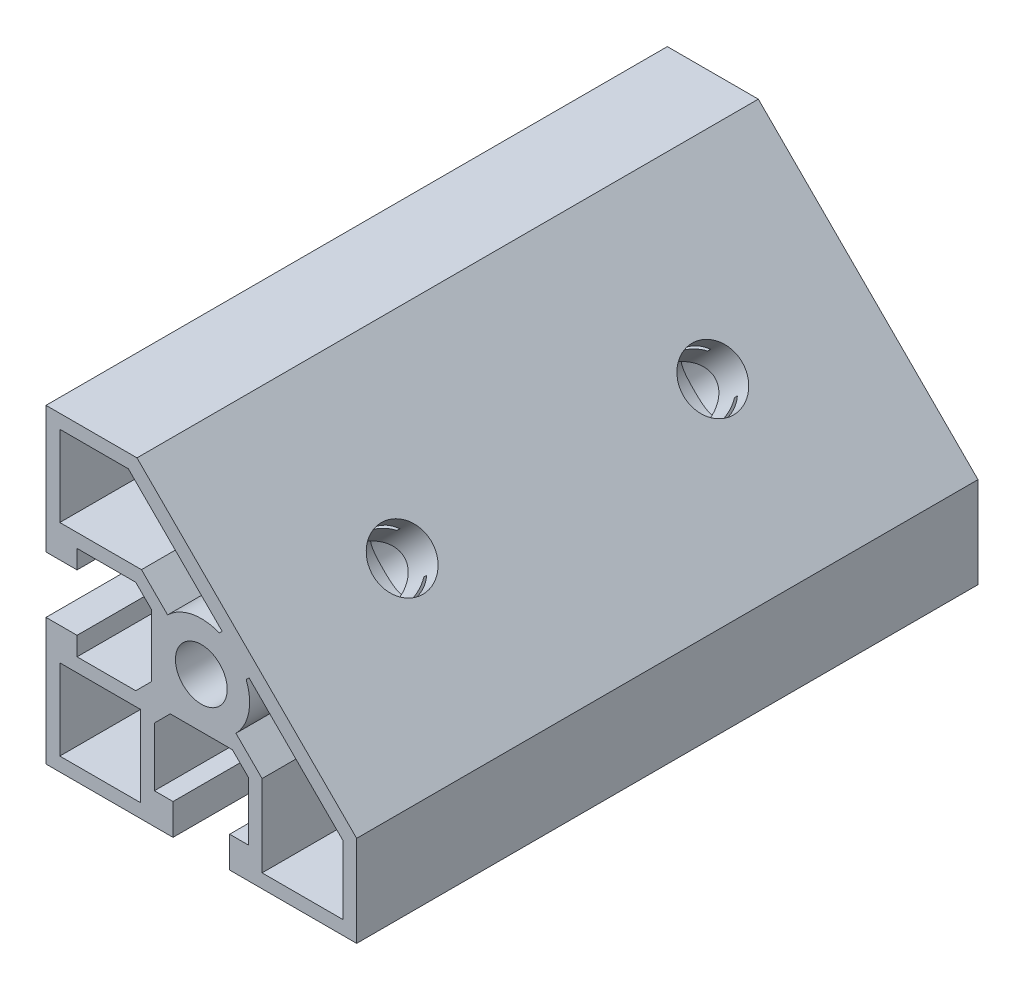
ISO-10303-21;
HEADER;
FILE_DESCRIPTION(('STEP AP214'),'2;1');
FILE_NAME('part.step','',(''),(''),'','','');
FILE_SCHEMA(('AUTOMOTIVE_DESIGN { 1 0 10303 214 1 1 1 1 }'));
ENDSEC;
DATA;
#1=APPLICATION_CONTEXT('core data for automotive mechanical design processes');
#2=APPLICATION_PROTOCOL_DEFINITION('international standard','automotive_design',2000,#1);
#3=PRODUCT_CONTEXT('',#1,'mechanical');
#4=PRODUCT('Part','Part','',(#3));
#5=PRODUCT_RELATED_PRODUCT_CATEGORY('part','',(#4));
#6=PRODUCT_DEFINITION_FORMATION('','',#4);
#7=PRODUCT_DEFINITION_CONTEXT('part definition',#1,'design');
#8=PRODUCT_DEFINITION('design','',#6,#7);
#9=PRODUCT_DEFINITION_SHAPE('','',#8);
#10=(LENGTH_UNIT() NAMED_UNIT(*) SI_UNIT(.MILLI.,.METRE.));
#11=(NAMED_UNIT(*) PLANE_ANGLE_UNIT() SI_UNIT($,.RADIAN.));
#12=(NAMED_UNIT(*) SI_UNIT($,.STERADIAN.) SOLID_ANGLE_UNIT());
#13=UNCERTAINTY_MEASURE_WITH_UNIT(LENGTH_MEASURE(1.E-05),#10,'distance_accuracy_value','');
#14=(GEOMETRIC_REPRESENTATION_CONTEXT(3) GLOBAL_UNCERTAINTY_ASSIGNED_CONTEXT((#13)) GLOBAL_UNIT_ASSIGNED_CONTEXT((#10,
#11,#12)) REPRESENTATION_CONTEXT('',''));
#15=CARTESIAN_POINT('',(0.,0.,0.));
#16=DIRECTION('',(0.,0.,1.));
#17=DIRECTION('',(1.,0.,0.));
#18=AXIS2_PLACEMENT_3D('',#15,#16,#17);
#19=CARTESIAN_POINT('',(-9.5009507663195,-6.8000677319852,0.));
#20=DIRECTION('',(-0.707106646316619,0.70710691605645,0.));
#21=DIRECTION('',(-0.70710691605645,-0.707106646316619,0.));
#22=AXIS2_PLACEMENT_3D('',#19,#20,#21);
#23=PLANE('',#22);
#24=DIRECTION('',(-0.707106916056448,-0.707106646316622,0.));
#25=VECTOR('',#24,1.);
#26=CARTESIAN_POINT('',(-0.770932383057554,1.92994732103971,16.2868990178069));
#27=LINE('',#26,#25);
#28=CARTESIAN_POINT('',(-9.50095076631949,-6.8000677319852,16.2868990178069));
#29=VERTEX_POINT('',#28);
#30=CARTESIAN_POINT('',(-7.20095032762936,-4.50006817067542,16.2868990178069));
#31=VERTEX_POINT('',#30);
#32=EDGE_CURVE('E976',#29,#31,#27,.F.);
#33=ORIENTED_EDGE('',*,*,#32,.T.);
#34=DIRECTION('',(0.,0.,1.));
#35=VECTOR('',#34,1.);
#36=CARTESIAN_POINT('',(-7.20095032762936,-4.50006817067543,0.));
#37=LINE('',#36,#35);
#38=CARTESIAN_POINT('',(-7.20095032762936,-4.50006817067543,-16.2868990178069));
#39=VERTEX_POINT('',#38);
#40=EDGE_CURVE('E894',#39,#31,#37,.T.);
#41=ORIENTED_EDGE('',*,*,#40,.F.);
#42=DIRECTION('',(-0.707106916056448,-0.707106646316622,0.));
#43=VECTOR('',#42,1.);
#44=CARTESIAN_POINT('',(-0.770932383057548,1.9299473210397,-16.2868990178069));
#45=LINE('',#44,#43);
#46=CARTESIAN_POINT('',(-9.50095076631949,-6.8000677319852,-16.2868990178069));
#47=VERTEX_POINT('',#46);
#48=EDGE_CURVE('E983',#39,#47,#45,.T.);
#49=ORIENTED_EDGE('',*,*,#48,.T.);
#50=DIRECTION('',(0.,0.,1.));
#51=VECTOR('',#50,1.);
#52=CARTESIAN_POINT('',(-9.5009507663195,-6.8000677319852,0.));
#53=LINE('',#52,#51);
#54=EDGE_CURVE('E775',#29,#47,#53,.F.);
#55=ORIENTED_EDGE('',*,*,#54,.F.);
#56=EDGE_LOOP('',(#33,#41,#49,#55));
#57=FACE_BOUND('',#56,.T.);
#58=ADVANCED_FACE('F15',(#57),#23,.T.);
#59=CARTESIAN_POINT('',(-4.49992530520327,-7.20107219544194,0.));
#60=DIRECTION('',(0.70710664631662,-0.707106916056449,0.));
#61=DIRECTION('',(0.707106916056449,0.70710664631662,0.));
#62=AXIS2_PLACEMENT_3D('',#59,#60,#61);
#63=PLANE('',#62);
#64=DIRECTION('',(-0.707106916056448,-0.707106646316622,0.));
#65=VECTOR('',#64,1.);
#66=CARTESIAN_POINT('',(1.93008162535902,-0.771067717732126,16.2869575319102));
#67=LINE('',#66,#65);
#68=CARTESIAN_POINT('',(-4.49992530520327,-7.20107219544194,16.2869575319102));
#69=VERTEX_POINT('',#68);
#70=CARTESIAN_POINT('',(-6.79992574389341,-9.50107175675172,16.2869575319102));
#71=VERTEX_POINT('',#70);
#72=EDGE_CURVE('E980',#69,#71,#67,.T.);
#73=ORIENTED_EDGE('',*,*,#72,.T.);
#74=DIRECTION('',(0.,0.,1.));
#75=VECTOR('',#74,1.);
#76=CARTESIAN_POINT('',(-6.79992574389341,-9.50107175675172,0.));
#77=LINE('',#76,#75);
#78=CARTESIAN_POINT('',(-6.79992574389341,-9.50107175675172,-16.2869575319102));
#79=VERTEX_POINT('',#78);
#80=EDGE_CURVE('E860',#79,#71,#77,.T.);
#81=ORIENTED_EDGE('',*,*,#80,.F.);
#82=DIRECTION('',(-0.707106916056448,-0.707106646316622,0.));
#83=VECTOR('',#82,1.);
#84=CARTESIAN_POINT('',(1.93008162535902,-0.771067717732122,-16.2869575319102));
#85=LINE('',#84,#83);
#86=CARTESIAN_POINT('',(-4.49992530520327,-7.20107219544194,-16.2869575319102));
#87=VERTEX_POINT('',#86);
#88=EDGE_CURVE('E509',#79,#87,#85,.F.);
#89=ORIENTED_EDGE('',*,*,#88,.T.);
#90=DIRECTION('',(0.,0.,1.));
#91=VECTOR('',#90,1.);
#92=CARTESIAN_POINT('',(-4.49992530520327,-7.20107219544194,0.));
#93=LINE('',#92,#91);
#94=EDGE_CURVE('E538',#69,#87,#93,.F.);
#95=ORIENTED_EDGE('',*,*,#94,.F.);
#96=EDGE_LOOP('',(#73,#81,#89,#95));
#97=FACE_BOUND('',#96,.T.);
#98=ADVANCED_FACE('F1232',(#97),#63,.T.);
#99=CARTESIAN_POINT('',(0.579507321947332,0.579507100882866,22.5));
#100=DIRECTION('',(-0.707106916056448,-0.707106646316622,0.));
#101=DIRECTION('',(0.707106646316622,-0.707106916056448,0.));
#102=AXIS2_PLACEMENT_3D('',#99,#100,#101);
#103=CYLINDRICAL_SURFACE('',#102,6.5);
#104=CARTESIAN_POINT('',(-22.5000730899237,-22.5000645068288,22.5));
#105=DIRECTION('',(-1.90734865E-07,-0.999999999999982,0.));
#106=DIRECTION('',(-0.999999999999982,1.90734865E-07,0.));
#107=AXIS2_PLACEMENT_3D('',#104,#105,#106);
#108=ELLIPSE('',#107,9.19238815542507,6.5);
#109=CARTESIAN_POINT('',(-22.5001056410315,-22.5000645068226,28.9999999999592));
#110=VERTEX_POINT('',#109);
#111=CARTESIAN_POINT('',(-22.5001056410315,-22.5000645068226,16.0000000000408));
#112=VERTEX_POINT('',#111);
#113=EDGE_CURVE('E869',#110,#112,#108,.F.);
#114=ORIENTED_EDGE('',*,*,#113,.F.);
#115=CARTESIAN_POINT('',(-22.5001056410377,-22.5000970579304,22.5));
#116=DIRECTION('',(-0.999999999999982,1.90734865E-07,0.));
#117=DIRECTION('',(-1.90734865E-07,-0.999999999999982,0.));
#118=AXIS2_PLACEMENT_3D('',#115,#116,#117);
#119=ELLIPSE('',#118,9.19238815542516,6.5);
#120=EDGE_CURVE('E881',#112,#110,#119,.F.);
#121=ORIENTED_EDGE('',*,*,#120,.F.);
#122=EDGE_LOOP('',(#114,#121));
#123=FACE_BOUND('',#122,.T.);
#124=CARTESIAN_POINT('',(-20.5001557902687,-20.5001479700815,22.5));
#125=DIRECTION('',(-0.999999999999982,1.90734864E-07,0.));
#126=DIRECTION('',(-1.90734864E-07,-0.999999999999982,0.));
#127=AXIS2_PLACEMENT_3D('',#124,#125,#126);
#128=ELLIPSE('',#127,9.19238815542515,6.5);
#129=CARTESIAN_POINT('',(-20.5001557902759,-20.5001856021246,16.0000000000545));
#130=VERTEX_POINT('',#129);
#131=CARTESIAN_POINT('',(-20.5001557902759,-20.5001856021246,28.9999999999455));
#132=VERTEX_POINT('',#131);
#133=EDGE_CURVE('E1183',#130,#132,#128,.F.);
#134=ORIENTED_EDGE('',*,*,#133,.T.);
#135=CARTESIAN_POINT('',(-20.500193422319,-20.5001856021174,22.5));
#136=DIRECTION('',(-1.90734864E-07,-0.999999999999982,0.));
#137=DIRECTION('',(-0.999999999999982,1.90734864E-07,0.));
#138=AXIS2_PLACEMENT_3D('',#135,#136,#137);
#139=ELLIPSE('',#138,9.19238815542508,6.5);
#140=EDGE_CURVE('E1191',#132,#130,#139,.F.);
#141=ORIENTED_EDGE('',*,*,#140,.T.);
#142=EDGE_LOOP('',(#134,#141));
#143=FACE_BOUND('',#142,.T.);
#144=ADVANCED_FACE('F1234',(#123,#143),#103,.F.);
#145=CARTESIAN_POINT('',(0.579507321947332,0.579507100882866,-22.5));
#146=DIRECTION('',(-0.707106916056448,-0.707106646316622,0.));
#147=DIRECTION('',(0.707106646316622,-0.707106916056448,0.));
#148=AXIS2_PLACEMENT_3D('',#145,#146,#147);
#149=CYLINDRICAL_SURFACE('',#148,6.5);
#150=CARTESIAN_POINT('',(-22.5000730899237,-22.5000645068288,-22.5));
#151=DIRECTION('',(-1.90734865E-07,-0.999999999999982,0.));
#152=DIRECTION('',(-0.999999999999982,1.90734865E-07,0.));
#153=AXIS2_PLACEMENT_3D('',#150,#151,#152);
#154=ELLIPSE('',#153,9.19238815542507,6.5);
#155=CARTESIAN_POINT('',(-22.5001056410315,-22.5000645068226,-16.0000000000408));
#156=VERTEX_POINT('',#155);
#157=CARTESIAN_POINT('',(-22.5001056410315,-22.5000645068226,-28.9999999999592));
#158=VERTEX_POINT('',#157);
#159=EDGE_CURVE('E878',#156,#158,#154,.F.);
#160=ORIENTED_EDGE('',*,*,#159,.F.);
#161=CARTESIAN_POINT('',(-22.5001056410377,-22.5000970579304,-22.5));
#162=DIRECTION('',(-0.999999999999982,1.90734865E-07,0.));
#163=DIRECTION('',(-1.90734865E-07,-0.999999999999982,0.));
#164=AXIS2_PLACEMENT_3D('',#161,#162,#163);
#165=ELLIPSE('',#164,9.19238815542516,6.5);
#166=EDGE_CURVE('E762',#158,#156,#165,.F.);
#167=ORIENTED_EDGE('',*,*,#166,.F.);
#168=EDGE_LOOP('',(#160,#167));
#169=FACE_BOUND('',#168,.T.);
#170=CARTESIAN_POINT('',(-20.5001557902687,-20.5001479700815,-22.5));
#171=DIRECTION('',(-0.999999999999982,1.90734864E-07,0.));
#172=DIRECTION('',(-1.90734864E-07,-0.999999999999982,0.));
#173=AXIS2_PLACEMENT_3D('',#170,#171,#172);
#174=ELLIPSE('',#173,9.19238815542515,6.5);
#175=CARTESIAN_POINT('',(-20.5001557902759,-20.5001856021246,-28.9999999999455));
#176=VERTEX_POINT('',#175);
#177=CARTESIAN_POINT('',(-20.5001557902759,-20.5001856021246,-16.0000000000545));
#178=VERTEX_POINT('',#177);
#179=EDGE_CURVE('E1178',#176,#178,#174,.F.);
#180=ORIENTED_EDGE('',*,*,#179,.T.);
#181=CARTESIAN_POINT('',(-20.500193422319,-20.5001856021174,-22.5));
#182=DIRECTION('',(-1.90734864E-07,-0.999999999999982,0.));
#183=DIRECTION('',(-0.999999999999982,1.90734864E-07,0.));
#184=AXIS2_PLACEMENT_3D('',#181,#182,#183);
#185=ELLIPSE('',#184,9.19238815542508,6.5);
#186=EDGE_CURVE('E1188',#178,#176,#185,.F.);
#187=ORIENTED_EDGE('',*,*,#186,.T.);
#188=EDGE_LOOP('',(#180,#187));
#189=FACE_BOUND('',#188,.T.);
#190=ADVANCED_FACE('F1240',(#169,#189),#149,.F.);
#191=CARTESIAN_POINT('',(6.49634780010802,2.60725884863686,0.));
#192=DIRECTION('',(-0.707106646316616,0.707106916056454,0.));
#193=DIRECTION('',(-0.707106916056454,-0.707106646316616,0.));
#194=AXIS2_PLACEMENT_3D('',#191,#192,#193);
#195=PLANE('',#194);
#196=DIRECTION('',(0.,0.,1.));
#197=VECTOR('',#196,1.);
#198=CARTESIAN_POINT('',(6.90811343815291,3.01902432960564,0.));
#199=LINE('',#198,#197);
#200=CARTESIAN_POINT('',(6.90811343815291,3.01902432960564,-19.25962960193));
#201=VERTEX_POINT('',#200);
#202=CARTESIAN_POINT('',(6.90811343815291,3.01902432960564,19.25962960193));
#203=VERTEX_POINT('',#202);
#204=EDGE_CURVE('E574',#201,#203,#199,.T.);
#205=ORIENTED_EDGE('',*,*,#204,.T.);
#206=DIRECTION('',(-0.707106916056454,-0.707106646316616,0.));
#207=VECTOR('',#206,1.);
#208=CARTESIAN_POINT('',(6.49634780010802,2.60725884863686,19.25962960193));
#209=LINE('',#208,#207);
#210=CARTESIAN_POINT('',(6.49634780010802,2.60725884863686,19.25962960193));
#211=VERTEX_POINT('',#210);
#212=EDGE_CURVE('E1004',#211,#203,#209,.F.);
#213=ORIENTED_EDGE('',*,*,#212,.F.);
#214=DIRECTION('',(0.,0.,1.));
#215=VECTOR('',#214,1.);
#216=CARTESIAN_POINT('',(6.49634780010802,2.60725884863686,0.));
#217=LINE('',#216,#215);
#218=CARTESIAN_POINT('',(6.49634780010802,2.60725884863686,-19.25962960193));
#219=VERTEX_POINT('',#218);
#220=EDGE_CURVE('E717',#219,#211,#217,.T.);
#221=ORIENTED_EDGE('',*,*,#220,.F.);
#222=DIRECTION('',(-0.707106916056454,-0.707106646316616,0.));
#223=VECTOR('',#222,1.);
#224=CARTESIAN_POINT('',(6.49634780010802,2.60725884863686,-19.25962960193));
#225=LINE('',#224,#223);
#226=EDGE_CURVE('E1002',#201,#219,#225,.T.);
#227=ORIENTED_EDGE('',*,*,#226,.F.);
#228=EDGE_LOOP('',(#205,#213,#221,#227));
#229=FACE_BOUND('',#228,.T.);
#230=ADVANCED_FACE('F1501',(#229),#195,.F.);
#231=CARTESIAN_POINT('',(6.49634780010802,2.60725884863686,0.));
#232=DIRECTION('',(-0.707106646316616,0.707106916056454,0.));
#233=DIRECTION('',(-0.707106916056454,-0.707106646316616,0.));
#234=AXIS2_PLACEMENT_3D('',#231,#232,#233);
#235=PLANE('',#234);
#236=DIRECTION('',(0.,0.,1.));
#237=VECTOR('',#236,1.);
#238=CARTESIAN_POINT('',(6.90811343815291,3.01902432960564,0.));
#239=LINE('',#238,#237);
#240=CARTESIAN_POINT('',(6.90811343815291,3.01902432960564,25.74037039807));
#241=VERTEX_POINT('',#240);
#242=CARTESIAN_POINT('',(6.90811343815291,3.01902432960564,45.));
#243=VERTEX_POINT('',#242);
#244=EDGE_CURVE('E1421',#241,#243,#239,.T.);
#245=ORIENTED_EDGE('',*,*,#244,.T.);
#246=DIRECTION('',(-0.707106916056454,-0.707106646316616,0.));
#247=VECTOR('',#246,1.);
#248=CARTESIAN_POINT('',(6.49634780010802,2.60725884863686,45.));
#249=LINE('',#248,#247);
#250=CARTESIAN_POINT('',(6.49634780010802,2.60725884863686,45.));
#251=VERTEX_POINT('',#250);
#252=EDGE_CURVE('E1000',#251,#243,#249,.F.);
#253=ORIENTED_EDGE('',*,*,#252,.F.);
#254=DIRECTION('',(0.,0.,1.));
#255=VECTOR('',#254,1.);
#256=CARTESIAN_POINT('',(6.49634780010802,2.60725884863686,0.));
#257=LINE('',#256,#255);
#258=CARTESIAN_POINT('',(6.49634780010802,2.60725884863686,25.74037039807));
#259=VERTEX_POINT('',#258);
#260=EDGE_CURVE('E1414',#259,#251,#257,.T.);
#261=ORIENTED_EDGE('',*,*,#260,.F.);
#262=DIRECTION('',(-0.707106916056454,-0.707106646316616,0.));
#263=VECTOR('',#262,1.);
#264=CARTESIAN_POINT('',(6.49634780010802,2.60725884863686,25.74037039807));
#265=LINE('',#264,#263);
#266=EDGE_CURVE('E741',#241,#259,#265,.T.);
#267=ORIENTED_EDGE('',*,*,#266,.F.);
#268=EDGE_LOOP('',(#245,#253,#261,#267));
#269=FACE_BOUND('',#268,.T.);
#270=ADVANCED_FACE('F1478',(#269),#235,.F.);
#271=CARTESIAN_POINT('',(6.49634780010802,2.60725884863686,0.));
#272=DIRECTION('',(-0.707106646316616,0.707106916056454,0.));
#273=DIRECTION('',(-0.707106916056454,-0.707106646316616,0.));
#274=AXIS2_PLACEMENT_3D('',#271,#272,#273);
#275=PLANE('',#274);
#276=DIRECTION('',(0.,0.,1.));
#277=VECTOR('',#276,1.);
#278=CARTESIAN_POINT('',(6.49634780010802,2.60725884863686,0.));
#279=LINE('',#278,#277);
#280=CARTESIAN_POINT('',(6.49634780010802,2.60725884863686,-45.));
#281=VERTEX_POINT('',#280);
#282=CARTESIAN_POINT('',(6.49634780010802,2.60725884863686,-25.74037039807));
#283=VERTEX_POINT('',#282);
#284=EDGE_CURVE('E599',#281,#283,#279,.T.);
#285=ORIENTED_EDGE('',*,*,#284,.F.);
#286=DIRECTION('',(-0.707106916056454,-0.707106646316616,0.));
#287=VECTOR('',#286,1.);
#288=CARTESIAN_POINT('',(6.49634780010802,2.60725884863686,-45.));
#289=LINE('',#288,#287);
#290=CARTESIAN_POINT('',(6.90811343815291,3.01902432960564,-45.));
#291=VERTEX_POINT('',#290);
#292=EDGE_CURVE('E738',#291,#281,#289,.T.);
#293=ORIENTED_EDGE('',*,*,#292,.F.);
#294=DIRECTION('',(0.,0.,1.));
#295=VECTOR('',#294,1.);
#296=CARTESIAN_POINT('',(6.90811343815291,3.01902432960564,0.));
#297=LINE('',#296,#295);
#298=CARTESIAN_POINT('',(6.90811343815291,3.01902432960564,-25.74037039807));
#299=VERTEX_POINT('',#298);
#300=EDGE_CURVE('E714',#291,#299,#297,.T.);
#301=ORIENTED_EDGE('',*,*,#300,.T.);
#302=DIRECTION('',(-0.707106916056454,-0.707106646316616,0.));
#303=VECTOR('',#302,1.);
#304=CARTESIAN_POINT('',(6.49634780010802,2.60725884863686,-25.74037039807));
#305=LINE('',#304,#303);
#306=EDGE_CURVE('E740',#283,#299,#305,.F.);
#307=ORIENTED_EDGE('',*,*,#306,.F.);
#308=EDGE_LOOP('',(#285,#293,#301,#307));
#309=FACE_BOUND('',#308,.T.);
#310=ADVANCED_FACE('F1494',(#309),#275,.F.);
#311=CARTESIAN_POINT('',(3.01902688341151,6.90811236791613,0.));
#312=DIRECTION('',(0.70710664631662,-0.707106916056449,0.));
#313=DIRECTION('',(0.707106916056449,0.70710664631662,0.));
#314=AXIS2_PLACEMENT_3D('',#311,#312,#313);
#315=PLANE('',#314);
#316=DIRECTION('',(0.,0.,1.));
#317=VECTOR('',#316,1.);
#318=CARTESIAN_POINT('',(3.0190268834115,6.90811236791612,0.));
#319=LINE('',#318,#317);
#320=CARTESIAN_POINT('',(3.01902688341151,6.90811236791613,-25.7403703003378));
#321=VERTEX_POINT('',#320);
#322=CARTESIAN_POINT('',(3.01902688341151,6.90811236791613,-45.));
#323=VERTEX_POINT('',#322);
#324=EDGE_CURVE('E586',#321,#323,#319,.F.);
#325=ORIENTED_EDGE('',*,*,#324,.T.);
#326=DIRECTION('',(0.707106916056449,0.70710664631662,0.));
#327=VECTOR('',#326,1.);
#328=CARTESIAN_POINT('',(3.01902688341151,6.90811236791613,-45.));
#329=LINE('',#328,#327);
#330=CARTESIAN_POINT('',(2.60726124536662,6.49634688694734,-45.));
#331=VERTEX_POINT('',#330);
#332=EDGE_CURVE('E579',#331,#323,#329,.T.);
#333=ORIENTED_EDGE('',*,*,#332,.F.);
#334=DIRECTION('',(0.,0.,1.));
#335=VECTOR('',#334,1.);
#336=CARTESIAN_POINT('',(2.60726124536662,6.49634688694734,0.));
#337=LINE('',#336,#335);
#338=CARTESIAN_POINT('',(2.60726124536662,6.49634688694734,-25.7403703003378));
#339=VERTEX_POINT('',#338);
#340=EDGE_CURVE('E595',#339,#331,#337,.F.);
#341=ORIENTED_EDGE('',*,*,#340,.F.);
#342=DIRECTION('',(0.707106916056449,0.70710664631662,0.));
#343=VECTOR('',#342,1.);
#344=CARTESIAN_POINT('',(3.01902688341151,6.90811236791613,-25.7403703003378));
#345=LINE('',#344,#343);
#346=EDGE_CURVE('E576',#321,#339,#345,.F.);
#347=ORIENTED_EDGE('',*,*,#346,.F.);
#348=EDGE_LOOP('',(#325,#333,#341,#347));
#349=FACE_BOUND('',#348,.T.);
#350=ADVANCED_FACE('F1577',(#349),#315,.F.);
#351=CARTESIAN_POINT('',(3.01902688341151,6.90811236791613,0.));
#352=DIRECTION('',(0.70710664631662,-0.707106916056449,0.));
#353=DIRECTION('',(0.707106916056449,0.70710664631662,0.));
#354=AXIS2_PLACEMENT_3D('',#351,#352,#353);
#355=PLANE('',#354);
#356=DIRECTION('',(0.,0.,1.));
#357=VECTOR('',#356,1.);
#358=CARTESIAN_POINT('',(2.60726124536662,6.49634688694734,0.));
#359=LINE('',#358,#357);
#360=CARTESIAN_POINT('',(2.60726124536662,6.49634688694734,45.));
#361=VERTEX_POINT('',#360);
#362=CARTESIAN_POINT('',(2.60726124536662,6.49634688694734,25.7403703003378));
#363=VERTEX_POINT('',#362);
#364=EDGE_CURVE('E594',#361,#363,#359,.F.);
#365=ORIENTED_EDGE('',*,*,#364,.F.);
#366=DIRECTION('',(0.707106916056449,0.70710664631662,0.));
#367=VECTOR('',#366,1.);
#368=CARTESIAN_POINT('',(3.01902688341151,6.90811236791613,45.));
#369=LINE('',#368,#367);
#370=CARTESIAN_POINT('',(3.0190268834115,6.90811236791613,45.));
#371=VERTEX_POINT('',#370);
#372=EDGE_CURVE('E578',#371,#361,#369,.F.);
#373=ORIENTED_EDGE('',*,*,#372,.F.);
#374=DIRECTION('',(0.,0.,1.));
#375=VECTOR('',#374,1.);
#376=CARTESIAN_POINT('',(3.0190268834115,6.90811236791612,0.));
#377=LINE('',#376,#375);
#378=CARTESIAN_POINT('',(3.0190268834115,6.90811236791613,25.7403703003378));
#379=VERTEX_POINT('',#378);
#380=EDGE_CURVE('E731',#371,#379,#377,.F.);
#381=ORIENTED_EDGE('',*,*,#380,.T.);
#382=DIRECTION('',(0.707106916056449,0.70710664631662,0.));
#383=VECTOR('',#382,1.);
#384=CARTESIAN_POINT('',(3.01902688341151,6.90811236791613,25.7403703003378));
#385=LINE('',#384,#383);
#386=EDGE_CURVE('E986',#363,#379,#385,.T.);
#387=ORIENTED_EDGE('',*,*,#386,.F.);
#388=EDGE_LOOP('',(#365,#373,#381,#387));
#389=FACE_BOUND('',#388,.T.);
#390=ADVANCED_FACE('F1580',(#389),#355,.F.);
#391=CARTESIAN_POINT('',(3.01902688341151,6.90811236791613,0.));
#392=DIRECTION('',(0.70710664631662,-0.707106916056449,0.));
#393=DIRECTION('',(0.707106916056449,0.70710664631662,0.));
#394=AXIS2_PLACEMENT_3D('',#391,#392,#393);
#395=PLANE('',#394);
#396=DIRECTION('',(0.,0.,1.));
#397=VECTOR('',#396,1.);
#398=CARTESIAN_POINT('',(2.60726124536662,6.49634688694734,0.));
#399=LINE('',#398,#397);
#400=CARTESIAN_POINT('',(2.60726124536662,6.49634688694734,19.2596296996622));
#401=VERTEX_POINT('',#400);
#402=CARTESIAN_POINT('',(2.60726124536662,6.49634688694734,-19.2596296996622));
#403=VERTEX_POINT('',#402);
#404=EDGE_CURVE('E590',#401,#403,#399,.F.);
#405=ORIENTED_EDGE('',*,*,#404,.F.);
#406=DIRECTION('',(0.707106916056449,0.70710664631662,0.));
#407=VECTOR('',#406,1.);
#408=CARTESIAN_POINT('',(3.01902688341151,6.90811236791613,19.2596296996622));
#409=LINE('',#408,#407);
#410=CARTESIAN_POINT('',(3.01902688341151,6.90811236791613,19.2596296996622));
#411=VERTEX_POINT('',#410);
#412=EDGE_CURVE('E745',#411,#401,#409,.F.);
#413=ORIENTED_EDGE('',*,*,#412,.F.);
#414=DIRECTION('',(0.,0.,1.));
#415=VECTOR('',#414,1.);
#416=CARTESIAN_POINT('',(3.0190268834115,6.90811236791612,0.));
#417=LINE('',#416,#415);
#418=CARTESIAN_POINT('',(3.01902688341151,6.90811236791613,-19.2596296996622));
#419=VERTEX_POINT('',#418);
#420=EDGE_CURVE('E733',#411,#419,#417,.F.);
#421=ORIENTED_EDGE('',*,*,#420,.T.);
#422=DIRECTION('',(0.707106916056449,0.70710664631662,0.));
#423=VECTOR('',#422,1.);
#424=CARTESIAN_POINT('',(3.01902688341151,6.90811236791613,-19.2596296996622));
#425=LINE('',#424,#423);
#426=EDGE_CURVE('E743',#403,#419,#425,.T.);
#427=ORIENTED_EDGE('',*,*,#426,.F.);
#428=EDGE_LOOP('',(#405,#413,#421,#427));
#429=FACE_BOUND('',#428,.T.);
#430=ADVANCED_FACE('F1523',(#429),#395,.F.);
#431=CARTESIAN_POINT('',(0.579507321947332,0.579507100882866,-22.5));
#432=DIRECTION('',(-0.707106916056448,-0.707106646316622,0.));
#433=DIRECTION('',(0.707106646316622,-0.707106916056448,0.));
#434=AXIS2_PLACEMENT_3D('',#431,#432,#433);
#435=CYLINDRICAL_SURFACE('',#434,6.5);
#436=CARTESIAN_POINT('',(0.579507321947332,0.579507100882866,-22.5));
#437=DIRECTION('',(-0.707106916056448,-0.707106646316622,0.));
#438=DIRECTION('',(0.707106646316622,-0.707106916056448,0.));
#439=AXIS2_PLACEMENT_3D('',#436,#437,#438);
#440=CIRCLE('',#439,6.5);
#441=CARTESIAN_POINT('',(-2.0080475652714,3.16706297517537,-17.1279320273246));
#442=VERTEX_POINT('',#441);
#443=CARTESIAN_POINT('',(-2.00804756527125,3.16706297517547,-27.8720679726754));
#444=VERTEX_POINT('',#443);
#445=EDGE_CURVE('E559',#442,#444,#440,.T.);
#446=ORIENTED_EDGE('',*,*,#445,.F.);
#447=CARTESIAN_POINT('',(-2.00804756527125,3.16706297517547,-17.1279320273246));
#448=CARTESIAN_POINT('',(-2.08263045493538,3.11979094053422,-17.1411013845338));
#449=CARTESIAN_POINT('',(-2.1557848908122,3.0696975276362,-17.152347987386));
#450=CARTESIAN_POINT('',(-2.2987027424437,2.96417829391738,-17.1707089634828));
#451=CARTESIAN_POINT('',(-2.36846560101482,2.90875160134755,-17.177822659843));
#452=CARTESIAN_POINT('',(-2.50372349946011,2.79316351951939,-17.1876036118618));
#453=CARTESIAN_POINT('',(-2.56923701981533,2.73302555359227,-17.1902915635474));
#454=CARTESIAN_POINT('',(-2.69582901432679,2.60823712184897,-17.1911918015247));
#455=CARTESIAN_POINT('',(-2.75690806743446,2.54358724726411,-17.1894046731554));
#456=CARTESIAN_POINT('',(-2.87426290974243,2.41018560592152,-17.1814145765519));
#457=CARTESIAN_POINT('',(-2.93053300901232,2.34142913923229,-17.1752064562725));
#458=CARTESIAN_POINT('',(-3.03784532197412,2.20041599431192,-17.1586037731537));
#459=CARTESIAN_POINT('',(-3.088885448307,2.12815793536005,-17.1482075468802));
#460=CARTESIAN_POINT('',(-3.23374419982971,1.90692436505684,-17.1112417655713));
#461=CARTESIAN_POINT('',(-3.31935388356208,1.75342923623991,-17.0788910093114));
#462=CARTESIAN_POINT('',(-3.46929272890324,1.43467954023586,-17.0017599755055));
#463=CARTESIAN_POINT('',(-3.53304225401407,1.26922787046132,-16.9566916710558));
#464=CARTESIAN_POINT('',(-3.63632467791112,0.933001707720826,-16.8590963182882));
#465=CARTESIAN_POINT('',(-3.6758398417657,0.762223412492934,-16.8065638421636));
#466=CARTESIAN_POINT('',(-3.73559607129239,0.387180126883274,-16.6888091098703));
#467=CARTESIAN_POINT('',(-3.75116709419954,0.182355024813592,-16.6229902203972));
#468=CARTESIAN_POINT('',(-3.74865704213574,-0.228025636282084,-16.4934998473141));
#469=CARTESIAN_POINT('',(-3.73055528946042,-0.433581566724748,-16.4298297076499));
#470=CARTESIAN_POINT('',(-3.67658281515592,-0.746593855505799,-16.3382741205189));
#471=CARTESIAN_POINT('',(-3.65282337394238,-0.855395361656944,-16.30747181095));
#472=CARTESIAN_POINT('',(-3.59544911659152,-1.07122707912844,-16.2490548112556));
#473=CARTESIAN_POINT('',(-3.56183864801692,-1.17825804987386,-16.2214387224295));
#474=CARTESIAN_POINT('',(-3.48480184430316,-1.38965034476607,-16.1702113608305));
#475=CARTESIAN_POINT('',(-3.44138093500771,-1.49401310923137,-16.1465978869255));
#476=CARTESIAN_POINT('',(-3.34484929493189,-1.69915899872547,-16.1040894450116));
#477=CARTESIAN_POINT('',(-3.29174013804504,-1.79994270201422,-16.0851937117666));
#478=CARTESIAN_POINT('',(-3.1820794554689,-1.98675046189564,-16.0544092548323));
#479=CARTESIAN_POINT('',(-3.12644309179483,-2.07322672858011,-16.0419998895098));
#480=CARTESIAN_POINT('',(-3.0079648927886,-2.24166293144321,-16.0218229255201));
#481=CARTESIAN_POINT('',(-2.94512397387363,-2.32362344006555,-16.0140547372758));
#482=CARTESIAN_POINT('',(-2.81275260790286,-2.48221497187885,-16.003387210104));
#483=CARTESIAN_POINT('',(-2.74322594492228,-2.55884896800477,-16.0004851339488));
#484=CARTESIAN_POINT('',(-2.59806253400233,-2.70611633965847,-15.9996268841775));
#485=CARTESIAN_POINT('',(-2.5224262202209,-2.77675014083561,-16.0016703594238));
#486=CARTESIAN_POINT('',(-2.37406992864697,-2.90424187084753,-16.0101657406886));
#487=CARTESIAN_POINT('',(-2.30189307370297,-2.96176617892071,-16.0161265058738));
#488=CARTESIAN_POINT('',(-2.1537598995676,-3.07117566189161,-16.031805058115));
#489=CARTESIAN_POINT('',(-2.07780234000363,-3.12305896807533,-16.0415240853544));
#490=CARTESIAN_POINT('',(-1.84514664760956,-3.26975176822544,-16.0760117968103));
#491=CARTESIAN_POINT('',(-1.68353338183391,-3.35571712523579,-16.1061192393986));
#492=CARTESIAN_POINT('',(-1.34801754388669,-3.50423875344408,-16.1788632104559));
#493=CARTESIAN_POINT('',(-1.17391557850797,-3.56619833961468,-16.2217771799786));
#494=CARTESIAN_POINT('',(-0.820794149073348,-3.663632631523,-16.3164114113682));
#495=CARTESIAN_POINT('',(-0.641773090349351,-3.69909864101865,-16.3681345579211));
#496=CARTESIAN_POINT('',(-0.260359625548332,-3.74643812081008,-16.483110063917));
#497=CARTESIAN_POINT('',(-0.0577431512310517,-3.75496553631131,-16.5470009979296));
#498=CARTESIAN_POINT('',(0.346238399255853,-3.7394484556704,-16.6753442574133));
#499=CARTESIAN_POINT('',(0.547601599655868,-3.71536332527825,-16.7397971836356));
#500=CARTESIAN_POINT('',(0.963826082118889,-3.63075618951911,-16.8684491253));
#501=CARTESIAN_POINT('',(1.17826320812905,-3.56713878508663,-16.9320990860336));
#502=CARTESIAN_POINT('',(1.49123209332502,-3.44257048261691,-17.0153351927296));
#503=CARTESIAN_POINT('',(1.59410740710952,-3.39619058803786,-17.0410407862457));
#504=CARTESIAN_POINT('',(1.79613981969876,-3.293800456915,-17.0872347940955));
#505=CARTESIAN_POINT('',(1.8952996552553,-3.23779748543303,-17.1077271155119));
#506=CARTESIAN_POINT('',(2.07920370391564,-3.12249144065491,-17.1407130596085));
#507=CARTESIAN_POINT('',(2.16439873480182,-3.06407611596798,-17.1538010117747));
#508=CARTESIAN_POINT('',(2.33005898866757,-2.94006723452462,-17.1742879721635));
#509=CARTESIAN_POINT('',(2.41052713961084,-2.87447819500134,-17.1816905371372));
#510=CARTESIAN_POINT('',(2.56584052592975,-2.73673527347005,-17.1904422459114));
#511=CARTESIAN_POINT('',(2.64069145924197,-2.66458821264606,-17.1917976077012));
#512=CARTESIAN_POINT('',(2.7840411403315,-2.51443606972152,-17.1884015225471));
#513=CARTESIAN_POINT('',(2.85254346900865,-2.43643433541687,-17.1836535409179));
#514=CARTESIAN_POINT('',(2.96262626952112,-2.3001131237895,-17.1706593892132));
#515=CARTESIAN_POINT('',(3.00601948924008,-2.24309529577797,-17.1639329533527));
#516=CARTESIAN_POINT('',(3.08922663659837,-2.12704193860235,-17.1478548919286));
#517=CARTESIAN_POINT('',(3.12904786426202,-2.06801088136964,-17.138508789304));
#518=CARTESIAN_POINT('',(3.16706212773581,-2.00804869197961,-17.1279319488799));
#519=B_SPLINE_CURVE_WITH_KNOTS('',3,(#447,#448,#449,#450,#451,#452,#453,#454,#455,#456,#457,
#458,#459,#460,#461,#462,#463,#464,#465,#466,#467,#468,#469,#470,#471,#472,#473,#474,#475,#476,
#477,#478,#479,#480,#481,#482,#483,#484,#485,#486,#487,#488,#489,#490,#491,#492,#493,#494,#495,
#496,#497,#498,#499,#500,#501,#502,#503,#504,#505,#506,#507,#508,#509,#510,#511,#512,#513,#514,
#515,#516,#517,#518),.UNSPECIFIED.,.F.,.F.,(4,2,2,2,2,2,2,2,2,2,2,2,2,2,2,2,2,2,2,2,2,2,2,2,2,2,
2,2,2,2,2,2,2,2,2,4),(0.,0.267785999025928,0.535615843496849,0.80218964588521,1.06872858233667,
1.33557864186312,1.60253479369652,2.13620974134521,2.6831036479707,3.23039730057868,
3.87489991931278,4.51979844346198,4.86603811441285,5.21212520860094,5.55802135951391,
5.90386136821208,6.21414812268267,6.52439545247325,6.83446820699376,7.14451894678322,
7.42164753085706,7.69886764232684,8.25279224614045,8.81971585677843,9.3868254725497,
10.0220631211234,10.6580929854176,11.3515869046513,11.6983349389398,12.0448223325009,
12.3567157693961,12.668413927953,12.9797915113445,13.290992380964,13.5067371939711,
13.7220305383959),.UNSPECIFIED.);
#520=CARTESIAN_POINT('',(3.16706212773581,-2.00804869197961,-17.1279319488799));
#521=VERTEX_POINT('',#520);
#522=EDGE_CURVE('E604',#442,#521,#519,.T.);
#523=ORIENTED_EDGE('',*,*,#522,.T.);
#524=CARTESIAN_POINT('',(0.579507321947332,0.579507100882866,-22.5));
#525=DIRECTION('',(-0.707106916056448,-0.707106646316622,0.));
#526=DIRECTION('',(0.707106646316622,-0.707106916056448,0.));
#527=AXIS2_PLACEMENT_3D('',#524,#525,#526);
#528=CIRCLE('',#527,6.5);
#529=CARTESIAN_POINT('',(3.16706212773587,-2.00804869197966,-27.87206805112));
#530=VERTEX_POINT('',#529);
#531=EDGE_CURVE('E558',#530,#521,#528,.T.);
#532=ORIENTED_EDGE('',*,*,#531,.F.);
#533=CARTESIAN_POINT('',(3.16706212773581,-2.00804869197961,-27.8720680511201));
#534=CARTESIAN_POINT('',(3.11979006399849,-2.08263156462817,-27.8588986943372));
#535=CARTESIAN_POINT('',(3.0696966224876,-2.15578598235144,-27.8476520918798));
#536=CARTESIAN_POINT('',(2.96417733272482,-2.29870379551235,-27.8292911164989));
#537=CARTESIAN_POINT('',(2.90875061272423,-2.36846663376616,-27.8221774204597));
#538=CARTESIAN_POINT('',(2.79316247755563,-2.50372448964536,-27.8123964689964));
#539=CARTESIAN_POINT('',(2.7330244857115,-2.56923798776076,-27.8097085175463));
#540=CARTESIAN_POINT('',(2.60823600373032,-2.69582993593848,-27.8088082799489));
#541=CARTESIAN_POINT('',(2.54358610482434,-2.75690896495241,-27.8105954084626));
#542=CARTESIAN_POINT('',(2.41018441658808,-2.87426375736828,-27.818585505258));
#543=CARTESIAN_POINT('',(2.34142792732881,-2.93053383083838,-27.8247936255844));
#544=CARTESIAN_POINT('',(2.20041473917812,-3.03784609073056,-27.8413963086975));
#545=CARTESIAN_POINT('',(2.12815665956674,-3.08888618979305,-27.8517925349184));
#546=CARTESIAN_POINT('',(1.90692303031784,-3.23374485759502,-27.8887583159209));
#547=CARTESIAN_POINT('',(1.7534278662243,-3.31935448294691,-27.9211090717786));
#548=CARTESIAN_POINT('',(1.43467810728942,-3.46929320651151,-27.9982401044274));
#549=CARTESIAN_POINT('',(1.2692264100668,-3.53304266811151,-28.0433084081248));
#550=CARTESIAN_POINT('',(0.933000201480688,-3.63632496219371,-28.1409037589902));
#551=CARTESIAN_POINT('',(0.762221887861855,-3.67584005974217,-28.1934362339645));
#552=CARTESIAN_POINT('',(0.387178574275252,-3.73559614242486,-28.3111909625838));
#553=CARTESIAN_POINT('',(0.182353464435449,-3.75116708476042,-28.3770098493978));
#554=CARTESIAN_POINT('',(-0.228027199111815,-3.74865687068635,-28.5065002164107));
#555=CARTESIAN_POINT('',(-0.433583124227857,-3.73055503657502,-28.5701703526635));
#556=CARTESIAN_POINT('',(-0.746595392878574,-3.67658243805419,-28.6617259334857));
#557=CARTESIAN_POINT('',(-0.855396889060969,-3.65282295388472,-28.6925282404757));
#558=CARTESIAN_POINT('',(-1.07122858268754,-3.59544861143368,-28.7509452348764));
#559=CARTESIAN_POINT('',(-1.17825953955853,-3.56183810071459,-28.7785613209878));
#560=CARTESIAN_POINT('',(-1.38965180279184,-3.48480121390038,-28.8297886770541));
#561=CARTESIAN_POINT('',(-1.49401454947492,-3.44138026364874,-28.8534021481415));
#562=CARTESIAN_POINT('',(-1.69916039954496,-3.3448485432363,-28.8959105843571));
#563=CARTESIAN_POINT('',(-1.79994408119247,-3.29173934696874,-28.9148063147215));
#564=CARTESIAN_POINT('',(-1.98675179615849,-3.18207859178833,-28.9455907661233));
#565=CARTESIAN_POINT('',(-2.07322803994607,-3.12644219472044,-28.9580001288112));
#566=CARTESIAN_POINT('',(-2.24166419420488,-3.0079639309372,-28.9781770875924));
#567=CARTESIAN_POINT('',(-2.32362467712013,-2.94512298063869,-28.9859452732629));
#568=CARTESIAN_POINT('',(-2.48221615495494,-2.81275155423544,-28.9966127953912));
#569=CARTESIAN_POINT('',(-2.55885012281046,-2.74322486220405,-28.9995148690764));
#570=CARTESIAN_POINT('',(-2.70611743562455,-2.59806139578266,-29.000373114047));
#571=CARTESIAN_POINT('',(-2.77675120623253,-2.52242505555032,-28.99832963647));
#572=CARTESIAN_POINT('',(-2.90424287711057,-2.37406871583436,-28.9898342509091));
#573=CARTESIAN_POINT('',(-2.96176715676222,-2.30189183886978,-28.983873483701));
#574=CARTESIAN_POINT('',(-3.07117658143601,-2.15375862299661,-28.9681949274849));
#575=CARTESIAN_POINT('',(-3.12305985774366,-2.07780104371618,-28.9584758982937));
#576=CARTESIAN_POINT('',(-3.26975256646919,-1.84514529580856,-28.9239881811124));
#577=CARTESIAN_POINT('',(-3.35571786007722,-1.6835319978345,-28.8938807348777));
#578=CARTESIAN_POINT('',(-3.50423935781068,-1.34801610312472,-28.821136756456));
#579=CARTESIAN_POINT('',(-3.56619887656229,-1.17391411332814,-28.7782227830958));
#580=CARTESIAN_POINT('',(-3.66363303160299,-0.820792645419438,-28.6835885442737));
#581=CARTESIAN_POINT('',(-3.69909897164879,-0.64177157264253,-28.6318653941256));
#582=CARTESIAN_POINT('',(-3.74643830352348,-0.260358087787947,-28.5168898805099));
#583=CARTESIAN_POINT('',(-3.7549656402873,-0.0577416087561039,-28.4529989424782));
#584=CARTESIAN_POINT('',(-3.73944840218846,0.346239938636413,-28.3246556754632));
#585=CARTESIAN_POINT('',(-3.7153631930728,0.547603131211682,-28.2602027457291));
#586=CARTESIAN_POINT('',(-3.63075589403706,0.963827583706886,-28.1315507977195));
#587=CARTESIAN_POINT('',(-3.56713840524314,1.17826468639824,-28.0679008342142));
#588=CARTESIAN_POINT('',(-3.44256997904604,1.49123352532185,-27.9846647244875));
#589=CARTESIAN_POINT('',(-3.39619004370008,1.59410882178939,-27.958959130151));
#590=CARTESIAN_POINT('',(-3.2937998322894,1.79614119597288,-27.9127651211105));
#591=CARTESIAN_POINT('',(-3.23779682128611,1.89530101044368,-27.8922727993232));
#592=CARTESIAN_POINT('',(-3.12249070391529,2.07920501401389,-27.8592868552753));
#593=CARTESIAN_POINT('',(-3.0640753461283,2.16440002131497,-27.8461989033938));
#594=CARTESIAN_POINT('',(-2.9400664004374,2.33006022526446,-27.8257119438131));
#595=CARTESIAN_POINT('',(-2.87447732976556,2.41052834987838,-27.8183093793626));
#596=CARTESIAN_POINT('',(-2.73673434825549,2.56584168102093,-27.809557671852));
#597=CARTESIAN_POINT('',(-2.66458725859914,2.64069258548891,-27.8082023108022));
#598=CARTESIAN_POINT('',(-2.51443506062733,2.78404220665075,-27.8115983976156));
#599=CARTESIAN_POINT('',(-2.43643330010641,2.85254450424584,-27.816346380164));
#600=CARTESIAN_POINT('',(-2.30011205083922,2.96262724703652,-27.8293405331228));
#601=CARTESIAN_POINT('',(-2.24309421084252,3.00602044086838,-27.8360669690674));
#602=CARTESIAN_POINT('',(-2.12704083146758,3.08922753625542,-27.8521450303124));
#603=CARTESIAN_POINT('',(-2.06800976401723,3.12904873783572,-27.8614911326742));
#604=CARTESIAN_POINT('',(-2.00804756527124,3.16706297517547,-27.8720679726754));
#605=B_SPLINE_CURVE_WITH_KNOTS('',3,(#533,#534,#535,#536,#537,#538,#539,#540,#541,#542,#543,
#544,#545,#546,#547,#548,#549,#550,#551,#552,#553,#554,#555,#556,#557,#558,#559,#560,#561,#562,
#563,#564,#565,#566,#567,#568,#569,#570,#571,#572,#573,#574,#575,#576,#577,#578,#579,#580,#581,
#582,#583,#584,#585,#586,#587,#588,#589,#590,#591,#592,#593,#594,#595,#596,#597,#598,#599,#600,
#601,#602,#603,#604),.UNSPECIFIED.,.F.,.F.,(4,2,2,2,2,2,2,2,2,2,2,2,2,2,2,2,2,2,2,2,2,2,2,2,2,2,
2,2,2,2,2,2,2,2,2,4),(0.,0.267786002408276,0.535615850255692,0.802189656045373,1.06872859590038,
1.33557865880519,1.60253481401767,2.13620976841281,2.68310368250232,3.23039734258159,
3.87489996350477,4.51979848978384,4.86603815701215,5.21212524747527,5.5580213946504,
5.90386139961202,6.21414814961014,6.52439547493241,6.83446822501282,7.14451896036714,
7.42164754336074,7.69886765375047,8.25279225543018,8.8197158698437,9.38682548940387,
10.0220631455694,10.6580930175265,11.3515869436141,11.698334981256,12.0448223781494,
12.3567158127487,12.6684139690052,12.9797915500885,13.2909924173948,13.5067372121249,
13.7220305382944),.UNSPECIFIED.);
#606=EDGE_CURVE('E567',#530,#444,#605,.T.);
#607=ORIENTED_EDGE('',*,*,#606,.T.);
#608=EDGE_LOOP('',(#446,#523,#532,#607));
#609=FACE_BOUND('',#608,.T.);
#610=DIRECTION('',(-0.70710691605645,-0.707106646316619,0.));
#611=VECTOR('',#610,1.);
#612=CARTESIAN_POINT('',(-9.5009507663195,-6.8000677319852,-28.7131009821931));
#613=LINE('',#612,#611);
#614=CARTESIAN_POINT('',(-9.5009507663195,-6.8000677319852,-28.7131009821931));
#615=VERTEX_POINT('',#614);
#616=CARTESIAN_POINT('',(-7.20095032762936,-4.50006817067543,-28.7131009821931));
#617=VERTEX_POINT('',#616);
#618=EDGE_CURVE('E827',#615,#617,#613,.F.);
#619=ORIENTED_EDGE('',*,*,#618,.F.);
#620=CARTESIAN_POINT('',(-6.80007084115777,-6.80006824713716,-22.5));
#621=DIRECTION('',(1.90734862E-07,0.999999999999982,0.));
#622=DIRECTION('',(-0.999999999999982,1.90734862E-07,0.));
#623=AXIS2_PLACEMENT_3D('',#620,#621,#622);
#624=ELLIPSE('',#623,9.1923881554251,6.5);
#625=EDGE_CURVE('E807',#47,#615,#624,.F.);
#626=ORIENTED_EDGE('',*,*,#625,.F.);
#627=ORIENTED_EDGE('',*,*,#48,.F.);
#628=CARTESIAN_POINT('',(-7.20095084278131,-7.20094809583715,-22.5));
#629=DIRECTION('',(-0.999999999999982,1.90734862E-07,0.));
#630=DIRECTION('',(-1.90734862E-07,-0.999999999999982,0.));
#631=AXIS2_PLACEMENT_3D('',#628,#629,#630);
#632=ELLIPSE('',#631,9.19238815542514,6.5);
#633=EDGE_CURVE('E898',#617,#39,#632,.F.);
#634=ORIENTED_EDGE('',*,*,#633,.F.);
#635=EDGE_LOOP('',(#619,#626,#627,#634));
#636=FACE_BOUND('',#635,.T.);
#637=DIRECTION('',(0.707106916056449,0.70710664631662,0.));
#638=VECTOR('',#637,1.);
#639=CARTESIAN_POINT('',(-4.49992530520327,-7.20107219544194,-28.7130424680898));
#640=LINE('',#639,#638);
#641=CARTESIAN_POINT('',(-4.49992530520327,-7.20107219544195,-28.7130424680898));
#642=VERTEX_POINT('',#641);
#643=CARTESIAN_POINT('',(-6.79992574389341,-9.50107175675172,-28.7130424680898));
#644=VERTEX_POINT('',#643);
#645=EDGE_CURVE('E514',#642,#644,#640,.F.);
#646=ORIENTED_EDGE('',*,*,#645,.F.);
#647=CARTESIAN_POINT('',(-7.20107442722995,-7.20107168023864,-22.5));
#648=DIRECTION('',(-1.90734863E-07,-0.999999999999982,0.));
#649=DIRECTION('',(-0.999999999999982,1.90734863E-07,0.));
#650=AXIS2_PLACEMENT_3D('',#647,#648,#649);
#651=ELLIPSE('',#650,9.19238815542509,6.5);
#652=EDGE_CURVE('E18',#87,#642,#651,.F.);
#653=ORIENTED_EDGE('',*,*,#652,.F.);
#654=ORIENTED_EDGE('',*,*,#88,.F.);
#655=CARTESIAN_POINT('',(-6.7999252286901,-6.79992263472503,-22.5));
#656=DIRECTION('',(0.999999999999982,-1.90734863E-07,0.));
#657=DIRECTION('',(-1.90734863E-07,-0.999999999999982,0.));
#658=AXIS2_PLACEMENT_3D('',#655,#656,#657);
#659=ELLIPSE('',#658,9.19238815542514,6.5);
#660=EDGE_CURVE('E521',#644,#79,#659,.F.);
#661=ORIENTED_EDGE('',*,*,#660,.F.);
#662=EDGE_LOOP('',(#646,#653,#654,#661));
#663=FACE_BOUND('',#662,.T.);
#664=CARTESIAN_POINT('',(-8.80019424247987,-8.80019088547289,-22.5));
#665=DIRECTION('',(1.90734874E-07,0.999999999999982,0.));
#666=DIRECTION('',(-0.999999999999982,1.90734874E-07,0.));
#667=AXIS2_PLACEMENT_3D('',#664,#665,#666);
#668=ELLIPSE('',#667,9.19238815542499,6.5);
#669=CARTESIAN_POINT('',(-8.80017186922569,-8.80019088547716,-16.0000000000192));
#670=VERTEX_POINT('',#669);
#671=CARTESIAN_POINT('',(-8.80017186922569,-8.80019088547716,-28.9999999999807));
#672=VERTEX_POINT('',#671);
#673=EDGE_CURVE('E765',#670,#672,#668,.F.);
#674=ORIENTED_EDGE('',*,*,#673,.T.);
#675=CARTESIAN_POINT('',(-8.80017186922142,-8.80016851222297,-22.5));
#676=DIRECTION('',(0.999999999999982,-1.90734879E-07,0.));
#677=DIRECTION('',(-1.90734879E-07,-0.999999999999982,0.));
#678=AXIS2_PLACEMENT_3D('',#675,#676,#677);
#679=ELLIPSE('',#678,9.19238815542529,6.5);
#680=EDGE_CURVE('E797',#672,#670,#679,.F.);
#681=ORIENTED_EDGE('',*,*,#680,.T.);
#682=EDGE_LOOP('',(#674,#681));
#683=FACE_BOUND('',#682,.T.);
#684=ADVANCED_FACE('F516',(#609,#636,#663,#683),#435,.F.);
#685=CARTESIAN_POINT('',(0.579507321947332,0.579507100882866,22.5));
#686=DIRECTION('',(-0.707106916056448,-0.707106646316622,0.));
#687=DIRECTION('',(0.707106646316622,-0.707106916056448,0.));
#688=AXIS2_PLACEMENT_3D('',#685,#686,#687);
#689=CYLINDRICAL_SURFACE('',#688,6.5);
#690=CARTESIAN_POINT('',(0.579507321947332,0.579507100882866,22.5));
#691=DIRECTION('',(-0.707106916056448,-0.707106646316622,0.));
#692=DIRECTION('',(0.707106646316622,-0.707106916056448,0.));
#693=AXIS2_PLACEMENT_3D('',#690,#691,#692);
#694=CIRCLE('',#693,6.5);
#695=CARTESIAN_POINT('',(-2.0080475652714,3.16706297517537,27.8720679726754));
#696=VERTEX_POINT('',#695);
#697=CARTESIAN_POINT('',(-2.00804756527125,3.16706297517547,17.1279320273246));
#698=VERTEX_POINT('',#697);
#699=EDGE_CURVE('E1098',#696,#698,#694,.T.);
#700=ORIENTED_EDGE('',*,*,#699,.F.);
#701=CARTESIAN_POINT('',(-2.00804756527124,3.16706297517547,27.8720679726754));
#702=CARTESIAN_POINT('',(-2.08263045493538,3.11979094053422,27.8588986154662));
#703=CARTESIAN_POINT('',(-2.1557848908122,3.06969752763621,27.847652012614));
#704=CARTESIAN_POINT('',(-2.2987027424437,2.96417829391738,27.8292910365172));
#705=CARTESIAN_POINT('',(-2.36846560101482,2.90875160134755,27.822177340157));
#706=CARTESIAN_POINT('',(-2.50372349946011,2.79316351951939,27.8123963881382));
#707=CARTESIAN_POINT('',(-2.56923701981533,2.73302555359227,27.8097084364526));
#708=CARTESIAN_POINT('',(-2.69582901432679,2.60823712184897,27.8088081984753));
#709=CARTESIAN_POINT('',(-2.75690806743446,2.54358724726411,27.8105953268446));
#710=CARTESIAN_POINT('',(-2.87426290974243,2.41018560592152,27.8185854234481));
#711=CARTESIAN_POINT('',(-2.93053300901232,2.34142913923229,27.8247935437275));
#712=CARTESIAN_POINT('',(-3.03784532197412,2.20041599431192,27.8413962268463));
#713=CARTESIAN_POINT('',(-3.088885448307,2.12815793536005,27.8517924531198));
#714=CARTESIAN_POINT('',(-3.23374419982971,1.90692436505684,27.8887582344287));
#715=CARTESIAN_POINT('',(-3.31935388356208,1.75342923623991,27.9211089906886));
#716=CARTESIAN_POINT('',(-3.46929272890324,1.43467954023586,27.9982400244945));
#717=CARTESIAN_POINT('',(-3.53304225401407,1.26922787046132,28.0433083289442));
#718=CARTESIAN_POINT('',(-3.63632467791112,0.933001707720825,28.1409036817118));
#719=CARTESIAN_POINT('',(-3.6758398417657,0.762223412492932,28.1934361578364));
#720=CARTESIAN_POINT('',(-3.73559607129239,0.387180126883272,28.3111908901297));
#721=CARTESIAN_POINT('',(-3.75116709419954,0.182355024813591,28.3770097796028));
#722=CARTESIAN_POINT('',(-3.74865704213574,-0.228025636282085,28.5065001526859));
#723=CARTESIAN_POINT('',(-3.73055528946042,-0.433581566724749,28.5701702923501));
#724=CARTESIAN_POINT('',(-3.67658281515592,-0.746593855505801,28.6617258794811));
#725=CARTESIAN_POINT('',(-3.65282337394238,-0.855395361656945,28.69252818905));
#726=CARTESIAN_POINT('',(-3.59544911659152,-1.07122707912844,28.7509451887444));
#727=CARTESIAN_POINT('',(-3.56183864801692,-1.17825804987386,28.7785612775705));
#728=CARTESIAN_POINT('',(-3.48480184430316,-1.38965034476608,28.8297886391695));
#729=CARTESIAN_POINT('',(-3.44138093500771,-1.49401310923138,28.8534021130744));
#730=CARTESIAN_POINT('',(-3.34484929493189,-1.69915899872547,28.8959105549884));
#731=CARTESIAN_POINT('',(-3.29174013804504,-1.79994270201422,28.9148062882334));
#732=CARTESIAN_POINT('',(-3.1820794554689,-1.98675046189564,28.9455907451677));
#733=CARTESIAN_POINT('',(-3.12644309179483,-2.07322672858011,28.9580001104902));
#734=CARTESIAN_POINT('',(-3.0079648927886,-2.24166293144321,28.9781770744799));
#735=CARTESIAN_POINT('',(-2.94512397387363,-2.32362344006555,28.9859452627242));
#736=CARTESIAN_POINT('',(-2.81275260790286,-2.48221497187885,28.996612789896));
#737=CARTESIAN_POINT('',(-2.74322594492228,-2.55884896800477,28.9995148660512));
#738=CARTESIAN_POINT('',(-2.59806253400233,-2.70611633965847,29.0003731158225));
#739=CARTESIAN_POINT('',(-2.5224262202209,-2.77675014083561,28.9983296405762));
#740=CARTESIAN_POINT('',(-2.37406992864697,-2.90424187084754,28.9898342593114));
#741=CARTESIAN_POINT('',(-2.30189307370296,-2.96176617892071,28.9838734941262));
#742=CARTESIAN_POINT('',(-2.15375989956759,-3.07117566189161,28.968194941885));
#743=CARTESIAN_POINT('',(-2.07780234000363,-3.12305896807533,28.9584759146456));
#744=CARTESIAN_POINT('',(-1.84514664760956,-3.26975176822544,28.9239882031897));
#745=CARTESIAN_POINT('',(-1.68353338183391,-3.35571712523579,28.8938807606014));
#746=CARTESIAN_POINT('',(-1.34801754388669,-3.50423875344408,28.8211367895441));
#747=CARTESIAN_POINT('',(-1.17391557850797,-3.56619833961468,28.7782228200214));
#748=CARTESIAN_POINT('',(-0.820794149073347,-3.663632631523,28.6835885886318));
#749=CARTESIAN_POINT('',(-0.641773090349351,-3.69909864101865,28.6318654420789));
#750=CARTESIAN_POINT('',(-0.260359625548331,-3.74643812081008,28.516889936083));
#751=CARTESIAN_POINT('',(-0.0577431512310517,-3.75496553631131,28.4529990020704));
#752=CARTESIAN_POINT('',(0.346238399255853,-3.7394484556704,28.3246557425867));
#753=CARTESIAN_POINT('',(0.547601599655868,-3.71536332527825,28.2602028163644));
#754=CARTESIAN_POINT('',(0.963826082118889,-3.63075618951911,28.1315508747));
#755=CARTESIAN_POINT('',(1.17826320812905,-3.56713878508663,28.0679009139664));
#756=CARTESIAN_POINT('',(1.49123209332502,-3.44257048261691,27.9846648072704));
#757=CARTESIAN_POINT('',(1.59410740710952,-3.39619058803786,27.9589592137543));
#758=CARTESIAN_POINT('',(1.79613981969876,-3.293800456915,27.9127652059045));
#759=CARTESIAN_POINT('',(1.8952996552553,-3.23779748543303,27.8922728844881));
#760=CARTESIAN_POINT('',(2.07920370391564,-3.12249144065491,27.8592869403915));
#761=CARTESIAN_POINT('',(2.16439873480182,-3.06407611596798,27.8461989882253));
#762=CARTESIAN_POINT('',(2.33005898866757,-2.94006723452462,27.8257120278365));
#763=CARTESIAN_POINT('',(2.41052713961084,-2.87447819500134,27.8183094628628));
#764=CARTESIAN_POINT('',(2.56584052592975,-2.73673527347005,27.8095577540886));
#765=CARTESIAN_POINT('',(2.64069145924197,-2.66458821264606,27.8082023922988));
#766=CARTESIAN_POINT('',(2.7840411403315,-2.51443606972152,27.8115984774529));
#767=CARTESIAN_POINT('',(2.85254346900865,-2.43643433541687,27.8163464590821));
#768=CARTESIAN_POINT('',(2.96262626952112,-2.3001131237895,27.8293406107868));
#769=CARTESIAN_POINT('',(3.00601948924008,-2.24309529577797,27.8360670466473));
#770=CARTESIAN_POINT('',(3.08922663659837,-2.12704193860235,27.8521451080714));
#771=CARTESIAN_POINT('',(3.12904786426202,-2.06801088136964,27.861491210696));
#772=CARTESIAN_POINT('',(3.16706212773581,-2.00804869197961,27.8720680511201));
#773=B_SPLINE_CURVE_WITH_KNOTS('',3,(#701,#702,#703,#704,#705,#706,#707,#708,#709,#710,#711,
#712,#713,#714,#715,#716,#717,#718,#719,#720,#721,#722,#723,#724,#725,#726,#727,#728,#729,#730,
#731,#732,#733,#734,#735,#736,#737,#738,#739,#740,#741,#742,#743,#744,#745,#746,#747,#748,#749,
#750,#751,#752,#753,#754,#755,#756,#757,#758,#759,#760,#761,#762,#763,#764,#765,#766,#767,#768,
#769,#770,#771,#772),.UNSPECIFIED.,.F.,.F.,(4,2,2,2,2,2,2,2,2,2,2,2,2,2,2,2,2,2,2,2,2,2,2,2,2,2,
2,2,2,2,2,2,2,2,2,4),(0.,0.267785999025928,0.53561584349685,0.802189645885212,1.06872858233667,
1.33557864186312,1.60253479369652,2.13620974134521,2.6831036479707,3.23039730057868,
3.87489991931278,4.51979844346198,4.86603811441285,5.21212520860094,5.55802135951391,
5.90386136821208,6.21414812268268,6.52439545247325,6.83446820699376,7.14451894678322,
7.42164753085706,7.69886764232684,8.25279224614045,8.81971585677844,9.3868254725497,
10.0220631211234,10.6580929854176,11.3515869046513,11.6983349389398,12.0448223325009,
12.3567157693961,12.668413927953,12.9797915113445,13.290992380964,13.5067371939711,
13.7220305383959),.UNSPECIFIED.);
#774=CARTESIAN_POINT('',(3.16706212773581,-2.00804869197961,27.8720680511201));
#775=VERTEX_POINT('',#774);
#776=EDGE_CURVE('E1114',#696,#775,#773,.T.);
#777=ORIENTED_EDGE('',*,*,#776,.T.);
#778=CARTESIAN_POINT('',(0.579507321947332,0.579507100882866,22.5));
#779=DIRECTION('',(-0.707106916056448,-0.707106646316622,0.));
#780=DIRECTION('',(0.707106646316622,-0.707106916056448,0.));
#781=AXIS2_PLACEMENT_3D('',#778,#779,#780);
#782=CIRCLE('',#781,6.5);
#783=CARTESIAN_POINT('',(3.16706212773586,-2.00804869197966,17.12793194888));
#784=VERTEX_POINT('',#783);
#785=EDGE_CURVE('E1121',#784,#775,#782,.T.);
#786=ORIENTED_EDGE('',*,*,#785,.F.);
#787=CARTESIAN_POINT('',(3.16706212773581,-2.00804869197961,17.1279319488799));
#788=CARTESIAN_POINT('',(3.11979006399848,-2.08263156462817,17.1411013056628));
#789=CARTESIAN_POINT('',(3.0696966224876,-2.15578598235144,17.1523479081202));
#790=CARTESIAN_POINT('',(2.96417733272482,-2.29870379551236,17.1707088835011));
#791=CARTESIAN_POINT('',(2.90875061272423,-2.36846663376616,17.1778225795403));
#792=CARTESIAN_POINT('',(2.79316247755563,-2.50372448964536,17.1876035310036));
#793=CARTESIAN_POINT('',(2.7330244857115,-2.56923798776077,17.1902914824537));
#794=CARTESIAN_POINT('',(2.60823600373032,-2.69582993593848,17.1911917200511));
#795=CARTESIAN_POINT('',(2.54358610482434,-2.75690896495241,17.1894045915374));
#796=CARTESIAN_POINT('',(2.41018441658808,-2.87426375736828,17.181414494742));
#797=CARTESIAN_POINT('',(2.3414279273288,-2.93053383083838,17.1752063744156));
#798=CARTESIAN_POINT('',(2.20041473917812,-3.03784609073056,17.1586036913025));
#799=CARTESIAN_POINT('',(2.12815665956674,-3.08888618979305,17.1482074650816));
#800=CARTESIAN_POINT('',(1.90692303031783,-3.23374485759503,17.1112416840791));
#801=CARTESIAN_POINT('',(1.7534278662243,-3.31935448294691,17.0788909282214));
#802=CARTESIAN_POINT('',(1.43467810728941,-3.46929320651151,17.0017598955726));
#803=CARTESIAN_POINT('',(1.2692264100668,-3.53304266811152,16.9566915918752));
#804=CARTESIAN_POINT('',(0.933000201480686,-3.63632496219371,16.8590962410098));
#805=CARTESIAN_POINT('',(0.762221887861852,-3.67584005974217,16.8065637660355));
#806=CARTESIAN_POINT('',(0.387178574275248,-3.73559614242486,16.6888090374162));
#807=CARTESIAN_POINT('',(0.182353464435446,-3.75116708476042,16.6229901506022));
#808=CARTESIAN_POINT('',(-0.228027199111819,-3.74865687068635,16.4934997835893));
#809=CARTESIAN_POINT('',(-0.433583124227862,-3.73055503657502,16.4298296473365));
#810=CARTESIAN_POINT('',(-0.746595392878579,-3.67658243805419,16.3382740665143));
#811=CARTESIAN_POINT('',(-0.855396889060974,-3.65282295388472,16.3074717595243));
#812=CARTESIAN_POINT('',(-1.07122858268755,-3.59544861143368,16.2490547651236));
#813=CARTESIAN_POINT('',(-1.17825953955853,-3.56183810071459,16.2214386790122));
#814=CARTESIAN_POINT('',(-1.38965180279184,-3.48480121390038,16.1702113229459));
#815=CARTESIAN_POINT('',(-1.49401454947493,-3.44138026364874,16.1465978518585));
#816=CARTESIAN_POINT('',(-1.69916039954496,-3.3448485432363,16.1040894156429));
#817=CARTESIAN_POINT('',(-1.79994408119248,-3.29173934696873,16.0851936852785));
#818=CARTESIAN_POINT('',(-1.98675179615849,-3.18207859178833,16.0544092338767));
#819=CARTESIAN_POINT('',(-2.07322803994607,-3.12644219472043,16.0419998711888));
#820=CARTESIAN_POINT('',(-2.24166419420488,-3.0079639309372,16.0218229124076));
#821=CARTESIAN_POINT('',(-2.32362467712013,-2.94512298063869,16.0140547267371));
#822=CARTESIAN_POINT('',(-2.48221615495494,-2.81275155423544,16.0033872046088));
#823=CARTESIAN_POINT('',(-2.55885012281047,-2.74322486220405,16.0004851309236));
#824=CARTESIAN_POINT('',(-2.70611743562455,-2.59806139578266,15.999626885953));
#825=CARTESIAN_POINT('',(-2.77675120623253,-2.52242505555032,16.00167036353));
#826=CARTESIAN_POINT('',(-2.90424287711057,-2.37406871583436,16.0101657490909));
#827=CARTESIAN_POINT('',(-2.96176715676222,-2.30189183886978,16.016126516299));
#828=CARTESIAN_POINT('',(-3.07117658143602,-2.15375862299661,16.0318050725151));
#829=CARTESIAN_POINT('',(-3.12305985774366,-2.07780104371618,16.0415241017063));
#830=CARTESIAN_POINT('',(-3.26975256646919,-1.84514529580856,16.0760118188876));
#831=CARTESIAN_POINT('',(-3.35571786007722,-1.68353199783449,16.1061192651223));
#832=CARTESIAN_POINT('',(-3.50423935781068,-1.34801610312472,16.178863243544));
#833=CARTESIAN_POINT('',(-3.56619887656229,-1.17391411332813,16.2217772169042));
#834=CARTESIAN_POINT('',(-3.66363303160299,-0.820792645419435,16.3164114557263));
#835=CARTESIAN_POINT('',(-3.69909897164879,-0.641771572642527,16.3681346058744));
#836=CARTESIAN_POINT('',(-3.74643830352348,-0.260358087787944,16.4831101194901));
#837=CARTESIAN_POINT('',(-3.7549656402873,-0.0577416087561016,16.5470010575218));
#838=CARTESIAN_POINT('',(-3.73944840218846,0.346239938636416,16.6753443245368));
#839=CARTESIAN_POINT('',(-3.7153631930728,0.547603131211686,16.7397972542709));
#840=CARTESIAN_POINT('',(-3.63075589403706,0.963827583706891,16.8684492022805));
#841=CARTESIAN_POINT('',(-3.56713840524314,1.17826468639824,16.9320991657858));
#842=CARTESIAN_POINT('',(-3.44256997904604,1.49123352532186,17.0153352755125));
#843=CARTESIAN_POINT('',(-3.39619004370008,1.59410882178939,17.041040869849));
#844=CARTESIAN_POINT('',(-3.29379983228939,1.79614119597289,17.0872348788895));
#845=CARTESIAN_POINT('',(-3.23779682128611,1.89530101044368,17.1077272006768));
#846=CARTESIAN_POINT('',(-3.12249070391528,2.07920501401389,17.1407131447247));
#847=CARTESIAN_POINT('',(-3.0640753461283,2.16440002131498,17.1538010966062));
#848=CARTESIAN_POINT('',(-2.9400664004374,2.33006022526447,17.1742880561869));
#849=CARTESIAN_POINT('',(-2.87447732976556,2.41052834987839,17.1816906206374));
#850=CARTESIAN_POINT('',(-2.73673434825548,2.56584168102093,17.190442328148));
#851=CARTESIAN_POINT('',(-2.66458725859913,2.64069258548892,17.1917976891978));
#852=CARTESIAN_POINT('',(-2.51443506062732,2.78404220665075,17.1884016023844));
#853=CARTESIAN_POINT('',(-2.4364333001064,2.85254450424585,17.183653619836));
#854=CARTESIAN_POINT('',(-2.30011205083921,2.96262724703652,17.1706594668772));
#855=CARTESIAN_POINT('',(-2.24309421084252,3.00602044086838,17.1639330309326));
#856=CARTESIAN_POINT('',(-2.12704083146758,3.08922753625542,17.1478549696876));
#857=CARTESIAN_POINT('',(-2.06800976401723,3.12904873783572,17.1385088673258));
#858=CARTESIAN_POINT('',(-2.00804756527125,3.16706297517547,17.1279320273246));
#859=B_SPLINE_CURVE_WITH_KNOTS('',3,(#787,#788,#789,#790,#791,#792,#793,#794,#795,#796,#797,
#798,#799,#800,#801,#802,#803,#804,#805,#806,#807,#808,#809,#810,#811,#812,#813,#814,#815,#816,
#817,#818,#819,#820,#821,#822,#823,#824,#825,#826,#827,#828,#829,#830,#831,#832,#833,#834,#835,
#836,#837,#838,#839,#840,#841,#842,#843,#844,#845,#846,#847,#848,#849,#850,#851,#852,#853,#854,
#855,#856,#857,#858),.UNSPECIFIED.,.F.,.F.,(4,2,2,2,2,2,2,2,2,2,2,2,2,2,2,2,2,2,2,2,2,2,2,2,2,2,
2,2,2,2,2,2,2,2,2,4),(0.,0.267786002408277,0.535615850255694,0.802189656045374,1.06872859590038,
1.33557865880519,1.60253481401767,2.13620976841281,2.68310368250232,3.23039734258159,
3.87489996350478,4.51979848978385,4.86603815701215,5.21212524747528,5.5580213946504,
5.90386139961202,6.21414814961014,6.52439547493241,6.83446822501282,7.14451896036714,
7.42164754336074,7.69886765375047,8.25279225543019,8.81971586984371,9.38682548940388,
10.0220631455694,10.6580930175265,11.3515869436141,11.698334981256,12.0448223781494,
12.3567158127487,12.6684139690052,12.9797915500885,13.2909924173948,13.5067372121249,
13.7220305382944),.UNSPECIFIED.);
#860=EDGE_CURVE('E603',#784,#698,#859,.T.);
#861=ORIENTED_EDGE('',*,*,#860,.T.);
#862=EDGE_LOOP('',(#700,#777,#786,#861));
#863=FACE_BOUND('',#862,.T.);
#864=ORIENTED_EDGE('',*,*,#32,.F.);
#865=CARTESIAN_POINT('',(-6.80007084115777,-6.80006824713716,22.5));
#866=DIRECTION('',(1.90734862E-07,0.999999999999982,0.));
#867=DIRECTION('',(-0.999999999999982,1.90734862E-07,0.));
#868=AXIS2_PLACEMENT_3D('',#865,#866,#867);
#869=ELLIPSE('',#868,9.1923881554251,6.5);
#870=CARTESIAN_POINT('',(-9.5009507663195,-6.8000677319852,28.7131009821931));
#871=VERTEX_POINT('',#870);
#872=EDGE_CURVE('E885',#871,#29,#869,.F.);
#873=ORIENTED_EDGE('',*,*,#872,.F.);
#874=DIRECTION('',(-0.70710691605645,-0.707106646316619,0.));
#875=VECTOR('',#874,1.);
#876=CARTESIAN_POINT('',(-9.5009507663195,-6.8000677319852,28.7131009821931));
#877=LINE('',#876,#875);
#878=CARTESIAN_POINT('',(-7.20095032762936,-4.50006817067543,28.7131009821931));
#879=VERTEX_POINT('',#878);
#880=EDGE_CURVE('E525',#879,#871,#877,.T.);
#881=ORIENTED_EDGE('',*,*,#880,.F.);
#882=CARTESIAN_POINT('',(-7.20095084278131,-7.20094809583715,22.5));
#883=DIRECTION('',(-0.999999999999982,1.90734862E-07,0.));
#884=DIRECTION('',(-1.90734862E-07,-0.999999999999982,0.));
#885=AXIS2_PLACEMENT_3D('',#882,#883,#884);
#886=ELLIPSE('',#885,9.19238815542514,6.5);
#887=EDGE_CURVE('E893',#31,#879,#886,.F.);
#888=ORIENTED_EDGE('',*,*,#887,.F.);
#889=EDGE_LOOP('',(#864,#873,#881,#888));
#890=FACE_BOUND('',#889,.T.);
#891=ORIENTED_EDGE('',*,*,#72,.F.);
#892=CARTESIAN_POINT('',(-7.20107442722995,-7.20107168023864,22.5));
#893=DIRECTION('',(-1.90734863E-07,-0.999999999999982,0.));
#894=DIRECTION('',(-0.999999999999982,1.90734863E-07,0.));
#895=AXIS2_PLACEMENT_3D('',#892,#893,#894);
#896=ELLIPSE('',#895,9.19238815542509,6.5);
#897=CARTESIAN_POINT('',(-4.49992530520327,-7.20107219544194,28.7130424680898));
#898=VERTEX_POINT('',#897);
#899=EDGE_CURVE('E947',#898,#69,#896,.F.);
#900=ORIENTED_EDGE('',*,*,#899,.F.);
#901=DIRECTION('',(0.707106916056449,0.70710664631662,0.));
#902=VECTOR('',#901,1.);
#903=CARTESIAN_POINT('',(-4.49992530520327,-7.20107219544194,28.7130424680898));
#904=LINE('',#903,#902);
#905=CARTESIAN_POINT('',(-6.79992574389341,-9.50107175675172,28.7130424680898));
#906=VERTEX_POINT('',#905);
#907=EDGE_CURVE('E979',#906,#898,#904,.T.);
#908=ORIENTED_EDGE('',*,*,#907,.F.);
#909=CARTESIAN_POINT('',(-6.7999252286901,-6.79992263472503,22.5));
#910=DIRECTION('',(0.999999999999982,-1.90734863E-07,0.));
#911=DIRECTION('',(-1.90734863E-07,-0.999999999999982,0.));
#912=AXIS2_PLACEMENT_3D('',#909,#910,#911);
#913=ELLIPSE('',#912,9.19238815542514,6.5);
#914=EDGE_CURVE('E859',#71,#906,#913,.F.);
#915=ORIENTED_EDGE('',*,*,#914,.F.);
#916=EDGE_LOOP('',(#891,#900,#908,#915));
#917=FACE_BOUND('',#916,.T.);
#918=CARTESIAN_POINT('',(-8.80019424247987,-8.80019088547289,22.5));
#919=DIRECTION('',(1.90734874E-07,0.999999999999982,0.));
#920=DIRECTION('',(-0.999999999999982,1.90734874E-07,0.));
#921=AXIS2_PLACEMENT_3D('',#918,#919,#920);
#922=ELLIPSE('',#921,9.19238815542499,6.5);
#923=CARTESIAN_POINT('',(-8.80017186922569,-8.80019088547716,28.9999999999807));
#924=VERTEX_POINT('',#923);
#925=CARTESIAN_POINT('',(-8.80017186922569,-8.80019088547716,16.0000000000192));
#926=VERTEX_POINT('',#925);
#927=EDGE_CURVE('E768',#924,#926,#922,.F.);
#928=ORIENTED_EDGE('',*,*,#927,.T.);
#929=CARTESIAN_POINT('',(-8.80017186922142,-8.80016851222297,22.5));
#930=DIRECTION('',(0.999999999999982,-1.90734879E-07,0.));
#931=DIRECTION('',(-1.90734879E-07,-0.999999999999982,0.));
#932=AXIS2_PLACEMENT_3D('',#929,#930,#931);
#933=ELLIPSE('',#932,9.19238815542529,6.5);
#934=EDGE_CURVE('E1198',#926,#924,#933,.F.);
#935=ORIENTED_EDGE('',*,*,#934,.T.);
#936=EDGE_LOOP('',(#928,#935));
#937=FACE_BOUND('',#936,.T.);
#938=ADVANCED_FACE('F1104',(#863,#890,#917,#937),#689,.F.);
#939=CARTESIAN_POINT('',(-4.49992530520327,-7.20107219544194,0.));
#940=DIRECTION('',(0.70710664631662,-0.707106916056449,0.));
#941=DIRECTION('',(0.707106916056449,0.70710664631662,0.));
#942=AXIS2_PLACEMENT_3D('',#939,#940,#941);
#943=PLANE('',#942);
#944=DIRECTION('',(0.707106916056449,0.70710664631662,0.));
#945=VECTOR('',#944,1.);
#946=CARTESIAN_POINT('',(-6.79992574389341,-9.50107175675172,45.));
#947=LINE('',#946,#945);
#948=CARTESIAN_POINT('',(-6.7999268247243,-9.5010728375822,45.));
#949=VERTEX_POINT('',#948);
#950=CARTESIAN_POINT('',(-4.49992530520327,-7.20107219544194,45.));
#951=VERTEX_POINT('',#950);
#952=EDGE_CURVE('E668',#949,#951,#947,.T.);
#953=ORIENTED_EDGE('',*,*,#952,.F.);
#954=DIRECTION('',(0.,0.,1.));
#955=VECTOR('',#954,1.);
#956=CARTESIAN_POINT('',(-6.79992574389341,-9.50107175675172,0.));
#957=LINE('',#956,#955);
#958=EDGE_CURVE('E853',#906,#949,#957,.T.);
#959=ORIENTED_EDGE('',*,*,#958,.F.);
#960=ORIENTED_EDGE('',*,*,#907,.T.);
#961=DIRECTION('',(0.,0.,1.));
#962=VECTOR('',#961,1.);
#963=CARTESIAN_POINT('',(-4.49992530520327,-7.20107219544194,0.));
#964=LINE('',#963,#962);
#965=EDGE_CURVE('E534',#951,#898,#964,.F.);
#966=ORIENTED_EDGE('',*,*,#965,.F.);
#967=EDGE_LOOP('',(#953,#959,#960,#966));
#968=FACE_BOUND('',#967,.T.);
#969=ADVANCED_FACE('F1108',(#968),#943,.T.);
#970=CARTESIAN_POINT('',(-9.5009507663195,-6.8000677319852,0.));
#971=DIRECTION('',(-0.707106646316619,0.70710691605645,0.));
#972=DIRECTION('',(-0.70710691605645,-0.707106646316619,0.));
#973=AXIS2_PLACEMENT_3D('',#970,#971,#972);
#974=PLANE('',#973);
#975=DIRECTION('',(-0.70710691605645,-0.707106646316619,0.));
#976=VECTOR('',#975,1.);
#977=CARTESIAN_POINT('',(-7.20095032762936,-4.50006817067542,45.));
#978=LINE('',#977,#976);
#979=CARTESIAN_POINT('',(-7.20095011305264,-4.50006795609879,45.));
#980=VERTEX_POINT('',#979);
#981=CARTESIAN_POINT('',(-9.5009507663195,-6.8000677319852,45.));
#982=VERTEX_POINT('',#981);
#983=EDGE_CURVE('E1024',#980,#982,#978,.T.);
#984=ORIENTED_EDGE('',*,*,#983,.F.);
#985=DIRECTION('',(0.,0.,1.));
#986=VECTOR('',#985,1.);
#987=CARTESIAN_POINT('',(-7.20095032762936,-4.50006817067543,0.));
#988=LINE('',#987,#986);
#989=EDGE_CURVE('E891',#879,#980,#988,.T.);
#990=ORIENTED_EDGE('',*,*,#989,.F.);
#991=ORIENTED_EDGE('',*,*,#880,.T.);
#992=DIRECTION('',(0.,0.,1.));
#993=VECTOR('',#992,1.);
#994=CARTESIAN_POINT('',(-9.5009507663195,-6.8000677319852,0.));
#995=LINE('',#994,#993);
#996=EDGE_CURVE('E806',#982,#871,#995,.F.);
#997=ORIENTED_EDGE('',*,*,#996,.F.);
#998=EDGE_LOOP('',(#984,#990,#991,#997));
#999=FACE_BOUND('',#998,.T.);
#1000=ADVANCED_FACE('F1362',(#999),#974,.T.);
#1001=CARTESIAN_POINT('',(-4.49992530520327,-7.20107219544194,0.));
#1002=DIRECTION('',(0.70710664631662,-0.707106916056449,0.));
#1003=DIRECTION('',(0.707106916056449,0.70710664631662,0.));
#1004=AXIS2_PLACEMENT_3D('',#1001,#1002,#1003);
#1005=PLANE('',#1004);
#1006=DIRECTION('',(0.707106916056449,0.70710664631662,0.));
#1007=VECTOR('',#1006,1.);
#1008=CARTESIAN_POINT('',(-6.79992574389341,-9.50107175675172,-45.));
#1009=LINE('',#1008,#1007);
#1010=CARTESIAN_POINT('',(-6.79992655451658,-9.50107216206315,-45.));
#1011=VERTEX_POINT('',#1010);
#1012=CARTESIAN_POINT('',(-4.49992530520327,-7.20107219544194,-45.));
#1013=VERTEX_POINT('',#1012);
#1014=EDGE_CURVE('E531',#1011,#1013,#1009,.T.);
#1015=ORIENTED_EDGE('',*,*,#1014,.T.);
#1016=DIRECTION('',(0.,0.,1.));
#1017=VECTOR('',#1016,1.);
#1018=CARTESIAN_POINT('',(-4.49992530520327,-7.20107219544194,0.));
#1019=LINE('',#1018,#1017);
#1020=EDGE_CURVE('E528',#642,#1013,#1019,.F.);
#1021=ORIENTED_EDGE('',*,*,#1020,.F.);
#1022=ORIENTED_EDGE('',*,*,#645,.T.);
#1023=DIRECTION('',(0.,0.,1.));
#1024=VECTOR('',#1023,1.);
#1025=CARTESIAN_POINT('',(-6.79992574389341,-9.50107175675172,0.));
#1026=LINE('',#1025,#1024);
#1027=EDGE_CURVE('E842',#1011,#644,#1026,.T.);
#1028=ORIENTED_EDGE('',*,*,#1027,.F.);
#1029=EDGE_LOOP('',(#1015,#1021,#1022,#1028));
#1030=FACE_BOUND('',#1029,.T.);
#1031=ADVANCED_FACE('F529',(#1030),#1005,.T.);
#1032=CARTESIAN_POINT('',(4.50007469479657,-7.20107391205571,0.));
#1033=DIRECTION('',(-1.90734863E-07,-0.999999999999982,0.));
#1034=DIRECTION('',(0.999999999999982,-1.90734863E-07,0.));
#1035=AXIS2_PLACEMENT_3D('',#1032,#1033,#1034);
#1036=PLANE('',#1035);
#1037=ORIENTED_EDGE('',*,*,#899,.T.);
#1038=ORIENTED_EDGE('',*,*,#94,.T.);
#1039=ORIENTED_EDGE('',*,*,#652,.T.);
#1040=ORIENTED_EDGE('',*,*,#1020,.T.);
#1041=DIRECTION('',(1.,0.,0.));
#1042=VECTOR('',#1041,1.);
#1043=CARTESIAN_POINT('',(-4.51037750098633,-7.20107219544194,-45.));
#1044=LINE('',#1043,#1042);
#1045=CARTESIAN_POINT('',(4.50007355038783,-7.20107276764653,-45.));
#1046=VERTEX_POINT('',#1045);
#1047=EDGE_CURVE('E940',#1013,#1046,#1044,.T.);
#1048=ORIENTED_EDGE('',*,*,#1047,.T.);
#1049=DIRECTION('',(0.,0.,1.));
#1050=VECTOR('',#1049,1.);
#1051=CARTESIAN_POINT('',(4.50007469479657,-7.20107391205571,0.));
#1052=LINE('',#1051,#1050);
#1053=CARTESIAN_POINT('',(4.50007383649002,-7.20107276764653,45.));
#1054=VERTEX_POINT('',#1053);
#1055=EDGE_CURVE('E938',#1054,#1046,#1052,.F.);
#1056=ORIENTED_EDGE('',*,*,#1055,.F.);
#1057=DIRECTION('',(1.,0.,0.));
#1058=VECTOR('',#1057,1.);
#1059=CARTESIAN_POINT('',(-4.51037750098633,-7.20107219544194,45.));
#1060=LINE('',#1059,#1058);
#1061=EDGE_CURVE('E752',#951,#1054,#1060,.T.);
#1062=ORIENTED_EDGE('',*,*,#1061,.F.);
#1063=ORIENTED_EDGE('',*,*,#965,.T.);
#1064=EDGE_LOOP('',(#1037,#1038,#1039,#1040,#1048,#1056,#1062,#1063));
#1065=FACE_BOUND('',#1064,.T.);
#1066=ADVANCED_FACE('F537',(#1065),#1036,.T.);
#1067=CARTESIAN_POINT('',(6.80007425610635,-9.50107435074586,0.));
#1068=DIRECTION('',(-0.70710691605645,-0.707106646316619,0.));
#1069=DIRECTION('',(0.707106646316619,-0.70710691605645,0.));
#1070=AXIS2_PLACEMENT_3D('',#1067,#1068,#1069);
#1071=PLANE('',#1070);
#1072=DIRECTION('',(0.70710664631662,-0.707106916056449,0.));
#1073=VECTOR('',#1072,1.);
#1074=CARTESIAN_POINT('',(4.50007469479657,-7.20107391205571,-45.));
#1075=LINE('',#1074,#1073);
#1076=CARTESIAN_POINT('',(6.80007425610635,-9.50107435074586,-45.));
#1077=VERTEX_POINT('',#1076);
#1078=EDGE_CURVE('E934',#1046,#1077,#1075,.T.);
#1079=ORIENTED_EDGE('',*,*,#1078,.T.);
#1080=DIRECTION('',(0.,0.,1.));
#1081=VECTOR('',#1080,1.);
#1082=CARTESIAN_POINT('',(6.80007425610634,-9.50107435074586,0.));
#1083=LINE('',#1082,#1081);
#1084=CARTESIAN_POINT('',(6.80007425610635,-9.50107435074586,45.));
#1085=VERTEX_POINT('',#1084);
#1086=EDGE_CURVE('E932',#1085,#1077,#1083,.F.);
#1087=ORIENTED_EDGE('',*,*,#1086,.F.);
#1088=DIRECTION('',(0.70710664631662,-0.707106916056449,0.));
#1089=VECTOR('',#1088,1.);
#1090=CARTESIAN_POINT('',(4.50007469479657,-7.20107391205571,45.));
#1091=LINE('',#1090,#1089);
#1092=EDGE_CURVE('E639',#1054,#1085,#1091,.T.);
#1093=ORIENTED_EDGE('',*,*,#1092,.F.);
#1094=ORIENTED_EDGE('',*,*,#1055,.T.);
#1095=EDGE_LOOP('',(#1079,#1087,#1093,#1094));
#1096=FACE_BOUND('',#1095,.T.);
#1097=ADVANCED_FACE('F1279',(#1096),#1071,.T.);
#1098=CARTESIAN_POINT('',(6.80007263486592,-18.0010433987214,0.));
#1099=DIRECTION('',(-0.999999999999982,1.90734862E-07,0.));
#1100=DIRECTION('',(-1.90734862E-07,-0.999999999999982,0.));
#1101=AXIS2_PLACEMENT_3D('',#1098,#1099,#1100);
#1102=PLANE('',#1101);
#1103=DIRECTION('',(0.,1.,0.));
#1104=VECTOR('',#1103,1.);
#1105=CARTESIAN_POINT('',(6.80007425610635,-4.51037012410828,-45.));
#1106=LINE('',#1105,#1104);
#1107=CARTESIAN_POINT('',(6.80007371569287,-18.0010433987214,-45.));
#1108=VERTEX_POINT('',#1107);
#1109=EDGE_CURVE('E924',#1077,#1108,#1106,.F.);
#1110=ORIENTED_EDGE('',*,*,#1109,.T.);
#1111=DIRECTION('',(0.,0.,1.));
#1112=VECTOR('',#1111,1.);
#1113=CARTESIAN_POINT('',(6.80007263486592,-18.0010433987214,0.));
#1114=LINE('',#1113,#1112);
#1115=CARTESIAN_POINT('',(6.80007371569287,-18.0010433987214,45.));
#1116=VERTEX_POINT('',#1115);
#1117=EDGE_CURVE('E928',#1116,#1108,#1114,.F.);
#1118=ORIENTED_EDGE('',*,*,#1117,.F.);
#1119=DIRECTION('',(0.,1.,0.));
#1120=VECTOR('',#1119,1.);
#1121=CARTESIAN_POINT('',(6.80007425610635,-4.51037012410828,45.));
#1122=LINE('',#1121,#1120);
#1123=EDGE_CURVE('E635',#1085,#1116,#1122,.F.);
#1124=ORIENTED_EDGE('',*,*,#1123,.F.);
#1125=ORIENTED_EDGE('',*,*,#1086,.T.);
#1126=EDGE_LOOP('',(#1110,#1118,#1124,#1125));
#1127=FACE_BOUND('',#1126,.T.);
#1128=ADVANCED_FACE('F1276',(#1127),#1102,.T.);
#1129=CARTESIAN_POINT('',(4.10007883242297,-18.0010391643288,0.));
#1130=DIRECTION('',(1.568297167E-06,0.99999999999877,0.));
#1131=DIRECTION('',(-0.99999999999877,1.568297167E-06,0.));
#1132=AXIS2_PLACEMENT_3D('',#1129,#1130,#1131);
#1133=PLANE('',#1132);
#1134=DIRECTION('',(1.,0.,0.));
#1135=VECTOR('',#1134,1.);
#1136=CARTESIAN_POINT('',(-4.51037750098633,-18.0010433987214,-45.));
#1137=LINE('',#1136,#1135);
#1138=CARTESIAN_POINT('',(4.10007883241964,-18.0010412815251,-45.));
#1139=VERTEX_POINT('',#1138);
#1140=EDGE_CURVE('E921',#1108,#1139,#1137,.F.);
#1141=ORIENTED_EDGE('',*,*,#1140,.T.);
#1142=DIRECTION('',(0.,0.,1.));
#1143=VECTOR('',#1142,1.);
#1144=CARTESIAN_POINT('',(4.10007883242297,-18.0010391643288,0.));
#1145=LINE('',#1144,#1143);
#1146=CARTESIAN_POINT('',(4.10007883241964,-18.0010412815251,45.));
#1147=VERTEX_POINT('',#1146);
#1148=EDGE_CURVE('E920',#1147,#1139,#1145,.F.);
#1149=ORIENTED_EDGE('',*,*,#1148,.F.);
#1150=DIRECTION('',(1.,0.,0.));
#1151=VECTOR('',#1150,1.);
#1152=CARTESIAN_POINT('',(-4.51037750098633,-18.0010433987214,45.));
#1153=LINE('',#1152,#1151);
#1154=EDGE_CURVE('E638',#1116,#1147,#1153,.F.);
#1155=ORIENTED_EDGE('',*,*,#1154,.F.);
#1156=ORIENTED_EDGE('',*,*,#1117,.T.);
#1157=EDGE_LOOP('',(#1141,#1149,#1155,#1156));
#1158=FACE_BOUND('',#1157,.T.);
#1159=ADVANCED_FACE('F1272',(#1158),#1133,.T.);
#1160=CARTESIAN_POINT('',(4.10007177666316,-22.5000333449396,0.));
#1161=DIRECTION('',(-0.99999999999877,1.568297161E-06,0.));
#1162=DIRECTION('',(-1.568297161E-06,-0.99999999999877,0.));
#1163=AXIS2_PLACEMENT_3D('',#1160,#1161,#1162);
#1164=PLANE('',#1163);
#1165=DIRECTION('',(-1.568297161E-06,-0.99999999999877,0.));
#1166=VECTOR('',#1165,1.);
#1167=CARTESIAN_POINT('',(4.10007177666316,-22.5000333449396,-45.));
#1168=LINE('',#1167,#1166);
#1169=CARTESIAN_POINT('',(4.10007177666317,-22.5000333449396,-45.));
#1170=VERTEX_POINT('',#1169);
#1171=EDGE_CURVE('E923',#1139,#1170,#1168,.T.);
#1172=ORIENTED_EDGE('',*,*,#1171,.T.);
#1173=DIRECTION('',(0.,0.,1.));
#1174=VECTOR('',#1173,1.);
#1175=CARTESIAN_POINT('',(4.10007177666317,-22.5000333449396,0.));
#1176=LINE('',#1175,#1174);
#1177=CARTESIAN_POINT('',(4.10007177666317,-22.5000333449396,45.));
#1178=VERTEX_POINT('',#1177);
#1179=EDGE_CURVE('E909',#1178,#1170,#1176,.F.);
#1180=ORIENTED_EDGE('',*,*,#1179,.F.);
#1181=DIRECTION('',(-1.568297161E-06,-0.99999999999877,0.));
#1182=VECTOR('',#1181,1.);
#1183=CARTESIAN_POINT('',(4.10009998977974,-4.51038362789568,45.));
#1184=LINE('',#1183,#1182);
#1185=EDGE_CURVE('E621',#1147,#1178,#1184,.T.);
#1186=ORIENTED_EDGE('',*,*,#1185,.F.);
#1187=ORIENTED_EDGE('',*,*,#1148,.T.);
#1188=EDGE_LOOP('',(#1172,#1180,#1186,#1187));
#1189=FACE_BOUND('',#1188,.T.);
#1190=ADVANCED_FACE('F1267',(#1189),#1164,.T.);
#1191=CARTESIAN_POINT('',(22.4998943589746,-22.5000368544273,0.));
#1192=DIRECTION('',(-1.90734865E-07,-0.999999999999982,0.));
#1193=DIRECTION('',(0.999999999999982,-1.90734865E-07,0.));
#1194=AXIS2_PLACEMENT_3D('',#1191,#1192,#1193);
#1195=PLANE('',#1194);
#1196=DIRECTION('',(0.999999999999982,-1.90734865E-07,0.));
#1197=VECTOR('',#1196,1.);
#1198=CARTESIAN_POINT('',(22.4998943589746,-22.5000368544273,-45.));
#1199=LINE('',#1198,#1197);
#1200=CARTESIAN_POINT('',(22.4998943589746,-22.5000368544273,-45.));
#1201=VERTEX_POINT('',#1200);
#1202=EDGE_CURVE('E916',#1170,#1201,#1199,.T.);
#1203=ORIENTED_EDGE('',*,*,#1202,.T.);
#1204=DIRECTION('',(0.,0.,1.));
#1205=VECTOR('',#1204,1.);
#1206=CARTESIAN_POINT('',(22.4998943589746,-22.5000368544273,0.));
#1207=LINE('',#1206,#1205);
#1208=CARTESIAN_POINT('',(22.4998943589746,-22.5000368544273,45.));
#1209=VERTEX_POINT('',#1208);
#1210=EDGE_CURVE('E687',#1209,#1201,#1207,.F.);
#1211=ORIENTED_EDGE('',*,*,#1210,.F.);
#1212=DIRECTION('',(0.999999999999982,-1.90734865E-07,0.));
#1213=VECTOR('',#1212,1.);
#1214=CARTESIAN_POINT('',(-4.510380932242,-22.5000317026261,45.));
#1215=LINE('',#1214,#1213);
#1216=EDGE_CURVE('E618',#1178,#1209,#1215,.T.);
#1217=ORIENTED_EDGE('',*,*,#1216,.F.);
#1218=ORIENTED_EDGE('',*,*,#1179,.T.);
#1219=EDGE_LOOP('',(#1203,#1211,#1217,#1218));
#1220=FACE_BOUND('',#1219,.T.);
#1221=ADVANCED_FACE('F1264',(#1220),#1195,.T.);
#1222=CARTESIAN_POINT('',(-18.0009231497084,4.09993992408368,0.));
#1223=DIRECTION('',(-1.90734867E-07,-0.999999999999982,0.));
#1224=DIRECTION('',(0.999999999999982,-1.90734867E-07,0.));
#1225=AXIS2_PLACEMENT_3D('',#1222,#1223,#1224);
#1226=PLANE('',#1225);
#1227=DIRECTION('',(1.,0.,0.));
#1228=VECTOR('',#1227,1.);
#1229=CARTESIAN_POINT('',(-4.51037750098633,4.09994078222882,-45.));
#1230=LINE('',#1229,#1228);
#1231=CARTESIAN_POINT('',(-22.5000741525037,4.09994078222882,-45.));
#1232=VERTEX_POINT('',#1231);
#1233=CARTESIAN_POINT('',(-18.0009231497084,4.09994013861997,-45.));
#1234=VERTEX_POINT('',#1233);
#1235=EDGE_CURVE('E1462',#1232,#1234,#1230,.T.);
#1236=ORIENTED_EDGE('',*,*,#1235,.T.);
#1237=DIRECTION('',(0.,0.,1.));
#1238=VECTOR('',#1237,1.);
#1239=CARTESIAN_POINT('',(-18.0009231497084,4.09993992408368,0.));
#1240=LINE('',#1239,#1238);
#1241=CARTESIAN_POINT('',(-18.0009231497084,4.09994013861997,45.));
#1242=VERTEX_POINT('',#1241);
#1243=EDGE_CURVE('E906',#1242,#1234,#1240,.F.);
#1244=ORIENTED_EDGE('',*,*,#1243,.F.);
#1245=DIRECTION('',(1.,0.,0.));
#1246=VECTOR('',#1245,1.);
#1247=CARTESIAN_POINT('',(-4.51037750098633,4.09994078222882,45.));
#1248=LINE('',#1247,#1246);
#1249=CARTESIAN_POINT('',(-22.5000741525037,4.09994078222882,45.));
#1250=VERTEX_POINT('',#1249);
#1251=EDGE_CURVE('E1395',#1250,#1242,#1248,.T.);
#1252=ORIENTED_EDGE('',*,*,#1251,.F.);
#1253=DIRECTION('',(0.,0.,1.));
#1254=VECTOR('',#1253,1.);
#1255=CARTESIAN_POINT('',(-22.5000750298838,4.09994078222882,0.));
#1256=LINE('',#1255,#1254);
#1257=EDGE_CURVE('E570',#1232,#1250,#1256,.T.);
#1258=ORIENTED_EDGE('',*,*,#1257,.F.);
#1259=EDGE_LOOP('',(#1236,#1244,#1252,#1258));
#1260=FACE_BOUND('',#1259,.T.);
#1261=ADVANCED_FACE('F1344',(#1260),#1226,.T.);
#1262=CARTESIAN_POINT('',(-18.0009226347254,6.7999338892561,0.));
#1263=DIRECTION('',(0.999999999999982,-1.90734878E-07,0.));
#1264=DIRECTION('',(1.90734878E-07,0.999999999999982,0.));
#1265=AXIS2_PLACEMENT_3D('',#1262,#1263,#1264);
#1266=PLANE('',#1265);
#1267=DIRECTION('',(0.,1.,0.));
#1268=VECTOR('',#1267,1.);
#1269=CARTESIAN_POINT('',(-18.0009231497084,-4.51037012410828,-45.));
#1270=LINE('',#1269,#1268);
#1271=CARTESIAN_POINT('',(-18.0009227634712,6.7999338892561,-45.));
#1272=VERTEX_POINT('',#1271);
#1273=EDGE_CURVE('E825',#1234,#1272,#1270,.T.);
#1274=ORIENTED_EDGE('',*,*,#1273,.T.);
#1275=DIRECTION('',(0.,0.,1.));
#1276=VECTOR('',#1275,1.);
#1277=CARTESIAN_POINT('',(-18.0009226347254,6.7999338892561,0.));
#1278=LINE('',#1277,#1276);
#1279=CARTESIAN_POINT('',(-18.0009227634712,6.7999338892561,45.));
#1280=VERTEX_POINT('',#1279);
#1281=EDGE_CURVE('E903',#1280,#1272,#1278,.F.);
#1282=ORIENTED_EDGE('',*,*,#1281,.F.);
#1283=DIRECTION('',(0.,1.,0.));
#1284=VECTOR('',#1283,1.);
#1285=CARTESIAN_POINT('',(-18.0009231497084,-4.51037012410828,45.));
#1286=LINE('',#1285,#1284);
#1287=EDGE_CURVE('E1392',#1242,#1280,#1286,.T.);
#1288=ORIENTED_EDGE('',*,*,#1287,.F.);
#1289=ORIENTED_EDGE('',*,*,#1243,.T.);
#1290=EDGE_LOOP('',(#1274,#1282,#1288,#1289));
#1291=FACE_BOUND('',#1290,.T.);
#1292=ADVANCED_FACE('F1340',(#1291),#1266,.T.);
#1293=CARTESIAN_POINT('',(-9.50094817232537,6.79993226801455,0.));
#1294=DIRECTION('',(-1.90734872E-07,-0.999999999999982,0.));
#1295=DIRECTION('',(0.999999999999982,-1.90734872E-07,0.));
#1296=AXIS2_PLACEMENT_3D('',#1293,#1294,#1295);
#1297=PLANE('',#1296);
#1298=DIRECTION('',(1.,0.,0.));
#1299=VECTOR('',#1298,1.);
#1300=CARTESIAN_POINT('',(-4.51037750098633,6.7999338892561,-45.));
#1301=LINE('',#1300,#1299);
#1302=CARTESIAN_POINT('',(-9.5009485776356,6.79993267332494,-45.));
#1303=VERTEX_POINT('',#1302);
#1304=EDGE_CURVE('E813',#1272,#1303,#1301,.T.);
#1305=ORIENTED_EDGE('',*,*,#1304,.T.);
#1306=DIRECTION('',(0.,0.,1.));
#1307=VECTOR('',#1306,1.);
#1308=CARTESIAN_POINT('',(-9.50094817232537,6.79993226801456,0.));
#1309=LINE('',#1308,#1307);
#1310=CARTESIAN_POINT('',(-9.5009485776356,6.79993267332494,45.));
#1311=VERTEX_POINT('',#1310);
#1312=EDGE_CURVE('E899',#1311,#1303,#1309,.F.);
#1313=ORIENTED_EDGE('',*,*,#1312,.F.);
#1314=DIRECTION('',(1.,0.,0.));
#1315=VECTOR('',#1314,1.);
#1316=CARTESIAN_POINT('',(-4.51037750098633,6.7999338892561,45.));
#1317=LINE('',#1316,#1315);
#1318=EDGE_CURVE('E1390',#1280,#1311,#1317,.T.);
#1319=ORIENTED_EDGE('',*,*,#1318,.F.);
#1320=ORIENTED_EDGE('',*,*,#1281,.T.);
#1321=EDGE_LOOP('',(#1305,#1313,#1319,#1320));
#1322=FACE_BOUND('',#1321,.T.);
#1323=ADVANCED_FACE('F1336',(#1322),#1297,.T.);
#1324=CARTESIAN_POINT('',(-7.20094861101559,4.49993182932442,0.));
#1325=DIRECTION('',(-0.707106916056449,-0.70710664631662,0.));
#1326=DIRECTION('',(0.70710664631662,-0.707106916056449,0.));
#1327=AXIS2_PLACEMENT_3D('',#1324,#1325,#1326);
#1328=PLANE('',#1327);
#1329=DIRECTION('',(0.707106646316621,-0.707106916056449,0.));
#1330=VECTOR('',#1329,1.);
#1331=CARTESIAN_POINT('',(-9.50094817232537,6.79993226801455,-45.));
#1332=LINE('',#1331,#1330);
#1333=CARTESIAN_POINT('',(-7.2009486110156,4.49993182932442,-45.));
#1334=VERTEX_POINT('',#1333);
#1335=EDGE_CURVE('E810',#1303,#1334,#1332,.T.);
#1336=ORIENTED_EDGE('',*,*,#1335,.T.);
#1337=DIRECTION('',(0.,0.,1.));
#1338=VECTOR('',#1337,1.);
#1339=CARTESIAN_POINT('',(-7.2009486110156,4.49993182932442,0.));
#1340=LINE('',#1339,#1338);
#1341=CARTESIAN_POINT('',(-7.2009486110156,4.49993182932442,45.));
#1342=VERTEX_POINT('',#1341);
#1343=EDGE_CURVE('E830',#1342,#1334,#1340,.F.);
#1344=ORIENTED_EDGE('',*,*,#1343,.F.);
#1345=DIRECTION('',(0.707106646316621,-0.707106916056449,0.));
#1346=VECTOR('',#1345,1.);
#1347=CARTESIAN_POINT('',(-9.50094817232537,6.79993226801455,45.));
#1348=LINE('',#1347,#1346);
#1349=EDGE_CURVE('E1029',#1311,#1342,#1348,.T.);
#1350=ORIENTED_EDGE('',*,*,#1349,.F.);
#1351=ORIENTED_EDGE('',*,*,#1312,.T.);
#1352=EDGE_LOOP('',(#1336,#1344,#1350,#1351));
#1353=FACE_BOUND('',#1352,.T.);
#1354=ADVANCED_FACE('F1332',(#1353),#1328,.T.);
#1355=CARTESIAN_POINT('',(-7.20095032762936,-4.50006817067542,0.));
#1356=DIRECTION('',(-0.999999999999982,1.90734862E-07,0.));
#1357=DIRECTION('',(-1.90734862E-07,-0.999999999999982,0.));
#1358=AXIS2_PLACEMENT_3D('',#1355,#1356,#1357);
#1359=PLANE('',#1358);
#1360=DIRECTION('',(0.,1.,0.));
#1361=VECTOR('',#1360,1.);
#1362=CARTESIAN_POINT('',(-7.20094861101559,-4.51037012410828,-45.));
#1363=LINE('',#1362,#1361);
#1364=CARTESIAN_POINT('',(-7.20095011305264,-4.50006795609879,-45.));
#1365=VERTEX_POINT('',#1364);
#1366=EDGE_CURVE('E801',#1334,#1365,#1363,.F.);
#1367=ORIENTED_EDGE('',*,*,#1366,.T.);
#1368=DIRECTION('',(0.,0.,1.));
#1369=VECTOR('',#1368,1.);
#1370=CARTESIAN_POINT('',(-7.20095032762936,-4.50006817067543,0.));
#1371=LINE('',#1370,#1369);
#1372=EDGE_CURVE('E822',#617,#1365,#1371,.F.);
#1373=ORIENTED_EDGE('',*,*,#1372,.F.);
#1374=ORIENTED_EDGE('',*,*,#633,.T.);
#1375=ORIENTED_EDGE('',*,*,#40,.T.);
#1376=ORIENTED_EDGE('',*,*,#887,.T.);
#1377=ORIENTED_EDGE('',*,*,#989,.T.);
#1378=DIRECTION('',(0.,1.,0.));
#1379=VECTOR('',#1378,1.);
#1380=CARTESIAN_POINT('',(-7.20094861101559,-4.51037012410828,45.));
#1381=LINE('',#1380,#1379);
#1382=EDGE_CURVE('E1026',#1342,#980,#1381,.F.);
#1383=ORIENTED_EDGE('',*,*,#1382,.F.);
#1384=ORIENTED_EDGE('',*,*,#1343,.T.);
#1385=EDGE_LOOP('',(#1367,#1373,#1374,#1375,#1376,#1377,#1383,#1384));
#1386=FACE_BOUND('',#1385,.T.);
#1387=ADVANCED_FACE('F1328',(#1386),#1359,.T.);
#1388=CARTESIAN_POINT('',(-9.5009507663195,-6.8000677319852,0.));
#1389=DIRECTION('',(-0.707106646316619,0.70710691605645,0.));
#1390=DIRECTION('',(-0.70710691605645,-0.707106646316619,0.));
#1391=AXIS2_PLACEMENT_3D('',#1388,#1389,#1390);
#1392=PLANE('',#1391);
#1393=DIRECTION('',(-0.70710691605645,-0.707106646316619,0.));
#1394=VECTOR('',#1393,1.);
#1395=CARTESIAN_POINT('',(-7.20095032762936,-4.50006817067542,-45.));
#1396=LINE('',#1395,#1394);
#1397=CARTESIAN_POINT('',(-9.5009507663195,-6.8000677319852,-45.));
#1398=VERTEX_POINT('',#1397);
#1399=EDGE_CURVE('E783',#1365,#1398,#1396,.T.);
#1400=ORIENTED_EDGE('',*,*,#1399,.T.);
#1401=DIRECTION('',(0.,0.,1.));
#1402=VECTOR('',#1401,1.);
#1403=CARTESIAN_POINT('',(-9.5009507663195,-6.8000677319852,0.));
#1404=LINE('',#1403,#1402);
#1405=EDGE_CURVE('E803',#615,#1398,#1404,.F.);
#1406=ORIENTED_EDGE('',*,*,#1405,.F.);
#1407=ORIENTED_EDGE('',*,*,#618,.T.);
#1408=ORIENTED_EDGE('',*,*,#1372,.T.);
#1409=EDGE_LOOP('',(#1400,#1406,#1407,#1408));
#1410=FACE_BOUND('',#1409,.T.);
#1411=ADVANCED_FACE('F1324',(#1410),#1392,.T.);
#1412=CARTESIAN_POINT('',(-18.0009507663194,-6.80006611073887,0.));
#1413=DIRECTION('',(1.90734862E-07,0.999999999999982,0.));
#1414=DIRECTION('',(-0.999999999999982,1.90734862E-07,0.));
#1415=AXIS2_PLACEMENT_3D('',#1412,#1413,#1414);
#1416=PLANE('',#1415);
#1417=ORIENTED_EDGE('',*,*,#872,.T.);
#1418=ORIENTED_EDGE('',*,*,#54,.T.);
#1419=ORIENTED_EDGE('',*,*,#625,.T.);
#1420=ORIENTED_EDGE('',*,*,#1405,.T.);
#1421=DIRECTION('',(1.,0.,0.));
#1422=VECTOR('',#1421,1.);
#1423=CARTESIAN_POINT('',(-4.51037750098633,-6.8000677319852,-45.));
#1424=LINE('',#1423,#1422);
#1425=CARTESIAN_POINT('',(-18.0009507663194,-6.80006651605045,-45.));
#1426=VERTEX_POINT('',#1425);
#1427=EDGE_CURVE('E771',#1398,#1426,#1424,.F.);
#1428=ORIENTED_EDGE('',*,*,#1427,.T.);
#1429=DIRECTION('',(0.,0.,1.));
#1430=VECTOR('',#1429,1.);
#1431=CARTESIAN_POINT('',(-18.0009507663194,-6.80006611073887,0.));
#1432=LINE('',#1431,#1430);
#1433=CARTESIAN_POINT('',(-18.0009507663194,-6.80006651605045,45.));
#1434=VERTEX_POINT('',#1433);
#1435=EDGE_CURVE('E763',#1434,#1426,#1432,.F.);
#1436=ORIENTED_EDGE('',*,*,#1435,.F.);
#1437=DIRECTION('',(1.,0.,0.));
#1438=VECTOR('',#1437,1.);
#1439=CARTESIAN_POINT('',(-4.51037750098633,-6.8000677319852,45.));
#1440=LINE('',#1439,#1438);
#1441=EDGE_CURVE('E1020',#982,#1434,#1440,.F.);
#1442=ORIENTED_EDGE('',*,*,#1441,.F.);
#1443=ORIENTED_EDGE('',*,*,#996,.T.);
#1444=EDGE_LOOP('',(#1417,#1418,#1419,#1420,#1428,#1436,#1442,#1443));
#1445=FACE_BOUND('',#1444,.T.);
#1446=ADVANCED_FACE('F1320',(#1445),#1416,.T.);
#1447=CARTESIAN_POINT('',(-18.0009502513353,-4.10006611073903,0.));
#1448=DIRECTION('',(0.999999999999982,-1.90734851E-07,0.));
#1449=DIRECTION('',(1.90734851E-07,0.999999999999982,0.));
#1450=AXIS2_PLACEMENT_3D('',#1447,#1448,#1449);
#1451=PLANE('',#1450);
#1452=DIRECTION('',(0.,1.,0.));
#1453=VECTOR('',#1452,1.);
#1454=CARTESIAN_POINT('',(-18.0009507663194,-4.51037012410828,-45.));
#1455=LINE('',#1454,#1453);
#1456=CARTESIAN_POINT('',(-18.0009503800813,-4.10006611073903,-45.));
#1457=VERTEX_POINT('',#1456);
#1458=EDGE_CURVE('E757',#1426,#1457,#1455,.T.);
#1459=ORIENTED_EDGE('',*,*,#1458,.T.);
#1460=DIRECTION('',(0.,0.,1.));
#1461=VECTOR('',#1460,1.);
#1462=CARTESIAN_POINT('',(-18.0009502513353,-4.10006611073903,0.));
#1463=LINE('',#1462,#1461);
#1464=CARTESIAN_POINT('',(-18.0009503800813,-4.10006611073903,45.));
#1465=VERTEX_POINT('',#1464);
#1466=EDGE_CURVE('E759',#1465,#1457,#1463,.F.);
#1467=ORIENTED_EDGE('',*,*,#1466,.F.);
#1468=DIRECTION('',(0.,1.,0.));
#1469=VECTOR('',#1468,1.);
#1470=CARTESIAN_POINT('',(-18.0009507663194,-4.51037012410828,45.));
#1471=LINE('',#1470,#1469);
#1472=EDGE_CURVE('E1023',#1434,#1465,#1471,.T.);
#1473=ORIENTED_EDGE('',*,*,#1472,.F.);
#1474=ORIENTED_EDGE('',*,*,#1435,.T.);
#1475=EDGE_LOOP('',(#1459,#1467,#1473,#1474));
#1476=FACE_BOUND('',#1475,.T.);
#1477=ADVANCED_FACE('F1316',(#1476),#1451,.T.);
#1478=CARTESIAN_POINT('',(-22.5001021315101,-4.10006525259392,0.));
#1479=DIRECTION('',(1.90734862E-07,0.999999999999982,0.));
#1480=DIRECTION('',(-0.999999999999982,1.90734862E-07,0.));
#1481=AXIS2_PLACEMENT_3D('',#1478,#1479,#1480);
#1482=PLANE('',#1481);
#1483=DIRECTION('',(1.,0.,0.));
#1484=VECTOR('',#1483,1.);
#1485=CARTESIAN_POINT('',(-4.51037750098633,-4.10006611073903,-45.));
#1486=LINE('',#1485,#1484);
#1487=CARTESIAN_POINT('',(-22.5001021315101,-4.1000654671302,-45.));
#1488=VERTEX_POINT('',#1487);
#1489=EDGE_CURVE('E754',#1457,#1488,#1486,.F.);
#1490=ORIENTED_EDGE('',*,*,#1489,.T.);
#1491=DIRECTION('',(0.,0.,1.));
#1492=VECTOR('',#1491,1.);
#1493=CARTESIAN_POINT('',(-22.5001021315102,-4.10006525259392,0.));
#1494=LINE('',#1493,#1492);
#1495=CARTESIAN_POINT('',(-22.5001021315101,-4.1000654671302,45.));
#1496=VERTEX_POINT('',#1495);
#1497=EDGE_CURVE('E879',#1496,#1488,#1494,.F.);
#1498=ORIENTED_EDGE('',*,*,#1497,.F.);
#1499=DIRECTION('',(1.,0.,0.));
#1500=VECTOR('',#1499,1.);
#1501=CARTESIAN_POINT('',(-4.51037750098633,-4.10006611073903,45.));
#1502=LINE('',#1501,#1500);
#1503=EDGE_CURVE('E1017',#1465,#1496,#1502,.F.);
#1504=ORIENTED_EDGE('',*,*,#1503,.F.);
#1505=ORIENTED_EDGE('',*,*,#1466,.T.);
#1506=EDGE_LOOP('',(#1490,#1498,#1504,#1505));
#1507=FACE_BOUND('',#1506,.T.);
#1508=ADVANCED_FACE('F1312',(#1507),#1482,.T.);
#1509=CARTESIAN_POINT('',(-22.5001056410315,-22.5000645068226,0.));
#1510=DIRECTION('',(-0.999999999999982,1.90734865E-07,0.));
#1511=DIRECTION('',(-1.90734865E-07,-0.999999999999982,0.));
#1512=AXIS2_PLACEMENT_3D('',#1509,#1510,#1511);
#1513=PLANE('',#1512);
#1514=DIRECTION('',(0.,1.,0.));
#1515=VECTOR('',#1514,1.);
#1516=CARTESIAN_POINT('',(-22.5001021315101,-4.51037012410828,-45.));
#1517=LINE('',#1516,#1515);
#1518=CARTESIAN_POINT('',(-22.5001052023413,-22.5000645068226,-45.));
#1519=VERTEX_POINT('',#1518);
#1520=EDGE_CURVE('E756',#1488,#1519,#1517,.F.);
#1521=ORIENTED_EDGE('',*,*,#1520,.T.);
#1522=DIRECTION('',(0.,0.,1.));
#1523=VECTOR('',#1522,1.);
#1524=CARTESIAN_POINT('',(-22.5001056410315,-22.5000645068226,0.));
#1525=LINE('',#1524,#1523);
#1526=EDGE_CURVE('E874',#158,#1519,#1525,.F.);
#1527=ORIENTED_EDGE('',*,*,#1526,.F.);
#1528=ORIENTED_EDGE('',*,*,#166,.T.);
#1529=DIRECTION('',(0.,0.,1.));
#1530=VECTOR('',#1529,1.);
#1531=CARTESIAN_POINT('',(-22.5001056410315,-22.5000645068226,0.));
#1532=LINE('',#1531,#1530);
#1533=EDGE_CURVE('E864',#112,#156,#1532,.F.);
#1534=ORIENTED_EDGE('',*,*,#1533,.F.);
#1535=ORIENTED_EDGE('',*,*,#120,.T.);
#1536=DIRECTION('',(0.,0.,1.));
#1537=VECTOR('',#1536,1.);
#1538=CARTESIAN_POINT('',(-22.5001056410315,-22.5000645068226,0.));
#1539=LINE('',#1538,#1537);
#1540=CARTESIAN_POINT('',(-22.5001052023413,-22.5000645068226,45.));
#1541=VERTEX_POINT('',#1540);
#1542=EDGE_CURVE('E870',#1541,#110,#1539,.F.);
#1543=ORIENTED_EDGE('',*,*,#1542,.F.);
#1544=DIRECTION('',(0.,1.,0.));
#1545=VECTOR('',#1544,1.);
#1546=CARTESIAN_POINT('',(-22.5001021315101,-4.51037012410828,45.));
#1547=LINE('',#1546,#1545);
#1548=EDGE_CURVE('E672',#1496,#1541,#1547,.F.);
#1549=ORIENTED_EDGE('',*,*,#1548,.F.);
#1550=ORIENTED_EDGE('',*,*,#1497,.T.);
#1551=EDGE_LOOP('',(#1521,#1527,#1528,#1534,#1535,#1543,#1549,#1550));
#1552=FACE_BOUND('',#1551,.T.);
#1553=ADVANCED_FACE('F1308',(#1552),#1513,.T.);
#1554=CARTESIAN_POINT('',(-4.09992822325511,-22.5000680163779,0.));
#1555=DIRECTION('',(-1.90734865E-07,-0.999999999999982,0.));
#1556=DIRECTION('',(0.999999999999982,-1.90734865E-07,0.));
#1557=AXIS2_PLACEMENT_3D('',#1554,#1555,#1556);
#1558=PLANE('',#1557);
#1559=ORIENTED_EDGE('',*,*,#113,.T.);
#1560=ORIENTED_EDGE('',*,*,#1533,.T.);
#1561=ORIENTED_EDGE('',*,*,#159,.T.);
#1562=ORIENTED_EDGE('',*,*,#1526,.T.);
#1563=DIRECTION('',(1.,0.,0.));
#1564=VECTOR('',#1563,1.);
#1565=CARTESIAN_POINT('',(-4.51037750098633,-22.5000645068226,-45.));
#1566=LINE('',#1565,#1564);
#1567=CARTESIAN_POINT('',(-4.09992822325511,-22.5000675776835,-45.));
#1568=VERTEX_POINT('',#1567);
#1569=EDGE_CURVE('E788',#1519,#1568,#1566,.T.);
#1570=ORIENTED_EDGE('',*,*,#1569,.T.);
#1571=DIRECTION('',(0.,0.,1.));
#1572=VECTOR('',#1571,1.);
#1573=CARTESIAN_POINT('',(-4.09992822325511,-22.5000680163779,0.));
#1574=LINE('',#1573,#1572);
#1575=CARTESIAN_POINT('',(-4.09992822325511,-22.5000662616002,45.));
#1576=VERTEX_POINT('',#1575);
#1577=EDGE_CURVE('E868',#1576,#1568,#1574,.F.);
#1578=ORIENTED_EDGE('',*,*,#1577,.F.);
#1579=DIRECTION('',(1.,0.,0.));
#1580=VECTOR('',#1579,1.);
#1581=CARTESIAN_POINT('',(-4.51037750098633,-22.5000645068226,45.));
#1582=LINE('',#1581,#1580);
#1583=EDGE_CURVE('E633',#1541,#1576,#1582,.T.);
#1584=ORIENTED_EDGE('',*,*,#1583,.F.);
#1585=ORIENTED_EDGE('',*,*,#1542,.T.);
#1586=EDGE_LOOP('',(#1559,#1560,#1561,#1562,#1570,#1578,#1584,#1585));
#1587=FACE_BOUND('',#1586,.T.);
#1588=ADVANCED_FACE('F1305',(#1587),#1558,.T.);
#1589=CARTESIAN_POINT('',(-4.09992736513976,-18.0010722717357,0.));
#1590=DIRECTION('',(0.999999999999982,-1.90734866E-07,0.));
#1591=DIRECTION('',(1.90734866E-07,0.999999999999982,0.));
#1592=AXIS2_PLACEMENT_3D('',#1589,#1590,#1591);
#1593=PLANE('',#1592);
#1594=DIRECTION('',(0.,1.,0.));
#1595=VECTOR('',#1594,1.);
#1596=CARTESIAN_POINT('',(-4.09992822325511,-4.51037012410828,-45.));
#1597=LINE('',#1596,#1595);
#1598=CARTESIAN_POINT('',(-4.09992747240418,-18.0010722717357,-45.));
#1599=VERTEX_POINT('',#1598);
#1600=EDGE_CURVE('E790',#1568,#1599,#1597,.T.);
#1601=ORIENTED_EDGE('',*,*,#1600,.T.);
#1602=DIRECTION('',(0.,0.,1.));
#1603=VECTOR('',#1602,1.);
#1604=CARTESIAN_POINT('',(-4.09992736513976,-18.0010722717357,0.));
#1605=LINE('',#1604,#1603);
#1606=CARTESIAN_POINT('',(-4.09992793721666,-18.0010722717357,45.));
#1607=VERTEX_POINT('',#1606);
#1608=EDGE_CURVE('E969',#1607,#1599,#1605,.F.);
#1609=ORIENTED_EDGE('',*,*,#1608,.F.);
#1610=DIRECTION('',(0.,1.,0.));
#1611=VECTOR('',#1610,1.);
#1612=CARTESIAN_POINT('',(-4.09992822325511,-4.51037012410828,45.));
#1613=LINE('',#1612,#1611);
#1614=EDGE_CURVE('E641',#1576,#1607,#1613,.T.);
#1615=ORIENTED_EDGE('',*,*,#1614,.F.);
#1616=ORIENTED_EDGE('',*,*,#1577,.T.);
#1617=EDGE_LOOP('',(#1601,#1609,#1615,#1616));
#1618=FACE_BOUND('',#1617,.T.);
#1619=ADVANCED_FACE('F1298',(#1618),#1593,.T.);
#1620=CARTESIAN_POINT('',(-6.79992736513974,-18.0010717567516,0.));
#1621=DIRECTION('',(1.90734861E-07,0.999999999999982,0.));
#1622=DIRECTION('',(-0.999999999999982,1.90734861E-07,0.));
#1623=AXIS2_PLACEMENT_3D('',#1620,#1621,#1622);
#1624=PLANE('',#1623);
#1625=DIRECTION('',(1.,0.,0.));
#1626=VECTOR('',#1625,1.);
#1627=CARTESIAN_POINT('',(-4.51037750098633,-18.0010722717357,-45.));
#1628=LINE('',#1627,#1626);
#1629=CARTESIAN_POINT('',(-6.79992736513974,-18.0010718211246,-45.));
#1630=VERTEX_POINT('',#1629);
#1631=EDGE_CURVE('E952',#1599,#1630,#1628,.F.);
#1632=ORIENTED_EDGE('',*,*,#1631,.T.);
#1633=DIRECTION('',(0.,0.,1.));
#1634=VECTOR('',#1633,1.);
#1635=CARTESIAN_POINT('',(-6.79992736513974,-18.0010717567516,0.));
#1636=LINE('',#1635,#1634);
#1637=CARTESIAN_POINT('',(-6.79992736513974,-18.0010721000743,45.));
#1638=VERTEX_POINT('',#1637);
#1639=EDGE_CURVE('E844',#1638,#1630,#1636,.F.);
#1640=ORIENTED_EDGE('',*,*,#1639,.F.);
#1641=DIRECTION('',(1.,0.,0.));
#1642=VECTOR('',#1641,1.);
#1643=CARTESIAN_POINT('',(-4.51037750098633,-18.0010722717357,45.));
#1644=LINE('',#1643,#1642);
#1645=EDGE_CURVE('E644',#1607,#1638,#1644,.F.);
#1646=ORIENTED_EDGE('',*,*,#1645,.F.);
#1647=ORIENTED_EDGE('',*,*,#1608,.T.);
#1648=EDGE_LOOP('',(#1632,#1640,#1646,#1647));
#1649=FACE_BOUND('',#1648,.T.);
#1650=ADVANCED_FACE('F1289',(#1649),#1624,.T.);
#1651=CARTESIAN_POINT('',(-6.79992574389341,-9.50107175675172,0.));
#1652=DIRECTION('',(0.999999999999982,-1.90734863E-07,0.));
#1653=DIRECTION('',(1.90734863E-07,0.999999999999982,0.));
#1654=AXIS2_PLACEMENT_3D('',#1651,#1652,#1653);
#1655=PLANE('',#1654);
#1656=DIRECTION('',(0.,1.,0.));
#1657=VECTOR('',#1656,1.);
#1658=CARTESIAN_POINT('',(-6.79992736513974,-4.51037012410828,-45.));
#1659=LINE('',#1658,#1657);
#1660=EDGE_CURVE('E951',#1630,#1011,#1659,.T.);
#1661=ORIENTED_EDGE('',*,*,#1660,.T.);
#1662=ORIENTED_EDGE('',*,*,#1027,.T.);
#1663=ORIENTED_EDGE('',*,*,#660,.T.);
#1664=ORIENTED_EDGE('',*,*,#80,.T.);
#1665=ORIENTED_EDGE('',*,*,#914,.T.);
#1666=ORIENTED_EDGE('',*,*,#958,.T.);
#1667=DIRECTION('',(0.,1.,0.));
#1668=VECTOR('',#1667,1.);
#1669=CARTESIAN_POINT('',(-6.79992736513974,-4.51037012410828,45.));
#1670=LINE('',#1669,#1668);
#1671=EDGE_CURVE('E660',#1638,#949,#1670,.T.);
#1672=ORIENTED_EDGE('',*,*,#1671,.F.);
#1673=ORIENTED_EDGE('',*,*,#1639,.T.);
#1674=EDGE_LOOP('',(#1661,#1662,#1663,#1664,#1665,#1666,#1672,#1673));
#1675=FACE_BOUND('',#1674,.T.);
#1676=ADVANCED_FACE('F1286',(#1675),#1655,.T.);
#1677=CARTESIAN_POINT('',(8.79991530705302,-8.67157248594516,0.));
#1678=DIRECTION('',(-0.707105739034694,-0.707107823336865,0.));
#1679=DIRECTION('',(0.707107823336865,-0.707105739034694,0.));
#1680=AXIS2_PLACEMENT_3D('',#1677,#1678,#1679);
#1681=PLANE('',#1680);
#1682=DIRECTION('',(0.,0.,1.));
#1683=VECTOR('',#1682,1.);
#1684=CARTESIAN_POINT('',(8.79991530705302,-8.67157248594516,0.));
#1685=LINE('',#1684,#1683);
#1686=CARTESIAN_POINT('',(8.79991380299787,-8.67157135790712,45.));
#1687=VERTEX_POINT('',#1686);
#1688=CARTESIAN_POINT('',(8.79991380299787,-8.67157098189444,-45.));
#1689=VERTEX_POINT('',#1688);
#1690=EDGE_CURVE('E849',#1687,#1689,#1685,.F.);
#1691=ORIENTED_EDGE('',*,*,#1690,.T.);
#1692=DIRECTION('',(-0.707107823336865,0.707105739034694,0.));
#1693=VECTOR('',#1692,1.);
#1694=CARTESIAN_POINT('',(8.79991530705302,-8.67157248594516,-45.));
#1695=LINE('',#1694,#1693);
#1696=CARTESIAN_POINT('',(5.01349757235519,-4.88516591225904,-45.));
#1697=VERTEX_POINT('',#1696);
#1698=EDGE_CURVE('E722',#1689,#1697,#1695,.T.);
#1699=ORIENTED_EDGE('',*,*,#1698,.T.);
#1700=DIRECTION('',(0.,0.,1.));
#1701=VECTOR('',#1700,1.);
#1702=CARTESIAN_POINT('',(5.01349757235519,-4.88516591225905,0.));
#1703=LINE('',#1702,#1701);
#1704=CARTESIAN_POINT('',(5.01349757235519,-4.88516591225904,45.));
#1705=VERTEX_POINT('',#1704);
#1706=EDGE_CURVE('E695',#1705,#1697,#1703,.F.);
#1707=ORIENTED_EDGE('',*,*,#1706,.F.);
#1708=DIRECTION('',(-0.707107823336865,0.707105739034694,0.));
#1709=VECTOR('',#1708,1.);
#1710=CARTESIAN_POINT('',(8.79991530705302,-8.67157248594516,45.));
#1711=LINE('',#1710,#1709);
#1712=EDGE_CURVE('E632',#1687,#1705,#1711,.T.);
#1713=ORIENTED_EDGE('',*,*,#1712,.F.);
#1714=EDGE_LOOP('',(#1691,#1699,#1707,#1713));
#1715=FACE_BOUND('',#1714,.T.);
#1716=ADVANCED_FACE('F1288',(#1715),#1681,.F.);
#1717=CARTESIAN_POINT('',(20.4998966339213,-10.5727640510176,0.));
#1718=DIRECTION('',(0.999999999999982,-1.90734865E-07,0.));
#1719=DIRECTION('',(1.90734865E-07,0.999999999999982,0.));
#1720=AXIS2_PLACEMENT_3D('',#1717,#1718,#1719);
#1721=PLANE('',#1720);
#1722=DIRECTION('',(0.,0.,1.));
#1723=VECTOR('',#1722,1.);
#1724=CARTESIAN_POINT('',(20.4998966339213,-10.5727640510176,0.));
#1725=LINE('',#1724,#1723);
#1726=CARTESIAN_POINT('',(20.4998966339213,-10.5727640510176,45.));
#1727=VERTEX_POINT('',#1726);
#1728=CARTESIAN_POINT('',(20.4998966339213,-10.5727640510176,-45.));
#1729=VERTEX_POINT('',#1728);
#1730=EDGE_CURVE('E718',#1727,#1729,#1725,.F.);
#1731=ORIENTED_EDGE('',*,*,#1730,.T.);
#1732=DIRECTION('',(0.,1.,0.));
#1733=VECTOR('',#1732,1.);
#1734=CARTESIAN_POINT('',(20.4998966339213,-4.51037012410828,-45.));
#1735=LINE('',#1734,#1733);
#1736=CARTESIAN_POINT('',(20.4998952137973,-20.5001500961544,-45.));
#1737=VERTEX_POINT('',#1736);
#1738=EDGE_CURVE('E711',#1729,#1737,#1735,.F.);
#1739=ORIENTED_EDGE('',*,*,#1738,.T.);
#1740=DIRECTION('',(0.,0.,1.));
#1741=VECTOR('',#1740,1.);
#1742=CARTESIAN_POINT('',(20.4998947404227,-20.5001500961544,0.));
#1743=LINE('',#1742,#1741);
#1744=CARTESIAN_POINT('',(20.4998952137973,-20.5001500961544,45.));
#1745=VERTEX_POINT('',#1744);
#1746=EDGE_CURVE('E843',#1737,#1745,#1743,.T.);
#1747=ORIENTED_EDGE('',*,*,#1746,.T.);
#1748=DIRECTION('',(0.,1.,0.));
#1749=VECTOR('',#1748,1.);
#1750=CARTESIAN_POINT('',(20.4998966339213,-4.51037012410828,45.));
#1751=LINE('',#1750,#1749);
#1752=EDGE_CURVE('E627',#1727,#1745,#1751,.F.);
#1753=ORIENTED_EDGE('',*,*,#1752,.F.);
#1754=EDGE_LOOP('',(#1731,#1739,#1747,#1753));
#1755=FACE_BOUND('',#1754,.T.);
#1756=ADVANCED_FACE('F1294',(#1755),#1721,.F.);
#1757=CARTESIAN_POINT('',(20.4998947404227,-20.5001500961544,0.));
#1758=DIRECTION('',(-1.90731569E-07,-0.999999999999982,0.));
#1759=DIRECTION('',(0.999999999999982,-1.90731569E-07,0.));
#1760=AXIS2_PLACEMENT_3D('',#1757,#1758,#1759);
#1761=PLANE('',#1760);
#1762=ORIENTED_EDGE('',*,*,#1746,.F.);
#1763=DIRECTION('',(1.,0.,0.));
#1764=VECTOR('',#1763,1.);
#1765=CARTESIAN_POINT('',(-4.51037750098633,-20.5001500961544,-45.));
#1766=LINE('',#1765,#1764);
#1767=CARTESIAN_POINT('',(8.79991305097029,-20.500148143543,-45.));
#1768=VERTEX_POINT('',#1767);
#1769=EDGE_CURVE('E1010',#1737,#1768,#1766,.F.);
#1770=ORIENTED_EDGE('',*,*,#1769,.T.);
#1771=DIRECTION('',(0.,0.,1.));
#1772=VECTOR('',#1771,1.);
#1773=CARTESIAN_POINT('',(8.79991305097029,-20.5001478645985,0.));
#1774=LINE('',#1773,#1772);
#1775=CARTESIAN_POINT('',(8.79991305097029,-20.5001489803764,45.));
#1776=VERTEX_POINT('',#1775);
#1777=EDGE_CURVE('E961',#1768,#1776,#1774,.T.);
#1778=ORIENTED_EDGE('',*,*,#1777,.T.);
#1779=DIRECTION('',(1.,0.,0.));
#1780=VECTOR('',#1779,1.);
#1781=CARTESIAN_POINT('',(-4.51037750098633,-20.5001500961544,45.));
#1782=LINE('',#1781,#1780);
#1783=EDGE_CURVE('E623',#1745,#1776,#1782,.F.);
#1784=ORIENTED_EDGE('',*,*,#1783,.F.);
#1785=EDGE_LOOP('',(#1762,#1770,#1778,#1784));
#1786=FACE_BOUND('',#1785,.T.);
#1787=ADVANCED_FACE('F1491',(#1786),#1761,.F.);
#1788=CARTESIAN_POINT('',(8.79991305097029,-20.5001478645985,0.));
#1789=DIRECTION('',(-0.999999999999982,1.90731568E-07,0.));
#1790=DIRECTION('',(-1.90731568E-07,-0.999999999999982,0.));
#1791=AXIS2_PLACEMENT_3D('',#1788,#1789,#1790);
#1792=PLANE('',#1791);
#1793=ORIENTED_EDGE('',*,*,#1777,.F.);
#1794=DIRECTION('',(0.,1.,0.));
#1795=VECTOR('',#1794,1.);
#1796=CARTESIAN_POINT('',(8.79991305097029,-4.51037012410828,-45.));
#1797=LINE('',#1796,#1795);
#1798=EDGE_CURVE('E996',#1768,#1689,#1797,.T.);
#1799=ORIENTED_EDGE('',*,*,#1798,.T.);
#1800=ORIENTED_EDGE('',*,*,#1690,.F.);
#1801=DIRECTION('',(0.,1.,0.));
#1802=VECTOR('',#1801,1.);
#1803=CARTESIAN_POINT('',(8.79991305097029,-4.51037012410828,45.));
#1804=LINE('',#1803,#1802);
#1805=EDGE_CURVE('E629',#1776,#1687,#1804,.T.);
#1806=ORIENTED_EDGE('',*,*,#1805,.F.);
#1807=EDGE_LOOP('',(#1793,#1799,#1800,#1806));
#1808=FACE_BOUND('',#1807,.T.);
#1809=ADVANCED_FACE('F1452',(#1808),#1792,.F.);
#1810=CARTESIAN_POINT('',(-4.88512704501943,5.01353560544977,0.));
#1811=DIRECTION('',(-0.70711249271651,-0.707101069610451,0.));
#1812=DIRECTION('',(0.707101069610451,-0.70711249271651,0.));
#1813=AXIS2_PLACEMENT_3D('',#1810,#1811,#1812);
#1814=PLANE('',#1813);
#1815=DIRECTION('',(0.,0.,1.));
#1816=VECTOR('',#1815,1.);
#1817=CARTESIAN_POINT('',(-4.8851270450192,5.01353560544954,0.));
#1818=LINE('',#1817,#1816);
#1819=CARTESIAN_POINT('',(-4.8851270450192,5.01353560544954,-45.));
#1820=VERTEX_POINT('',#1819);
#1821=CARTESIAN_POINT('',(-4.8851270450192,5.01353560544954,45.));
#1822=VERTEX_POINT('',#1821);
#1823=EDGE_CURVE('E592',#1820,#1822,#1818,.T.);
#1824=ORIENTED_EDGE('',*,*,#1823,.F.);
#1825=DIRECTION('',(-0.707101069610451,0.70711249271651,0.));
#1826=VECTOR('',#1825,1.);
#1827=CARTESIAN_POINT('',(-4.88512704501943,5.01353560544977,-45.));
#1828=LINE('',#1827,#1826);
#1829=CARTESIAN_POINT('',(-8.67146617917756,8.79993590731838,-45.));
#1830=VERTEX_POINT('',#1829);
#1831=EDGE_CURVE('E815',#1820,#1830,#1828,.T.);
#1832=ORIENTED_EDGE('',*,*,#1831,.T.);
#1833=DIRECTION('',(0.,0.,1.));
#1834=VECTOR('',#1833,1.);
#1835=CARTESIAN_POINT('',(-8.67146617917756,8.79993590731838,0.));
#1836=LINE('',#1835,#1834);
#1837=CARTESIAN_POINT('',(-8.67146617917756,8.79993590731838,45.));
#1838=VERTEX_POINT('',#1837);
#1839=EDGE_CURVE('E963',#1830,#1838,#1836,.T.);
#1840=ORIENTED_EDGE('',*,*,#1839,.T.);
#1841=DIRECTION('',(-0.707101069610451,0.70711249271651,0.));
#1842=VECTOR('',#1841,1.);
#1843=CARTESIAN_POINT('',(-4.88512704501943,5.01353560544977,45.));
#1844=LINE('',#1843,#1842);
#1845=EDGE_CURVE('E959',#1822,#1838,#1844,.T.);
#1846=ORIENTED_EDGE('',*,*,#1845,.F.);
#1847=EDGE_LOOP('',(#1824,#1832,#1840,#1846));
#1848=FACE_BOUND('',#1847,.T.);
#1849=ADVANCED_FACE('F1612',(#1848),#1814,.F.);
#1850=CARTESIAN_POINT('',(-8.67146617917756,8.79993590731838,0.));
#1851=DIRECTION('',(-1.90736033E-07,-0.999999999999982,0.));
#1852=DIRECTION('',(0.999999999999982,-1.90736033E-07,0.));
#1853=AXIS2_PLACEMENT_3D('',#1850,#1851,#1852);
#1854=PLANE('',#1853);
#1855=ORIENTED_EDGE('',*,*,#1839,.F.);
#1856=DIRECTION('',(1.,0.,0.));
#1857=VECTOR('',#1856,1.);
#1858=CARTESIAN_POINT('',(-4.51037750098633,8.79993590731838,-45.));
#1859=LINE('',#1858,#1857);
#1860=CARTESIAN_POINT('',(-20.5001502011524,8.79993759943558,-45.));
#1861=VERTEX_POINT('',#1860);
#1862=EDGE_CURVE('E817',#1830,#1861,#1859,.F.);
#1863=ORIENTED_EDGE('',*,*,#1862,.T.);
#1864=DIRECTION('',(0.,0.,1.));
#1865=VECTOR('',#1864,1.);
#1866=CARTESIAN_POINT('',(-20.5001502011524,8.79993816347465,0.));
#1867=LINE('',#1866,#1865);
#1868=CARTESIAN_POINT('',(-20.5001502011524,8.79993759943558,45.));
#1869=VERTEX_POINT('',#1868);
#1870=EDGE_CURVE('E1443',#1861,#1869,#1867,.T.);
#1871=ORIENTED_EDGE('',*,*,#1870,.T.);
#1872=DIRECTION('',(1.,0.,0.));
#1873=VECTOR('',#1872,1.);
#1874=CARTESIAN_POINT('',(-4.51037750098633,8.79993590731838,45.));
#1875=LINE('',#1874,#1873);
#1876=EDGE_CURVE('E957',#1838,#1869,#1875,.F.);
#1877=ORIENTED_EDGE('',*,*,#1876,.F.);
#1878=EDGE_LOOP('',(#1855,#1863,#1871,#1877));
#1879=FACE_BOUND('',#1878,.T.);
#1880=ADVANCED_FACE('F1616',(#1879),#1854,.F.);
#1881=CARTESIAN_POINT('',(-20.5001502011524,8.79993816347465,0.));
#1882=DIRECTION('',(-0.999999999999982,1.90736033E-07,0.));
#1883=DIRECTION('',(-1.90736033E-07,-0.999999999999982,0.));
#1884=AXIS2_PLACEMENT_3D('',#1881,#1882,#1883);
#1885=PLANE('',#1884);
#1886=ORIENTED_EDGE('',*,*,#1870,.F.);
#1887=DIRECTION('',(0.,1.,0.));
#1888=VECTOR('',#1887,1.);
#1889=CARTESIAN_POINT('',(-20.5001502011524,-4.51037012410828,-45.));
#1890=LINE('',#1889,#1888);
#1891=CARTESIAN_POINT('',(-20.5001485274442,20.4999351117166,-45.));
#1892=VERTEX_POINT('',#1891);
#1893=EDGE_CURVE('E839',#1861,#1892,#1890,.T.);
#1894=ORIENTED_EDGE('',*,*,#1893,.T.);
#1895=DIRECTION('',(0.,0.,1.));
#1896=VECTOR('',#1895,1.);
#1897=CARTESIAN_POINT('',(-20.5001479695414,20.4999351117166,0.));
#1898=LINE('',#1897,#1896);
#1899=CARTESIAN_POINT('',(-20.5001485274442,20.4999351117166,45.));
#1900=VERTEX_POINT('',#1899);
#1901=EDGE_CURVE('E1201',#1892,#1900,#1898,.T.);
#1902=ORIENTED_EDGE('',*,*,#1901,.T.);
#1903=DIRECTION('',(0.,1.,0.));
#1904=VECTOR('',#1903,1.);
#1905=CARTESIAN_POINT('',(-20.5001502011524,-4.51037012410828,45.));
#1906=LINE('',#1905,#1904);
#1907=EDGE_CURVE('E616',#1869,#1900,#1906,.T.);
#1908=ORIENTED_EDGE('',*,*,#1907,.F.);
#1909=EDGE_LOOP('',(#1886,#1894,#1902,#1908));
#1910=FACE_BOUND('',#1909,.T.);
#1911=ADVANCED_FACE('F1663',(#1910),#1885,.F.);
#1912=CARTESIAN_POINT('',(-20.5001479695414,20.4999351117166,0.));
#1913=DIRECTION('',(1.90734865E-07,0.999999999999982,0.));
#1914=DIRECTION('',(-0.999999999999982,1.90734865E-07,0.));
#1915=AXIS2_PLACEMENT_3D('',#1912,#1913,#1914);
#1916=PLANE('',#1915);
#1917=ORIENTED_EDGE('',*,*,#1901,.F.);
#1918=DIRECTION('',(1.,0.,0.));
#1919=VECTOR('',#1918,1.);
#1920=CARTESIAN_POINT('',(-4.51037750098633,20.4999351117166,-45.));
#1921=LINE('',#1920,#1919);
#1922=CARTESIAN_POINT('',(-10.5727892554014,20.4999336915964,-45.));
#1923=VERTEX_POINT('',#1922);
#1924=EDGE_CURVE('E780',#1892,#1923,#1921,.T.);
#1925=ORIENTED_EDGE('',*,*,#1924,.T.);
#1926=DIRECTION('',(0.,0.,1.));
#1927=VECTOR('',#1926,1.);
#1928=CARTESIAN_POINT('',(-10.5727887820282,20.499933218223,0.));
#1929=LINE('',#1928,#1927);
#1930=CARTESIAN_POINT('',(-10.5727892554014,20.4999336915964,45.));
#1931=VERTEX_POINT('',#1930);
#1932=EDGE_CURVE('E589',#1923,#1931,#1929,.T.);
#1933=ORIENTED_EDGE('',*,*,#1932,.T.);
#1934=DIRECTION('',(1.,0.,0.));
#1935=VECTOR('',#1934,1.);
#1936=CARTESIAN_POINT('',(-4.51037750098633,20.4999351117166,45.));
#1937=LINE('',#1936,#1935);
#1938=EDGE_CURVE('E626',#1900,#1931,#1937,.T.);
#1939=ORIENTED_EDGE('',*,*,#1938,.F.);
#1940=EDGE_LOOP('',(#1917,#1925,#1933,#1939));
#1941=FACE_BOUND('',#1940,.T.);
#1942=ADVANCED_FACE('F1624',(#1941),#1916,.F.);
#1943=CARTESIAN_POINT('',(-20.5001535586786,-8.80018865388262,0.));
#1944=DIRECTION('',(1.90734874E-07,0.999999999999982,0.));
#1945=DIRECTION('',(-0.999999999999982,1.90734874E-07,0.));
#1946=AXIS2_PLACEMENT_3D('',#1943,#1944,#1945);
#1947=PLANE('',#1946);
#1948=DIRECTION('',(0.,0.,1.));
#1949=VECTOR('',#1948,1.);
#1950=CARTESIAN_POINT('',(-8.80017186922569,-8.80019088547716,0.));
#1951=LINE('',#1950,#1949);
#1952=EDGE_CURVE('E767',#670,#926,#1951,.T.);
#1953=ORIENTED_EDGE('',*,*,#1952,.T.);
#1954=ORIENTED_EDGE('',*,*,#927,.F.);
#1955=DIRECTION('',(0.,0.,1.));
#1956=VECTOR('',#1955,1.);
#1957=CARTESIAN_POINT('',(-8.80017186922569,-8.80019088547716,0.));
#1958=LINE('',#1957,#1956);
#1959=CARTESIAN_POINT('',(-8.80017186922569,-8.80019088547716,45.));
#1960=VERTEX_POINT('',#1959);
#1961=EDGE_CURVE('E798',#924,#1960,#1958,.T.);
#1962=ORIENTED_EDGE('',*,*,#1961,.T.);
#1963=DIRECTION('',(1.,0.,0.));
#1964=VECTOR('',#1963,1.);
#1965=CARTESIAN_POINT('',(-4.51037750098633,-8.80018865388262,45.));
#1966=LINE('',#1965,#1964);
#1967=CARTESIAN_POINT('',(-20.5001541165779,-8.80018865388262,45.));
#1968=VERTEX_POINT('',#1967);
#1969=EDGE_CURVE('E615',#1968,#1960,#1966,.T.);
#1970=ORIENTED_EDGE('',*,*,#1969,.F.);
#1971=DIRECTION('',(0.,0.,1.));
#1972=VECTOR('',#1971,1.);
#1973=CARTESIAN_POINT('',(-20.5001535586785,-8.80018865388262,0.));
#1974=LINE('',#1973,#1972);
#1975=CARTESIAN_POINT('',(-20.5001541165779,-8.80018865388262,-45.));
#1976=VERTEX_POINT('',#1975);
#1977=EDGE_CURVE('E1430',#1968,#1976,#1974,.F.);
#1978=ORIENTED_EDGE('',*,*,#1977,.T.);
#1979=DIRECTION('',(1.,0.,0.));
#1980=VECTOR('',#1979,1.);
#1981=CARTESIAN_POINT('',(-4.51037750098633,-8.80018865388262,-45.));
#1982=LINE('',#1981,#1980);
#1983=CARTESIAN_POINT('',(-8.80017186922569,-8.80019088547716,-45.));
#1984=VERTEX_POINT('',#1983);
#1985=EDGE_CURVE('E777',#1976,#1984,#1982,.T.);
#1986=ORIENTED_EDGE('',*,*,#1985,.T.);
#1987=DIRECTION('',(0.,0.,1.));
#1988=VECTOR('',#1987,1.);
#1989=CARTESIAN_POINT('',(-8.80017186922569,-8.80019088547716,0.));
#1990=LINE('',#1989,#1988);
#1991=EDGE_CURVE('E794',#1984,#672,#1990,.T.);
#1992=ORIENTED_EDGE('',*,*,#1991,.T.);
#1993=ORIENTED_EDGE('',*,*,#673,.F.);
#1994=EDGE_LOOP('',(#1953,#1954,#1962,#1970,#1978,#1986,#1992,#1993));
#1995=FACE_BOUND('',#1994,.T.);
#1996=ADVANCED_FACE('F1657',(#1995),#1947,.F.);
#1997=CARTESIAN_POINT('',(-8.80017186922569,-8.80019088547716,0.));
#1998=DIRECTION('',(0.999999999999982,-1.90734879E-07,0.));
#1999=DIRECTION('',(1.90734879E-07,0.999999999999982,0.));
#2000=AXIS2_PLACEMENT_3D('',#1997,#1998,#1999);
#2001=PLANE('',#2000);
#2002=ORIENTED_EDGE('',*,*,#1991,.F.);
#2003=DIRECTION('',(0.,1.,0.));
#2004=VECTOR('',#2003,1.);
#2005=CARTESIAN_POINT('',(-8.80017186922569,-4.51037012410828,-45.));
#2006=LINE('',#2005,#2004);
#2007=CARTESIAN_POINT('',(-8.80017354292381,-20.500187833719,-45.));
#2008=VERTEX_POINT('',#2007);
#2009=EDGE_CURVE('E779',#1984,#2008,#2006,.F.);
#2010=ORIENTED_EDGE('',*,*,#2009,.T.);
#2011=DIRECTION('',(0.,0.,1.));
#2012=VECTOR('',#2011,1.);
#2013=CARTESIAN_POINT('',(-8.80017410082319,-20.500187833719,0.));
#2014=LINE('',#2013,#2012);
#2015=CARTESIAN_POINT('',(-8.80017354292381,-20.500187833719,45.));
#2016=VERTEX_POINT('',#2015);
#2017=EDGE_CURVE('E1194',#2008,#2016,#2014,.T.);
#2018=ORIENTED_EDGE('',*,*,#2017,.T.);
#2019=DIRECTION('',(0.,1.,0.));
#2020=VECTOR('',#2019,1.);
#2021=CARTESIAN_POINT('',(-8.80017186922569,-4.51037012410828,45.));
#2022=LINE('',#2021,#2020);
#2023=EDGE_CURVE('E647',#1960,#2016,#2022,.F.);
#2024=ORIENTED_EDGE('',*,*,#2023,.F.);
#2025=ORIENTED_EDGE('',*,*,#1961,.F.);
#2026=ORIENTED_EDGE('',*,*,#934,.F.);
#2027=ORIENTED_EDGE('',*,*,#1952,.F.);
#2028=ORIENTED_EDGE('',*,*,#680,.F.);
#2029=EDGE_LOOP('',(#2002,#2010,#2018,#2024,#2025,#2026,#2027,#2028));
#2030=FACE_BOUND('',#2029,.T.);
#2031=ADVANCED_FACE('F1653',(#2030),#2001,.F.);
#2032=CARTESIAN_POINT('',(-8.80017410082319,-20.500187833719,0.));
#2033=DIRECTION('',(-1.90734864E-07,-0.999999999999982,0.));
#2034=DIRECTION('',(0.999999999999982,-1.90734864E-07,0.));
#2035=AXIS2_PLACEMENT_3D('',#2032,#2033,#2034);
#2036=PLANE('',#2035);
#2037=DIRECTION('',(0.,0.,1.));
#2038=VECTOR('',#2037,1.);
#2039=CARTESIAN_POINT('',(-20.5001557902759,-20.5001856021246,0.));
#2040=LINE('',#2039,#2038);
#2041=EDGE_CURVE('E1187',#178,#130,#2040,.T.);
#2042=ORIENTED_EDGE('',*,*,#2041,.T.);
#2043=ORIENTED_EDGE('',*,*,#140,.F.);
#2044=DIRECTION('',(0.,0.,1.));
#2045=VECTOR('',#2044,1.);
#2046=CARTESIAN_POINT('',(-20.5001557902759,-20.5001856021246,0.));
#2047=LINE('',#2046,#2045);
#2048=CARTESIAN_POINT('',(-20.5001557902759,-20.5001856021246,45.));
#2049=VERTEX_POINT('',#2048);
#2050=EDGE_CURVE('E1186',#132,#2049,#2047,.T.);
#2051=ORIENTED_EDGE('',*,*,#2050,.T.);
#2052=DIRECTION('',(1.,0.,0.));
#2053=VECTOR('',#2052,1.);
#2054=CARTESIAN_POINT('',(-4.51037750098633,-20.500187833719,45.));
#2055=LINE('',#2054,#2053);
#2056=EDGE_CURVE('E650',#2016,#2049,#2055,.F.);
#2057=ORIENTED_EDGE('',*,*,#2056,.F.);
#2058=ORIENTED_EDGE('',*,*,#2017,.F.);
#2059=DIRECTION('',(1.,0.,0.));
#2060=VECTOR('',#2059,1.);
#2061=CARTESIAN_POINT('',(-4.51037750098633,-20.500187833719,-45.));
#2062=LINE('',#2061,#2060);
#2063=CARTESIAN_POINT('',(-20.5001557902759,-20.5001856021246,-45.));
#2064=VERTEX_POINT('',#2063);
#2065=EDGE_CURVE('E785',#2008,#2064,#2062,.F.);
#2066=ORIENTED_EDGE('',*,*,#2065,.T.);
#2067=DIRECTION('',(0.,0.,1.));
#2068=VECTOR('',#2067,1.);
#2069=CARTESIAN_POINT('',(-20.5001557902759,-20.5001856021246,0.));
#2070=LINE('',#2069,#2068);
#2071=EDGE_CURVE('E1182',#2064,#176,#2070,.T.);
#2072=ORIENTED_EDGE('',*,*,#2071,.T.);
#2073=ORIENTED_EDGE('',*,*,#186,.F.);
#2074=EDGE_LOOP('',(#2042,#2043,#2051,#2057,#2058,#2066,#2072,#2073));
#2075=FACE_BOUND('',#2074,.T.);
#2076=ADVANCED_FACE('F1549',(#2075),#2036,.F.);
#2077=CARTESIAN_POINT('',(-20.5001557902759,-20.5001856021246,0.));
#2078=DIRECTION('',(-0.999999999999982,1.90734864E-07,0.));
#2079=DIRECTION('',(-1.90734864E-07,-0.999999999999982,0.));
#2080=AXIS2_PLACEMENT_3D('',#2077,#2078,#2079);
#2081=PLANE('',#2080);
#2082=ORIENTED_EDGE('',*,*,#2071,.F.);
#2083=DIRECTION('',(0.,1.,0.));
#2084=VECTOR('',#2083,1.);
#2085=CARTESIAN_POINT('',(-20.5001557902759,-4.51037012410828,-45.));
#2086=LINE('',#2085,#2084);
#2087=EDGE_CURVE('E706',#2064,#1976,#2086,.T.);
#2088=ORIENTED_EDGE('',*,*,#2087,.T.);
#2089=ORIENTED_EDGE('',*,*,#1977,.F.);
#2090=DIRECTION('',(0.,1.,0.));
#2091=VECTOR('',#2090,1.);
#2092=CARTESIAN_POINT('',(-20.5001557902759,-4.51037012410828,45.));
#2093=LINE('',#2092,#2091);
#2094=EDGE_CURVE('E612',#2049,#1968,#2093,.T.);
#2095=ORIENTED_EDGE('',*,*,#2094,.F.);
#2096=ORIENTED_EDGE('',*,*,#2050,.F.);
#2097=ORIENTED_EDGE('',*,*,#133,.F.);
#2098=ORIENTED_EDGE('',*,*,#2041,.F.);
#2099=ORIENTED_EDGE('',*,*,#179,.F.);
#2100=EDGE_LOOP('',(#2082,#2088,#2089,#2095,#2096,#2097,#2098,#2099));
#2101=FACE_BOUND('',#2100,.T.);
#2102=ADVANCED_FACE('F1553',(#2101),#2081,.F.);
#2103=CARTESIAN_POINT('',(-22.5000750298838,4.09994078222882,0.));
#2104=DIRECTION('',(-0.999999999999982,1.90734867E-07,0.));
#2105=DIRECTION('',(-1.90734867E-07,-0.999999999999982,0.));
#2106=AXIS2_PLACEMENT_3D('',#2103,#2104,#2105);
#2107=PLANE('',#2106);
#2108=DIRECTION('',(0.,1.,0.));
#2109=VECTOR('',#2108,1.);
#2110=CARTESIAN_POINT('',(-22.5000715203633,-4.51037012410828,-45.));
#2111=LINE('',#2110,#2109);
#2112=CARTESIAN_POINT('',(-22.5000715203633,22.4999342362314,-45.));
#2113=VERTEX_POINT('',#2112);
#2114=EDGE_CURVE('E915',#2113,#1232,#2111,.F.);
#2115=ORIENTED_EDGE('',*,*,#2114,.T.);
#2116=ORIENTED_EDGE('',*,*,#1257,.T.);
#2117=DIRECTION('',(0.,1.,0.));
#2118=VECTOR('',#2117,1.);
#2119=CARTESIAN_POINT('',(-22.5000715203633,-4.51037012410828,45.));
#2120=LINE('',#2119,#2118);
#2121=CARTESIAN_POINT('',(-22.5000715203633,22.4999342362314,45.));
#2122=VERTEX_POINT('',#2121);
#2123=EDGE_CURVE('E620',#2122,#1250,#2120,.F.);
#2124=ORIENTED_EDGE('',*,*,#2123,.F.);
#2125=DIRECTION('',(0.,0.,1.));
#2126=VECTOR('',#2125,1.);
#2127=CARTESIAN_POINT('',(-22.5000715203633,22.4999354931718,0.));
#2128=LINE('',#2127,#2126);
#2129=EDGE_CURVE('E1135',#2113,#2122,#2128,.T.);
#2130=ORIENTED_EDGE('',*,*,#2129,.F.);
#2131=EDGE_LOOP('',(#2115,#2116,#2124,#2130));
#2132=FACE_BOUND('',#2131,.T.);
#2133=ADVANCED_FACE('F1167',(#2132),#2107,.T.);
#2134=CARTESIAN_POINT('',(1.8290544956E-05,1.8371968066E-05,0.));
#2135=DIRECTION('',(0.,0.,1.));
#2136=DIRECTION('',(1.,0.,0.));
#2137=AXIS2_PLACEMENT_3D('',#2134,#2135,#2136);
#2138=CYLINDRICAL_SURFACE('',#2137,3.75);
#2139=CARTESIAN_POINT('',(1.8290544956E-05,1.8371968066E-05,-45.));
#2140=DIRECTION('',(0.,0.,1.));
#2141=DIRECTION('',(1.,0.,0.));
#2142=AXIS2_PLACEMENT_3D('',#2139,#2140,#2141);
#2143=CIRCLE('',#2142,3.75);
#2144=CARTESIAN_POINT('',(3.75001829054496,1.8371968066E-05,-45.));
#2145=VERTEX_POINT('',#2144);
#2146=EDGE_CURVE('E702',#2145,#2145,#2143,.F.);
#2147=ORIENTED_EDGE('',*,*,#2146,.T.);
#2148=EDGE_LOOP('',(#2147));
#2149=FACE_BOUND('',#2148,.T.);
#2150=CARTESIAN_POINT('',(3.16706212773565,-2.00804869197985,-24.6613919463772));
#2151=CARTESIAN_POINT('',(3.19747177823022,-1.9600816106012,-24.6824158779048));
#2152=CARTESIAN_POINT('',(3.22648252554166,-1.9119245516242,-24.7049188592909));
#2153=CARTESIAN_POINT('',(3.28181686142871,-1.81530516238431,-24.75231991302));
#2154=CARTESIAN_POINT('',(3.30814271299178,-1.76684312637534,-24.777215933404));
#2155=CARTESIAN_POINT('',(3.38318660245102,-1.62127138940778,-24.854558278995));
#2156=CARTESIAN_POINT('',(3.42814605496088,-1.52369695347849,-24.909787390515));
#2157=CARTESIAN_POINT('',(3.50881175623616,-1.3274281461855,-25.0244525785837));
#2158=CARTESIAN_POINT('',(3.54452606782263,-1.22873482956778,-25.0838849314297));
#2159=CARTESIAN_POINT('',(3.60733543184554,-1.0298564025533,-25.204942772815));
#2160=CARTESIAN_POINT('',(3.63442338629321,-0.929670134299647,-25.2665700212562));
#2161=CARTESIAN_POINT('',(3.67992677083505,-0.728852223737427,-25.3897353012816));
#2162=CARTESIAN_POINT('',(3.69843386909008,-0.628237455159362,-25.4512669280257));
#2163=CARTESIAN_POINT('',(3.7272018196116,-0.425517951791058,-25.5736790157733));
#2164=CARTESIAN_POINT('',(3.73746482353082,-0.323413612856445,-25.6345596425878));
#2165=CARTESIAN_POINT('',(3.75565080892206,-0.0147785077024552,-25.8147462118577));
#2166=CARTESIAN_POINT('',(3.75098830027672,0.194150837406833,-25.9316453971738));
#2167=CARTESIAN_POINT('',(3.70862137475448,0.584202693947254,-26.1345607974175));
#2168=CARTESIAN_POINT('',(3.67594734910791,0.764826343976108,-26.2225828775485));
#2169=CARTESIAN_POINT('',(3.58194993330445,1.12556973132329,-26.3830055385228));
#2170=CARTESIAN_POINT('',(3.52067137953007,1.3056898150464,-26.4554303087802));
#2171=CARTESIAN_POINT('',(3.38054355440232,1.63113921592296,-26.5690822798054));
#2172=CARTESIAN_POINT('',(3.30625369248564,1.77731049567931,-26.6134837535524));
#2173=CARTESIAN_POINT('',(3.1367933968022,2.06168647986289,-26.6846766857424));
#2174=CARTESIAN_POINT('',(3.04163447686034,2.19989552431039,-26.7114778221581));
#2175=CARTESIAN_POINT('',(2.83173968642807,2.4642494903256,-26.7454060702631));
#2176=CARTESIAN_POINT('',(2.71692731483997,2.5903441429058,-26.7524543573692));
#2177=CARTESIAN_POINT('',(2.47149847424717,2.82546746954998,-26.7460247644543));
#2178=CARTESIAN_POINT('',(2.34088198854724,2.93449612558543,-26.7325468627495));
#2179=CARTESIAN_POINT('',(2.07724268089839,3.12611887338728,-26.6877393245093));
#2180=CARTESIAN_POINT('',(1.94491216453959,3.20996034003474,-26.6576107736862));
#2181=CARTESIAN_POINT('',(1.67425827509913,3.35908471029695,-26.5824811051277));
#2182=CARTESIAN_POINT('',(1.53593380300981,3.42436419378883,-26.5374772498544));
#2183=CARTESIAN_POINT('',(1.20890826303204,3.55554787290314,-26.4176840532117));
#2184=CARTESIAN_POINT('',(1.0190724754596,3.6141151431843,-26.3379701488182));
#2185=CARTESIAN_POINT('',(0.63949897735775,3.70024063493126,-26.1624326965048));
#2186=CARTESIAN_POINT('',(0.449762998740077,3.72771241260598,-26.0665650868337));
#2187=CARTESIAN_POINT('',(0.140562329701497,3.74935662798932,-25.9005123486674));
#2188=CARTESIAN_POINT('',(0.0199974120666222,3.75187413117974,-25.8332486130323));
#2189=CARTESIAN_POINT('',(-0.219255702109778,3.74551424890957,-25.6959783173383));
#2190=CARTESIAN_POINT('',(-0.337944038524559,3.73663771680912,-25.6259719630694));
#2191=CARTESIAN_POINT('',(-0.573058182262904,3.70786061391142,-25.4849031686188));
#2192=CARTESIAN_POINT('',(-0.689487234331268,3.68797728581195,-25.41384254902));
#2193=CARTESIAN_POINT('',(-0.920311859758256,3.63725086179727,-25.2723366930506));
#2194=CARTESIAN_POINT('',(-1.03470781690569,3.60640985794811,-25.2018913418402));
#2195=CARTESIAN_POINT('',(-1.22119586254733,3.54642678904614,-25.0885496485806));
#2196=CARTESIAN_POINT('',(-1.29383424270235,3.52059673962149,-25.0447829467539));
#2197=CARTESIAN_POINT('',(-1.43837463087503,3.46405415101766,-24.9593463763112));
#2198=CARTESIAN_POINT('',(-1.51027714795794,3.43334526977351,-24.9176749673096));
#2199=CARTESIAN_POINT('',(-1.65349786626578,3.36671325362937,-24.8374279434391));
#2200=CARTESIAN_POINT('',(-1.72481570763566,3.33078712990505,-24.7988541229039));
#2201=CARTESIAN_POINT('',(-1.86690083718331,3.25326885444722,-24.7262780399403));
#2202=CARTESIAN_POINT('',(-1.93766669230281,3.21166520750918,-24.692285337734));
#2203=CARTESIAN_POINT('',(-2.00804756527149,3.16706297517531,-24.6613917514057));
#2204=B_SPLINE_CURVE_WITH_KNOTS('',3,(#2150,#2151,#2152,#2153,#2154,#2155,#2156,#2157,#2158,
#2159,#2160,#2161,#2162,#2163,#2164,#2165,#2166,#2167,#2168,#2169,#2170,#2171,#2172,#2173,#2174,
#2175,#2176,#2177,#2178,#2179,#2180,#2181,#2182,#2183,#2184,#2185,#2186,#2187,#2188,#2189,#2190,
#2191,#2192,#2193,#2194,#2195,#2196,#2197,#2198,#2199,#2200,#2201,#2202,#2203),.UNSPECIFIED.,
.F.,.F.,(4,2,2,2,2,2,2,2,2,2,2,2,2,2,2,2,2,2,2,2,2,2,2,2,2,2,4),(0.,0.181588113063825,
0.363021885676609,0.724834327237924,1.08633015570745,1.44812266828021,1.80595570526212,
2.16369531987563,2.8789000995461,3.48746387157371,4.09507693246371,4.60256359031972,
5.10977096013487,5.61899949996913,6.1282285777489,6.60477936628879,7.08141790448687,
7.72014642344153,8.36064624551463,8.77442057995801,9.18816392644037,9.6012609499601,
10.0142791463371,10.2800963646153,10.545715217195,10.811486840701,11.0778047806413),.UNSPECIFIED.);
#2205=CARTESIAN_POINT('',(3.16706212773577,-2.00804869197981,-24.6613919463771));
#2206=VERTEX_POINT('',#2205);
#2207=CARTESIAN_POINT('',(-2.00804756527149,3.16706297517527,-24.6613917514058));
#2208=VERTEX_POINT('',#2207);
#2209=EDGE_CURVE('E547',#2206,#2208,#2204,.T.);
#2210=ORIENTED_EDGE('',*,*,#2209,.T.);
#2211=DIRECTION('',(0.,0.,1.));
#2212=VECTOR('',#2211,1.);
#2213=CARTESIAN_POINT('',(-2.00804756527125,3.16706297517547,-22.5));
#2214=LINE('',#2213,#2212);
#2215=EDGE_CURVE('E563',#444,#2208,#2214,.T.);
#2216=ORIENTED_EDGE('',*,*,#2215,.F.);
#2217=ORIENTED_EDGE('',*,*,#606,.F.);
#2218=DIRECTION('',(0.,0.,1.));
#2219=VECTOR('',#2218,1.);
#2220=CARTESIAN_POINT('',(3.16706212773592,-2.00804869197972,-22.5));
#2221=LINE('',#2220,#2219);
#2222=EDGE_CURVE('E555',#2206,#530,#2221,.F.);
#2223=ORIENTED_EDGE('',*,*,#2222,.F.);
#2224=EDGE_LOOP('',(#2210,#2216,#2217,#2223));
#2225=FACE_BOUND('',#2224,.T.);
#2226=ADVANCED_FACE('F1162',(#2149,#2225),#2138,.F.);
#2227=CARTESIAN_POINT('',(0.579507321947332,0.579507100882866,-22.5));
#2228=DIRECTION('',(-0.707106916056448,-0.707106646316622,0.));
#2229=DIRECTION('',(0.707106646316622,-0.707106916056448,0.));
#2230=AXIS2_PLACEMENT_3D('',#2227,#2228,#2229);
#2231=PLANE('',#2230);
#2232=DIRECTION('',(0.,0.,1.));
#2233=VECTOR('',#2232,1.);
#2234=CARTESIAN_POINT('',(-2.00804756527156,3.16706297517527,0.));
#2235=LINE('',#2234,#2233);
#2236=CARTESIAN_POINT('',(-2.00804756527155,3.16706297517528,-20.3386082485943));
#2237=VERTEX_POINT('',#2236);
#2238=EDGE_CURVE('E736',#2237,#442,#2235,.T.);
#2239=ORIENTED_EDGE('',*,*,#2238,.T.);
#2240=ORIENTED_EDGE('',*,*,#445,.T.);
#2241=ORIENTED_EDGE('',*,*,#2215,.T.);
#2242=CARTESIAN_POINT('',(0.579507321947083,0.579507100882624,-22.5));
#2243=DIRECTION('',(-0.707106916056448,-0.707106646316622,0.));
#2244=DIRECTION('',(0.707106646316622,-0.707106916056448,0.));
#2245=AXIS2_PLACEMENT_3D('',#2242,#2243,#2244);
#2246=CIRCLE('',#2245,4.25);
#2247=EDGE_CURVE('E549',#2208,#2237,#2246,.F.);
#2248=ORIENTED_EDGE('',*,*,#2247,.T.);
#2249=EDGE_LOOP('',(#2239,#2240,#2241,#2248));
#2250=FACE_BOUND('',#2249,.T.);
#2251=ADVANCED_FACE('F1158',(#2250),#2231,.T.);
#2252=CARTESIAN_POINT('',(0.579507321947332,0.579507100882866,-22.5));
#2253=DIRECTION('',(-0.707106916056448,-0.707106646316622,0.));
#2254=DIRECTION('',(0.707106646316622,-0.707106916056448,0.));
#2255=AXIS2_PLACEMENT_3D('',#2252,#2253,#2254);
#2256=PLANE('',#2255);
#2257=DIRECTION('',(0.,0.,1.));
#2258=VECTOR('',#2257,1.);
#2259=CARTESIAN_POINT('',(3.16706212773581,-2.00804869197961,0.));
#2260=LINE('',#2259,#2258);
#2261=CARTESIAN_POINT('',(3.16706212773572,-2.00804869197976,-20.3386080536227));
#2262=VERTEX_POINT('',#2261);
#2263=EDGE_CURVE('E601',#521,#2262,#2260,.F.);
#2264=ORIENTED_EDGE('',*,*,#2263,.T.);
#2265=CARTESIAN_POINT('',(0.579507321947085,0.579507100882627,-22.5));
#2266=DIRECTION('',(-0.707106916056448,-0.707106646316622,0.));
#2267=DIRECTION('',(0.707106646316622,-0.707106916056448,0.));
#2268=AXIS2_PLACEMENT_3D('',#2265,#2266,#2267);
#2269=CIRCLE('',#2268,4.25);
#2270=EDGE_CURVE('E545',#2262,#2206,#2269,.F.);
#2271=ORIENTED_EDGE('',*,*,#2270,.T.);
#2272=ORIENTED_EDGE('',*,*,#2222,.T.);
#2273=ORIENTED_EDGE('',*,*,#531,.T.);
#2274=EDGE_LOOP('',(#2264,#2271,#2272,#2273));
#2275=FACE_BOUND('',#2274,.T.);
#2276=ADVANCED_FACE('F1154',(#2275),#2256,.T.);
#2277=CARTESIAN_POINT('',(6.90811343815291,3.01902432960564,0.));
#2278=DIRECTION('',(0.707106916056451,0.707106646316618,0.));
#2279=DIRECTION('',(-0.707106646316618,0.707106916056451,0.));
#2280=AXIS2_PLACEMENT_3D('',#2277,#2278,#2279);
#2281=PLANE('',#2280);
#2282=ORIENTED_EDGE('',*,*,#300,.F.);
#2283=DIRECTION('',(0.707106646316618,-0.707106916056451,0.));
#2284=VECTOR('',#2283,1.);
#2285=CARTESIAN_POINT('',(6.90811343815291,3.01902432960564,-45.));
#2286=LINE('',#2285,#2284);
#2287=EDGE_CURVE('E708',#291,#1729,#2286,.T.);
#2288=ORIENTED_EDGE('',*,*,#2287,.T.);
#2289=ORIENTED_EDGE('',*,*,#1730,.F.);
#2290=DIRECTION('',(0.707106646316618,-0.707106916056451,0.));
#2291=VECTOR('',#2290,1.);
#2292=CARTESIAN_POINT('',(6.90811343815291,3.01902432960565,45.));
#2293=LINE('',#2292,#2291);
#2294=EDGE_CURVE('E682',#243,#1727,#2293,.T.);
#2295=ORIENTED_EDGE('',*,*,#2294,.F.);
#2296=ORIENTED_EDGE('',*,*,#244,.F.);
#2297=CARTESIAN_POINT('',(4.96357020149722,4.96356830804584,22.5));
#2298=DIRECTION('',(-0.707106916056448,-0.707106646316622,0.));
#2299=DIRECTION('',(0.707106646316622,-0.707106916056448,0.));
#2300=AXIS2_PLACEMENT_3D('',#2297,#2298,#2299);
#2301=CIRCLE('',#2300,4.25);
#2302=EDGE_CURVE('E1504',#241,#203,#2301,.F.);
#2303=ORIENTED_EDGE('',*,*,#2302,.T.);
#2304=ORIENTED_EDGE('',*,*,#204,.F.);
#2305=CARTESIAN_POINT('',(4.96357020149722,4.96356830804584,-22.5));
#2306=DIRECTION('',(-0.707106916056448,-0.707106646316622,0.));
#2307=DIRECTION('',(0.707106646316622,-0.707106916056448,0.));
#2308=AXIS2_PLACEMENT_3D('',#2305,#2306,#2307);
#2309=CIRCLE('',#2308,4.25);
#2310=EDGE_CURVE('E1132',#201,#299,#2309,.F.);
#2311=ORIENTED_EDGE('',*,*,#2310,.T.);
#2312=EDGE_LOOP('',(#2282,#2288,#2289,#2295,#2296,#2303,#2304,#2311));
#2313=FACE_BOUND('',#2312,.T.);
#2314=ADVANCED_FACE('F1148',(#2313),#2281,.F.);
#2315=CARTESIAN_POINT('',(1.8290544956E-05,1.8371968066E-05,0.));
#2316=DIRECTION('',(0.,0.,1.));
#2317=DIRECTION('',(1.,0.,0.));
#2318=AXIS2_PLACEMENT_3D('',#2315,#2316,#2317);
#2319=CYLINDRICAL_SURFACE('',#2318,7.);
#2320=CARTESIAN_POINT('',(1.8290544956E-05,1.8371968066E-05,-45.));
#2321=DIRECTION('',(0.,0.,1.));
#2322=DIRECTION('',(1.,0.,0.));
#2323=AXIS2_PLACEMENT_3D('',#2320,#2321,#2322);
#2324=CIRCLE('',#2323,7.);
#2325=EDGE_CURVE('E712',#1697,#281,#2324,.T.);
#2326=ORIENTED_EDGE('',*,*,#2325,.T.);
#2327=ORIENTED_EDGE('',*,*,#284,.T.);
#2328=CARTESIAN_POINT('',(6.49634780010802,2.60725884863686,-25.74037039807));
#2329=CARTESIAN_POINT('',(6.53395741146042,2.51357314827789,-25.6615692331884));
#2330=CARTESIAN_POINT('',(6.5684165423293,2.42182560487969,-25.5789790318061));
#2331=CARTESIAN_POINT('',(6.63154584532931,2.24318259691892,-25.4066126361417));
#2332=CARTESIAN_POINT('',(6.66021495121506,2.15628802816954,-25.3168351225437));
#2333=CARTESIAN_POINT('',(6.71252848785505,1.98750453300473,-25.1295641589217));
#2334=CARTESIAN_POINT('',(6.73611861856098,1.9056757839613,-25.0320012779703));
#2335=CARTESIAN_POINT('',(6.77845680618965,1.74911674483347,-24.8303410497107));
#2336=CARTESIAN_POINT('',(6.79720496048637,1.67438631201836,-24.7262438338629));
#2337=CARTESIAN_POINT('',(6.83047811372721,1.53302492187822,-24.5115623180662));
#2338=CARTESIAN_POINT('',(6.84498992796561,1.46641961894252,-24.4009590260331));
#2339=CARTESIAN_POINT('',(6.87028157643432,1.34294640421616,-24.1740440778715));
#2340=CARTESIAN_POINT('',(6.88106221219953,1.28607640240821,-24.0577336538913));
#2341=CARTESIAN_POINT('',(6.89940517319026,1.18372285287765,-23.8205346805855));
#2342=CARTESIAN_POINT('',(6.90698118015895,1.1381912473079,-23.6996680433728));
#2343=CARTESIAN_POINT('',(6.919471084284,1.05962377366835,-23.4538020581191));
#2344=CARTESIAN_POINT('',(6.92438566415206,1.02658470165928,-23.3288037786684));
#2345=CARTESIAN_POINT('',(6.93147368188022,0.977494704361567,-23.091741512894));
#2346=CARTESIAN_POINT('',(6.93391332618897,0.959834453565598,-22.9800181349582));
#2347=CARTESIAN_POINT('',(6.93723024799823,0.935562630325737,-22.7553620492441));
#2348=CARTESIAN_POINT('',(6.93810779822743,0.928949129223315,-22.6424295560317));
#2349=CARTESIAN_POINT('',(6.9383691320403,0.92699796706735,-22.4164544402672));
#2350=CARTESIAN_POINT('',(6.93775283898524,0.931660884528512,-22.3034118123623));
#2351=CARTESIAN_POINT('',(6.93497766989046,0.952085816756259,-22.0783894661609));
#2352=CARTESIAN_POINT('',(6.93281888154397,0.96784720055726,-21.9664096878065));
#2353=CARTESIAN_POINT('',(6.92470760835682,1.0247371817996,-21.6669549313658));
#2354=CARTESIAN_POINT('',(6.91715873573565,1.07589376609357,-21.4813576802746));
#2355=CARTESIAN_POINT('',(6.89586414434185,1.20480284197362,-21.1201509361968));
#2356=CARTESIAN_POINT('',(6.88211470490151,1.28257129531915,-20.9445475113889));
#2357=CARTESIAN_POINT('',(6.84468337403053,1.46994062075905,-20.5865920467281));
#2358=CARTESIAN_POINT('',(6.82005734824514,1.58213995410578,-20.4057068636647));
#2359=CARTESIAN_POINT('',(6.75842059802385,1.82757861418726,-20.0612809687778));
#2360=CARTESIAN_POINT('',(6.72141302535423,1.96081258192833,-19.8977358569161));
#2361=CARTESIAN_POINT('',(6.65187456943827,2.18171957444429,-19.6566841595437));
#2362=CARTESIAN_POINT('',(6.62439247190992,2.26401719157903,-19.5726842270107));
#2363=CARTESIAN_POINT('',(6.56431334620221,2.4327209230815,-19.4112313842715));
#2364=CARTESIAN_POINT('',(6.53172632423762,2.51911877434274,-19.3337661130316));
#2365=CARTESIAN_POINT('',(6.49634780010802,2.60725884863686,-19.25962960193));
#2366=B_SPLINE_CURVE_WITH_KNOTS('',3,(#2328,#2329,#2330,#2331,#2332,#2333,#2334,#2335,#2336,
#2337,#2338,#2339,#2340,#2341,#2342,#2343,#2344,#2345,#2346,#2347,#2348,#2349,#2350,#2351,#2352,
#2353,#2354,#2355,#2356,#2357,#2358,#2359,#2360,#2361,#2362,#2363,#2364,#2365),.UNSPECIFIED.,
.F.,.F.,(4,2,2,2,2,2,2,2,2,2,2,2,2,2,2,2,2,2,4),(0.,0.384075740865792,0.76822214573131,
1.15629133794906,1.54435272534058,1.93360930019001,2.32278220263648,2.71027638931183,
3.09767112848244,3.43655078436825,3.7753712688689,4.1142091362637,4.45302774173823,
5.02841037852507,5.60413873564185,6.24469967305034,6.88509767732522,7.24707535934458,
7.60835220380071),.UNSPECIFIED.);
#2367=EDGE_CURVE('E584',#283,#219,#2366,.T.);
#2368=ORIENTED_EDGE('',*,*,#2367,.T.);
#2369=ORIENTED_EDGE('',*,*,#220,.T.);
#2370=CARTESIAN_POINT('',(6.49634780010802,2.60725884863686,19.25962960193));
#2371=CARTESIAN_POINT('',(6.53395741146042,2.51357314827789,19.3384307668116));
#2372=CARTESIAN_POINT('',(6.5684165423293,2.42182560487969,19.4210209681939));
#2373=CARTESIAN_POINT('',(6.63154584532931,2.24318259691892,19.5933873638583));
#2374=CARTESIAN_POINT('',(6.66021495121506,2.15628802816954,19.6831648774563));
#2375=CARTESIAN_POINT('',(6.71252848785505,1.98750453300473,19.8704358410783));
#2376=CARTESIAN_POINT('',(6.73611861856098,1.9056757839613,19.9679987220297));
#2377=CARTESIAN_POINT('',(6.77845680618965,1.74911674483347,20.1696589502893));
#2378=CARTESIAN_POINT('',(6.79720496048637,1.67438631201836,20.2737561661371));
#2379=CARTESIAN_POINT('',(6.83047811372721,1.53302492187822,20.4884376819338));
#2380=CARTESIAN_POINT('',(6.84498992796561,1.46641961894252,20.5990409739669));
#2381=CARTESIAN_POINT('',(6.87028157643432,1.34294640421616,20.8259559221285));
#2382=CARTESIAN_POINT('',(6.88106221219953,1.28607640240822,20.9422663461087));
#2383=CARTESIAN_POINT('',(6.89940517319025,1.18372285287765,21.1794653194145));
#2384=CARTESIAN_POINT('',(6.90698118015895,1.1381912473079,21.3003319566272));
#2385=CARTESIAN_POINT('',(6.919471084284,1.05962377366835,21.5461979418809));
#2386=CARTESIAN_POINT('',(6.92438566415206,1.02658470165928,21.6711962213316));
#2387=CARTESIAN_POINT('',(6.93147368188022,0.977494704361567,21.908258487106));
#2388=CARTESIAN_POINT('',(6.93391332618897,0.959834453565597,22.0199818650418));
#2389=CARTESIAN_POINT('',(6.93723024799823,0.935562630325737,22.2446379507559));
#2390=CARTESIAN_POINT('',(6.93810779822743,0.928949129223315,22.3575704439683));
#2391=CARTESIAN_POINT('',(6.9383691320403,0.92699796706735,22.5835455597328));
#2392=CARTESIAN_POINT('',(6.93775283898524,0.931660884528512,22.6965881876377));
#2393=CARTESIAN_POINT('',(6.93497766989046,0.952085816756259,22.9216105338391));
#2394=CARTESIAN_POINT('',(6.93281888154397,0.96784720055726,23.0335903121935));
#2395=CARTESIAN_POINT('',(6.92470760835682,1.0247371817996,23.3330450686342));
#2396=CARTESIAN_POINT('',(6.91715873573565,1.07589376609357,23.5186423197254));
#2397=CARTESIAN_POINT('',(6.89586414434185,1.20480284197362,23.8798490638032));
#2398=CARTESIAN_POINT('',(6.88211470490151,1.28257129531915,24.0554524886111));
#2399=CARTESIAN_POINT('',(6.84468337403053,1.46994062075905,24.4134079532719));
#2400=CARTESIAN_POINT('',(6.82005734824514,1.58213995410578,24.5942931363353));
#2401=CARTESIAN_POINT('',(6.75842059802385,1.82757861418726,24.9387190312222));
#2402=CARTESIAN_POINT('',(6.72141302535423,1.96081258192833,25.1022641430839));
#2403=CARTESIAN_POINT('',(6.65187456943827,2.18171957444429,25.3433158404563));
#2404=CARTESIAN_POINT('',(6.62439247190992,2.26401719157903,25.4273157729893));
#2405=CARTESIAN_POINT('',(6.56431334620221,2.4327209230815,25.5887686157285));
#2406=CARTESIAN_POINT('',(6.53172632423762,2.51911877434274,25.6662338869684));
#2407=CARTESIAN_POINT('',(6.49634780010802,2.60725884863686,25.74037039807));
#2408=B_SPLINE_CURVE_WITH_KNOTS('',3,(#2370,#2371,#2372,#2373,#2374,#2375,#2376,#2377,#2378,
#2379,#2380,#2381,#2382,#2383,#2384,#2385,#2386,#2387,#2388,#2389,#2390,#2391,#2392,#2393,#2394,
#2395,#2396,#2397,#2398,#2399,#2400,#2401,#2402,#2403,#2404,#2405,#2406,#2407),.UNSPECIFIED.,
.F.,.F.,(4,2,2,2,2,2,2,2,2,2,2,2,2,2,2,2,2,2,4),(0.,0.384075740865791,0.76822214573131,
1.15629133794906,1.54435272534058,1.93360930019,2.32278220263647,2.71027638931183,
3.09767112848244,3.43655078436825,3.7753712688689,4.11420913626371,4.45302774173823,
5.02841037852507,5.60413873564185,6.24469967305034,6.88509767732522,7.24707535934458,
7.60835220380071),.UNSPECIFIED.);
#2409=EDGE_CURVE('E1059',#211,#259,#2408,.T.);
#2410=ORIENTED_EDGE('',*,*,#2409,.T.);
#2411=ORIENTED_EDGE('',*,*,#260,.T.);
#2412=CARTESIAN_POINT('',(1.8290544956E-05,1.8371968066E-05,45.));
#2413=DIRECTION('',(0.,0.,1.));
#2414=DIRECTION('',(1.,0.,0.));
#2415=AXIS2_PLACEMENT_3D('',#2412,#2413,#2414);
#2416=CIRCLE('',#2415,7.);
#2417=EDGE_CURVE('E691',#1705,#251,#2416,.T.);
#2418=ORIENTED_EDGE('',*,*,#2417,.F.);
#2419=ORIENTED_EDGE('',*,*,#1706,.T.);
#2420=EDGE_LOOP('',(#2326,#2327,#2368,#2369,#2410,#2411,#2418,#2419));
#2421=FACE_BOUND('',#2420,.T.);
#2422=ADVANCED_FACE('F1143',(#2421),#2319,.T.);
#2423=CARTESIAN_POINT('',(1.8290544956E-05,1.8371968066E-05,0.));
#2424=DIRECTION('',(0.,0.,1.));
#2425=DIRECTION('',(1.,0.,0.));
#2426=AXIS2_PLACEMENT_3D('',#2423,#2424,#2425);
#2427=CYLINDRICAL_SURFACE('',#2426,7.);
#2428=CARTESIAN_POINT('',(2.60726124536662,6.49634688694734,25.7403703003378));
#2429=CARTESIAN_POINT('',(2.51357556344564,6.53395653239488,25.6615691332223));
#2430=CARTESIAN_POINT('',(2.42182803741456,6.56841569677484,25.5789789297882));
#2431=CARTESIAN_POINT('',(2.24318506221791,6.63154506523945,25.4066125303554));
#2432=CARTESIAN_POINT('',(2.15629050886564,6.66021420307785,25.3168350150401));
#2433=CARTESIAN_POINT('',(1.98750704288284,6.71252780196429,25.12956404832));
#2434=CARTESIAN_POINT('',(1.90567830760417,6.73611796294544,25.0320011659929));
#2435=CARTESIAN_POINT('',(1.74911929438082,6.77845620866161,24.8303409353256));
#2436=CARTESIAN_POINT('',(1.67438887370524,6.7972043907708,24.7262437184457));
#2437=CARTESIAN_POINT('',(1.53302750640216,6.83047759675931,24.5115622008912));
#2438=CARTESIAN_POINT('',(1.46642221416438,6.84498943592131,24.4009589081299));
#2439=CARTESIAN_POINT('',(1.34294901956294,6.87028113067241,24.1740439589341));
#2440=CARTESIAN_POINT('',(1.28607902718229,6.88106178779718,24.0577335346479));
#2441=CARTESIAN_POINT('',(1.18372549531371,6.89940478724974,23.8205345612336));
#2442=CARTESIAN_POINT('',(1.1381938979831,6.90698081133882,23.6996679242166));
#2443=CARTESIAN_POINT('',(1.05962643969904,6.91947074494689,23.453801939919));
#2444=CARTESIAN_POINT('',(1.02658737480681,6.92438533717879,23.3288036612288));
#2445=CARTESIAN_POINT('',(0.977497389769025,6.93147337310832,23.0917413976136));
#2446=CARTESIAN_POINT('',(0.959837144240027,6.93391302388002,22.9800180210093));
#2447=CARTESIAN_POINT('',(0.935565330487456,6.9372299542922,22.7553619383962));
#2448=CARTESIAN_POINT('',(0.928951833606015,6.93810750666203,22.6424294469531));
#2449=CARTESIAN_POINT('',(0.927000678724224,6.93836884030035,22.4164543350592));
#2450=CARTESIAN_POINT('',(0.931663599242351,6.93775254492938,22.3034117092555));
#2451=CARTESIAN_POINT('',(0.952088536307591,6.93497736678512,22.0783893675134));
#2452=CARTESIAN_POINT('',(0.967849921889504,6.93281857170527,21.9664095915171));
#2453=CARTESIAN_POINT('',(1.02473990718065,6.92470727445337,21.6669548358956));
#2454=CARTESIAN_POINT('',(1.0758964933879,6.91715838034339,21.4813575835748));
#2455=CARTESIAN_POINT('',(1.20480557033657,6.89586373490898,21.1201508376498));
#2456=CARTESIAN_POINT('',(1.28257402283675,6.88211426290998,20.944547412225));
#2457=CARTESIAN_POINT('',(1.46994334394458,6.84468285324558,20.5865919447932));
#2458=CARTESIAN_POINT('',(1.58214267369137,6.82005678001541,20.4057067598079));
#2459=CARTESIAN_POINT('',(1.82758132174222,6.75841992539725,20.0612808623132));
#2460=CARTESIAN_POINT('',(1.96081528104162,6.72141229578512,19.8977357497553));
#2461=CARTESIAN_POINT('',(2.18172221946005,6.65187375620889,19.6566840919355));
#2462=CARTESIAN_POINT('',(2.26401979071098,6.62439163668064,19.5726841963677));
#2463=CARTESIAN_POINT('',(2.4327234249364,6.56431246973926,19.4112314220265));
#2464=CARTESIAN_POINT('',(2.51912122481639,6.53172542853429,19.3337661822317));
#2465=CARTESIAN_POINT('',(2.60726124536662,6.49634688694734,19.2596296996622));
#2466=B_SPLINE_CURVE_WITH_KNOTS('',3,(#2428,#2429,#2430,#2431,#2432,#2433,#2434,#2435,#2436,
#2437,#2438,#2439,#2440,#2441,#2442,#2443,#2444,#2445,#2446,#2447,#2448,#2449,#2450,#2451,#2452,
#2453,#2454,#2455,#2456,#2457,#2458,#2459,#2460,#2461,#2462,#2463,#2464,#2465),.UNSPECIFIED.,
.F.,.F.,(4,2,2,2,2,2,2,2,2,2,2,2,2,2,2,2,2,2,4),(0.,0.384075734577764,0.768222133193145,
1.15629131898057,1.54435269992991,1.93360926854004,2.32278216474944,2.71027634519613,
3.09767107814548,3.43655072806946,3.77537120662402,4.11420906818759,4.45302766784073,
5.02841031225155,5.60413867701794,6.24469962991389,6.88509764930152,7.24707517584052,
7.60835186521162),.UNSPECIFIED.);
#2467=EDGE_CURVE('E1503',#363,#401,#2466,.T.);
#2468=ORIENTED_EDGE('',*,*,#2467,.T.);
#2469=ORIENTED_EDGE('',*,*,#404,.T.);
#2470=CARTESIAN_POINT('',(2.60726124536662,6.49634688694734,-19.2596296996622));
#2471=CARTESIAN_POINT('',(2.51357556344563,6.53395653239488,-19.3384308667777));
#2472=CARTESIAN_POINT('',(2.42182803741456,6.56841569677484,-19.4210210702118));
#2473=CARTESIAN_POINT('',(2.2431850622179,6.63154506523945,-19.5933874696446));
#2474=CARTESIAN_POINT('',(2.15629050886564,6.66021420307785,-19.6831649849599));
#2475=CARTESIAN_POINT('',(1.98750704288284,6.71252780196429,-19.87043595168));
#2476=CARTESIAN_POINT('',(1.90567830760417,6.73611796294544,-19.9679988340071));
#2477=CARTESIAN_POINT('',(1.74911929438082,6.77845620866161,-20.1696590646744));
#2478=CARTESIAN_POINT('',(1.67438887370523,6.7972043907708,-20.2737562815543));
#2479=CARTESIAN_POINT('',(1.53302750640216,6.83047759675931,-20.4884377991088));
#2480=CARTESIAN_POINT('',(1.46642221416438,6.84498943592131,-20.5990410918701));
#2481=CARTESIAN_POINT('',(1.34294901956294,6.87028113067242,-20.8259560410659));
#2482=CARTESIAN_POINT('',(1.28607902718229,6.88106178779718,-20.9422664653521));
#2483=CARTESIAN_POINT('',(1.18372549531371,6.89940478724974,-21.1794654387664));
#2484=CARTESIAN_POINT('',(1.1381938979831,6.90698081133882,-21.3003320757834));
#2485=CARTESIAN_POINT('',(1.05962643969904,6.9194707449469,-21.546198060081));
#2486=CARTESIAN_POINT('',(1.02658737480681,6.92438533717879,-21.6711963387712));
#2487=CARTESIAN_POINT('',(0.977497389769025,6.93147337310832,-21.9082586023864));
#2488=CARTESIAN_POINT('',(0.959837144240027,6.93391302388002,-22.0199819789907));
#2489=CARTESIAN_POINT('',(0.935565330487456,6.9372299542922,-22.2446380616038));
#2490=CARTESIAN_POINT('',(0.928951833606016,6.93810750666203,-22.3575705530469));
#2491=CARTESIAN_POINT('',(0.927000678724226,6.93836884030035,-22.5835456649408));
#2492=CARTESIAN_POINT('',(0.931663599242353,6.93775254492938,-22.6965882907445));
#2493=CARTESIAN_POINT('',(0.952088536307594,6.93497736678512,-22.9216106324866));
#2494=CARTESIAN_POINT('',(0.967849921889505,6.93281857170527,-23.0335904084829));
#2495=CARTESIAN_POINT('',(1.02473990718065,6.92470727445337,-23.3330451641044));
#2496=CARTESIAN_POINT('',(1.0758964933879,6.91715838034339,-23.5186424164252));
#2497=CARTESIAN_POINT('',(1.20480557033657,6.89586373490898,-23.8798491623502));
#2498=CARTESIAN_POINT('',(1.28257402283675,6.88211426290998,-24.055452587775));
#2499=CARTESIAN_POINT('',(1.46994334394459,6.84468285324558,-24.4134080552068));
#2500=CARTESIAN_POINT('',(1.58214267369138,6.82005678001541,-24.5942932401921));
#2501=CARTESIAN_POINT('',(1.82758132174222,6.75841992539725,-24.9387191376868));
#2502=CARTESIAN_POINT('',(1.96081528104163,6.72141229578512,-25.1022642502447));
#2503=CARTESIAN_POINT('',(2.18172221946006,6.65187375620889,-25.3433159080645));
#2504=CARTESIAN_POINT('',(2.26401979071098,6.62439163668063,-25.4273158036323));
#2505=CARTESIAN_POINT('',(2.43272342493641,6.56431246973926,-25.5887685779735));
#2506=CARTESIAN_POINT('',(2.5191212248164,6.53172542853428,-25.6662338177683));
#2507=CARTESIAN_POINT('',(2.60726124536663,6.49634688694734,-25.7403703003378));
#2508=B_SPLINE_CURVE_WITH_KNOTS('',3,(#2470,#2471,#2472,#2473,#2474,#2475,#2476,#2477,#2478,
#2479,#2480,#2481,#2482,#2483,#2484,#2485,#2486,#2487,#2488,#2489,#2490,#2491,#2492,#2493,#2494,
#2495,#2496,#2497,#2498,#2499,#2500,#2501,#2502,#2503,#2504,#2505,#2506,#2507),.UNSPECIFIED.,
.F.,.F.,(4,2,2,2,2,2,2,2,2,2,2,2,2,2,2,2,2,2,4),(0.,0.384075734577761,0.768222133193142,
1.15629131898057,1.54435269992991,1.93360926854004,2.32278216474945,2.71027634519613,
3.09767107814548,3.43655072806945,3.77537120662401,4.11420906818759,4.45302766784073,
5.02841031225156,5.60413867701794,6.2446996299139,6.88509764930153,7.24707517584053,
7.60835186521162),.UNSPECIFIED.);
#2509=EDGE_CURVE('E581',#403,#339,#2508,.T.);
#2510=ORIENTED_EDGE('',*,*,#2509,.T.);
#2511=ORIENTED_EDGE('',*,*,#340,.T.);
#2512=CARTESIAN_POINT('',(1.8290544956E-05,1.8371968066E-05,-45.));
#2513=DIRECTION('',(0.,0.,1.));
#2514=DIRECTION('',(1.,0.,0.));
#2515=AXIS2_PLACEMENT_3D('',#2512,#2513,#2514);
#2516=CIRCLE('',#2515,7.);
#2517=EDGE_CURVE('E818',#331,#1820,#2516,.T.);
#2518=ORIENTED_EDGE('',*,*,#2517,.T.);
#2519=ORIENTED_EDGE('',*,*,#1823,.T.);
#2520=CARTESIAN_POINT('',(1.8290544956E-05,1.8371968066E-05,45.));
#2521=DIRECTION('',(0.,0.,1.));
#2522=DIRECTION('',(1.,0.,0.));
#2523=AXIS2_PLACEMENT_3D('',#2520,#2521,#2522);
#2524=CIRCLE('',#2523,7.);
#2525=EDGE_CURVE('E992',#361,#1822,#2524,.T.);
#2526=ORIENTED_EDGE('',*,*,#2525,.F.);
#2527=ORIENTED_EDGE('',*,*,#364,.T.);
#2528=EDGE_LOOP('',(#2468,#2469,#2510,#2511,#2518,#2519,#2526,#2527));
#2529=FACE_BOUND('',#2528,.T.);
#2530=ADVANCED_FACE('F1147',(#2529),#2427,.T.);
#2531=CARTESIAN_POINT('',(-10.5727887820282,20.499933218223,0.));
#2532=DIRECTION('',(0.707106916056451,0.707106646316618,0.));
#2533=DIRECTION('',(-0.707106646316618,0.707106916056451,0.));
#2534=AXIS2_PLACEMENT_3D('',#2531,#2532,#2533);
#2535=PLANE('',#2534);
#2536=ORIENTED_EDGE('',*,*,#420,.F.);
#2537=CARTESIAN_POINT('',(4.96357020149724,4.96356830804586,22.5));
#2538=DIRECTION('',(-0.707106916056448,-0.707106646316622,0.));
#2539=DIRECTION('',(0.707106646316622,-0.707106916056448,0.));
#2540=AXIS2_PLACEMENT_3D('',#2537,#2538,#2539);
#2541=CIRCLE('',#2540,4.25);
#2542=EDGE_CURVE('E1073',#411,#379,#2541,.F.);
#2543=ORIENTED_EDGE('',*,*,#2542,.T.);
#2544=ORIENTED_EDGE('',*,*,#380,.F.);
#2545=DIRECTION('',(0.707106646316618,-0.707106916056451,0.));
#2546=VECTOR('',#2545,1.);
#2547=CARTESIAN_POINT('',(-10.5727887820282,20.499933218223,45.));
#2548=LINE('',#2547,#2546);
#2549=EDGE_CURVE('E990',#1931,#371,#2548,.T.);
#2550=ORIENTED_EDGE('',*,*,#2549,.F.);
#2551=ORIENTED_EDGE('',*,*,#1932,.F.);
#2552=DIRECTION('',(0.707106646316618,-0.707106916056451,0.));
#2553=VECTOR('',#2552,1.);
#2554=CARTESIAN_POINT('',(-10.5727887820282,20.499933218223,-45.));
#2555=LINE('',#2554,#2553);
#2556=EDGE_CURVE('E837',#1923,#323,#2555,.T.);
#2557=ORIENTED_EDGE('',*,*,#2556,.T.);
#2558=ORIENTED_EDGE('',*,*,#324,.F.);
#2559=CARTESIAN_POINT('',(4.96357020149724,4.96356830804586,-22.5));
#2560=DIRECTION('',(-0.707106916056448,-0.707106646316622,0.));
#2561=DIRECTION('',(0.707106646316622,-0.707106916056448,0.));
#2562=AXIS2_PLACEMENT_3D('',#2559,#2560,#2561);
#2563=CIRCLE('',#2562,4.25);
#2564=EDGE_CURVE('E550',#321,#419,#2563,.F.);
#2565=ORIENTED_EDGE('',*,*,#2564,.T.);
#2566=EDGE_LOOP('',(#2536,#2543,#2544,#2550,#2551,#2557,#2558,#2565));
#2567=FACE_BOUND('',#2566,.T.);
#2568=ADVANCED_FACE('F1079',(#2567),#2535,.F.);
#2569=CARTESIAN_POINT('',(1.8290544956E-05,1.8371968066E-05,0.));
#2570=DIRECTION('',(0.,0.,1.));
#2571=DIRECTION('',(1.,0.,0.));
#2572=AXIS2_PLACEMENT_3D('',#2569,#2570,#2571);
#2573=CYLINDRICAL_SURFACE('',#2572,3.75);
#2574=CARTESIAN_POINT('',(3.16706212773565,-2.00804869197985,20.3386080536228));
#2575=CARTESIAN_POINT('',(3.19747177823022,-1.9600816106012,20.3175841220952));
#2576=CARTESIAN_POINT('',(3.22648252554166,-1.9119245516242,20.2950811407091));
#2577=CARTESIAN_POINT('',(3.28181686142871,-1.81530516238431,20.24768008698));
#2578=CARTESIAN_POINT('',(3.30814271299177,-1.76684312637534,20.222784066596));
#2579=CARTESIAN_POINT('',(3.38318660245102,-1.62127138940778,20.145441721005));
#2580=CARTESIAN_POINT('',(3.42814605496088,-1.52369695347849,20.090212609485));
#2581=CARTESIAN_POINT('',(3.50881175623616,-1.3274281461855,19.9755474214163));
#2582=CARTESIAN_POINT('',(3.54452606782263,-1.22873482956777,19.9161150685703));
#2583=CARTESIAN_POINT('',(3.60733543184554,-1.0298564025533,19.795057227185));
#2584=CARTESIAN_POINT('',(3.63442338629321,-0.929670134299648,19.7334299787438));
#2585=CARTESIAN_POINT('',(3.67992677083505,-0.728852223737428,19.6102646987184));
#2586=CARTESIAN_POINT('',(3.69843386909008,-0.628237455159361,19.5487330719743));
#2587=CARTESIAN_POINT('',(3.7272018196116,-0.425517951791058,19.4263209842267));
#2588=CARTESIAN_POINT('',(3.73746482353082,-0.323413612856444,19.3654403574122));
#2589=CARTESIAN_POINT('',(3.75565080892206,-0.0147785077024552,19.1852537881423));
#2590=CARTESIAN_POINT('',(3.75098830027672,0.194150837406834,19.0683546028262));
#2591=CARTESIAN_POINT('',(3.70862137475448,0.584202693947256,18.8654392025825));
#2592=CARTESIAN_POINT('',(3.67594734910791,0.764826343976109,18.7774171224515));
#2593=CARTESIAN_POINT('',(3.58194993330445,1.12556973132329,18.6169944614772));
#2594=CARTESIAN_POINT('',(3.52067137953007,1.3056898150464,18.5445696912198));
#2595=CARTESIAN_POINT('',(3.38054355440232,1.63113921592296,18.4309177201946));
#2596=CARTESIAN_POINT('',(3.30625369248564,1.77731049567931,18.3865162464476));
#2597=CARTESIAN_POINT('',(3.1367933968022,2.0616864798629,18.3153233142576));
#2598=CARTESIAN_POINT('',(3.04163447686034,2.19989552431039,18.2885221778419));
#2599=CARTESIAN_POINT('',(2.83173968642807,2.4642494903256,18.2545939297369));
#2600=CARTESIAN_POINT('',(2.71692731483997,2.5903441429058,18.2475456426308));
#2601=CARTESIAN_POINT('',(2.47149847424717,2.82546746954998,18.2539752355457));
#2602=CARTESIAN_POINT('',(2.34088198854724,2.93449612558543,18.2674531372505));
#2603=CARTESIAN_POINT('',(2.07724268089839,3.12611887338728,18.3122606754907));
#2604=CARTESIAN_POINT('',(1.94491216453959,3.20996034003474,18.3423892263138));
#2605=CARTESIAN_POINT('',(1.67425827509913,3.35908471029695,18.4175188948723));
#2606=CARTESIAN_POINT('',(1.53593380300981,3.42436419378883,18.4625227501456));
#2607=CARTESIAN_POINT('',(1.20890826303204,3.55554787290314,18.5823159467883));
#2608=CARTESIAN_POINT('',(1.0190724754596,3.6141151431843,18.6620298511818));
#2609=CARTESIAN_POINT('',(0.639498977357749,3.70024063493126,18.8375673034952));
#2610=CARTESIAN_POINT('',(0.449762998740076,3.72771241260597,18.9334349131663));
#2611=CARTESIAN_POINT('',(0.140562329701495,3.74935662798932,19.0994876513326));
#2612=CARTESIAN_POINT('',(0.01999741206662,3.75187413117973,19.1667513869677));
#2613=CARTESIAN_POINT('',(-0.21925570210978,3.74551424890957,19.3040216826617));
#2614=CARTESIAN_POINT('',(-0.33794403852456,3.73663771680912,19.3740280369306));
#2615=CARTESIAN_POINT('',(-0.573058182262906,3.70786061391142,19.5150968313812));
#2616=CARTESIAN_POINT('',(-0.68948723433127,3.68797728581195,19.58615745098));
#2617=CARTESIAN_POINT('',(-0.920311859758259,3.63725086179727,19.7276633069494));
#2618=CARTESIAN_POINT('',(-1.03470781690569,3.60640985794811,19.7981086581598));
#2619=CARTESIAN_POINT('',(-1.22119586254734,3.54642678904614,19.9114503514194));
#2620=CARTESIAN_POINT('',(-1.29383424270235,3.52059673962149,19.9552170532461));
#2621=CARTESIAN_POINT('',(-1.43837463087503,3.46405415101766,20.0406536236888));
#2622=CARTESIAN_POINT('',(-1.51027714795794,3.43334526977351,20.0823250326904));
#2623=CARTESIAN_POINT('',(-1.65349786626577,3.36671325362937,20.1625720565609));
#2624=CARTESIAN_POINT('',(-1.72481570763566,3.33078712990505,20.2011458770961));
#2625=CARTESIAN_POINT('',(-1.86690083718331,3.25326885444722,20.2737219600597));
#2626=CARTESIAN_POINT('',(-1.93766669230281,3.21166520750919,20.307714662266));
#2627=CARTESIAN_POINT('',(-2.00804756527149,3.16706297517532,20.3386082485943));
#2628=B_SPLINE_CURVE_WITH_KNOTS('',3,(#2574,#2575,#2576,#2577,#2578,#2579,#2580,#2581,#2582,
#2583,#2584,#2585,#2586,#2587,#2588,#2589,#2590,#2591,#2592,#2593,#2594,#2595,#2596,#2597,#2598,
#2599,#2600,#2601,#2602,#2603,#2604,#2605,#2606,#2607,#2608,#2609,#2610,#2611,#2612,#2613,#2614,
#2615,#2616,#2617,#2618,#2619,#2620,#2621,#2622,#2623,#2624,#2625,#2626,#2627),.UNSPECIFIED.,
.F.,.F.,(4,2,2,2,2,2,2,2,2,2,2,2,2,2,2,2,2,2,2,2,2,2,2,2,2,2,4),(0.,0.181588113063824,
0.363021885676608,0.724834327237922,1.08633015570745,1.44812266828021,1.80595570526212,
2.16369531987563,2.8789000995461,3.48746387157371,4.09507693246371,4.60256359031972,
5.10977096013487,5.61899949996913,6.1282285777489,6.60477936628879,7.08141790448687,
7.72014642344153,8.36064624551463,8.774420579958,9.18816392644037,9.6012609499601,
10.0142791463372,10.2800963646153,10.545715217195,10.811486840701,11.0778047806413),.UNSPECIFIED.);
#2629=CARTESIAN_POINT('',(3.16706212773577,-2.00804869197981,20.3386080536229));
#2630=VERTEX_POINT('',#2629);
#2631=CARTESIAN_POINT('',(-2.00804756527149,3.16706297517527,20.3386082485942));
#2632=VERTEX_POINT('',#2631);
#2633=EDGE_CURVE('E1067',#2630,#2632,#2628,.T.);
#2634=ORIENTED_EDGE('',*,*,#2633,.T.);
#2635=DIRECTION('',(0.,0.,1.));
#2636=VECTOR('',#2635,1.);
#2637=CARTESIAN_POINT('',(-2.00804756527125,3.16706297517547,22.5));
#2638=LINE('',#2637,#2636);
#2639=EDGE_CURVE('E1097',#698,#2632,#2638,.T.);
#2640=ORIENTED_EDGE('',*,*,#2639,.F.);
#2641=ORIENTED_EDGE('',*,*,#860,.F.);
#2642=DIRECTION('',(0.,0.,1.));
#2643=VECTOR('',#2642,1.);
#2644=CARTESIAN_POINT('',(3.16706212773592,-2.00804869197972,22.5));
#2645=LINE('',#2644,#2643);
#2646=EDGE_CURVE('E1119',#2630,#784,#2645,.F.);
#2647=ORIENTED_EDGE('',*,*,#2646,.F.);
#2648=EDGE_LOOP('',(#2634,#2640,#2641,#2647));
#2649=FACE_BOUND('',#2648,.T.);
#2650=ORIENTED_EDGE('',*,*,#522,.F.);
#2651=ORIENTED_EDGE('',*,*,#2238,.F.);
#2652=CARTESIAN_POINT('',(-2.00804756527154,3.16706297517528,-20.3386082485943));
#2653=CARTESIAN_POINT('',(-1.96008047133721,3.19747260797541,-20.3175843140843));
#2654=CARTESIAN_POINT('',(-1.91192340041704,3.22648333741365,-20.2950813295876));
#2655=CARTESIAN_POINT('',(-1.81530398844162,3.28181763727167,-20.2476802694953));
#2656=CARTESIAN_POINT('',(-1.76684194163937,3.30814347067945,-20.2227842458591));
#2657=CARTESIAN_POINT('',(-1.62127017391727,3.383187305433,-20.1454418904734));
#2658=CARTESIAN_POINT('',(-1.52369571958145,3.42814672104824,-20.0902127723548));
#2659=CARTESIAN_POINT('',(-1.32742687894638,3.50881234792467,-19.97554757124));
#2660=CARTESIAN_POINT('',(-1.22873354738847,3.54452662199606,-19.9161152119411));
#2661=CARTESIAN_POINT('',(-1.02985509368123,3.60733591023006,-19.7950573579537));
#2662=CARTESIAN_POINT('',(-0.929668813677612,3.63442382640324,-19.7334301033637));
#2663=CARTESIAN_POINT('',(-0.728850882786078,3.6799271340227,-19.6102648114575));
#2664=CARTESIAN_POINT('',(-0.628236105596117,3.6984341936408,-19.548733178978));
#2665=CARTESIAN_POINT('',(-0.425516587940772,3.72720206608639,-19.4263210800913));
#2666=CARTESIAN_POINT('',(-0.323412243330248,3.73746503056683,-19.3654404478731));
#2667=CARTESIAN_POINT('',(-0.0147771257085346,3.7556508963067,-19.1852538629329));
#2668=CARTESIAN_POINT('',(0.194152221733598,3.75098830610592,-19.0683546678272));
#2669=CARTESIAN_POINT('',(0.584204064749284,3.70862122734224,-18.8654392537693));
#2670=CARTESIAN_POINT('',(0.764827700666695,3.67594713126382,-18.7774171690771));
#2671=CARTESIAN_POINT('',(1.12557104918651,3.58194957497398,-18.6169944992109));
#2672=CARTESIAN_POINT('',(1.30569110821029,3.52067095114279,-18.5445697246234));
#2673=CARTESIAN_POINT('',(1.6311404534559,3.38054299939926,-18.4309177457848));
#2674=CARTESIAN_POINT('',(1.77731170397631,3.30625308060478,-18.386516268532));
#2675=CARTESIAN_POINT('',(2.06168762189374,3.13679267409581,-18.3153233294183));
#2676=CARTESIAN_POINT('',(2.19989662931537,3.04163370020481,-18.2885221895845));
#2677=CARTESIAN_POINT('',(2.46425051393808,2.83173880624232,-18.2545939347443));
#2678=CARTESIAN_POINT('',(2.59034512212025,2.7169263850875,-18.2475456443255));
#2679=CARTESIAN_POINT('',(2.82546835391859,2.47149745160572,-18.2539752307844));
#2680=CARTESIAN_POINT('',(2.93449695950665,2.34088092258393,-18.2674531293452));
#2681=CARTESIAN_POINT('',(3.12611960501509,2.07724153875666,-18.3122606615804));
#2682=CARTESIAN_POINT('',(3.20996102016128,1.94491098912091,-18.3423892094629));
#2683=CARTESIAN_POINT('',(3.35908528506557,1.67425704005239,-18.417518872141));
#2684=CARTESIAN_POINT('',(3.42436471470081,1.53593254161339,-18.4625227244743));
#2685=CARTESIAN_POINT('',(3.55554826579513,1.2089069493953,-18.5823159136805));
#2686=CARTESIAN_POINT('',(3.61411546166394,1.01907113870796,-18.6620298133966));
#2687=CARTESIAN_POINT('',(3.70024080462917,0.63949760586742,-18.83756725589));
#2688=CARTESIAN_POINT('',(3.7277125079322,0.449761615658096,-18.9334348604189));
#2689=CARTESIAN_POINT('',(3.749356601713,0.140560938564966,-19.0994875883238));
#2690=CARTESIAN_POINT('',(3.75187405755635,0.0199960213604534,-19.1667513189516));
#2691=CARTESIAN_POINT('',(3.74551408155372,-0.219257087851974,-19.3040216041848));
#2692=CARTESIAN_POINT('',(3.73663750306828,-0.337945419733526,-19.3740279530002));
#2693=CARTESIAN_POINT('',(3.70786030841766,-0.573059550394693,-19.5150967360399));
#2694=CARTESIAN_POINT('',(3.6879769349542,-0.689488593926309,-19.5861573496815));
#2695=CARTESIAN_POINT('',(3.63725042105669,-0.920313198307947,-19.7276631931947));
#2696=CARTESIAN_POINT('',(3.60640937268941,-1.03470914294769,-19.7981085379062));
#2697=CARTESIAN_POINT('',(3.54642623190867,-1.22119716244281,-19.911450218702));
#2698=CARTESIAN_POINT('',(3.52059615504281,-1.29383553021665,-19.9552169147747));
#2699=CARTESIAN_POINT('',(3.4640535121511,-1.43837589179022,-20.0406534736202));
#2700=CARTESIAN_POINT('',(3.43334460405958,-1.51027839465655,-20.0823248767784));
#2701=CARTESIAN_POINT('',(3.36671253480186,-1.65349908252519,-20.1625718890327));
#2702=CARTESIAN_POINT('',(3.33078638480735,-1.72481690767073,-20.2011457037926));
#2703=CARTESIAN_POINT('',(3.25326805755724,-1.8669020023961,-20.273721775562));
#2704=CARTESIAN_POINT('',(3.21166438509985,-1.937667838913,-20.3077144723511));
#2705=CARTESIAN_POINT('',(3.16706212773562,-2.0080486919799,-20.3386080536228));
#2706=B_SPLINE_CURVE_WITH_KNOTS('',3,(#2652,#2653,#2654,#2655,#2656,#2657,#2658,#2659,#2660,
#2661,#2662,#2663,#2664,#2665,#2666,#2667,#2668,#2669,#2670,#2671,#2672,#2673,#2674,#2675,#2676,
#2677,#2678,#2679,#2680,#2681,#2682,#2683,#2684,#2685,#2686,#2687,#2688,#2689,#2690,#2691,#2692,
#2693,#2694,#2695,#2696,#2697,#2698,#2699,#2700,#2701,#2702,#2703,#2704,#2705),.UNSPECIFIED.,
.F.,.F.,(4,2,2,2,2,2,2,2,2,2,2,2,2,2,2,2,2,2,2,2,2,2,2,2,2,2,4),(0.,0.181588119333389,
0.363021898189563,0.724834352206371,1.08633019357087,1.44812271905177,1.80595576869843,
2.16369539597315,2.8789002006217,3.48746397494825,4.09507703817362,4.60256369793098,
5.10977106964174,5.618999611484,6.12822869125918,6.60477947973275,7.08141801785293,
7.72014653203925,8.36064634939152,8.77442067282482,9.18816400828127,9.60126102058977,
10.0142792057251,10.2800964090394,10.545715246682,10.8114868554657,11.0778047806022),.UNSPECIFIED.);
#2707=EDGE_CURVE('E553',#2237,#2262,#2706,.T.);
#2708=ORIENTED_EDGE('',*,*,#2707,.T.);
#2709=ORIENTED_EDGE('',*,*,#2263,.F.);
#2710=EDGE_LOOP('',(#2650,#2651,#2708,#2709));
#2711=FACE_BOUND('',#2710,.T.);
#2712=ADVANCED_FACE('F1074',(#2649,#2711),#2573,.F.);
#2713=CARTESIAN_POINT('',(0.579507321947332,0.579507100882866,22.5));
#2714=DIRECTION('',(-0.707106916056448,-0.707106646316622,0.));
#2715=DIRECTION('',(0.707106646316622,-0.707106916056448,0.));
#2716=AXIS2_PLACEMENT_3D('',#2713,#2714,#2715);
#2717=PLANE('',#2716);
#2718=DIRECTION('',(0.,0.,1.));
#2719=VECTOR('',#2718,1.);
#2720=CARTESIAN_POINT('',(-2.00804756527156,3.16706297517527,0.));
#2721=LINE('',#2720,#2719);
#2722=CARTESIAN_POINT('',(-2.00804756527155,3.16706297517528,24.6613917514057));
#2723=VERTEX_POINT('',#2722);
#2724=EDGE_CURVE('E1120',#2723,#696,#2721,.T.);
#2725=ORIENTED_EDGE('',*,*,#2724,.T.);
#2726=ORIENTED_EDGE('',*,*,#699,.T.);
#2727=ORIENTED_EDGE('',*,*,#2639,.T.);
#2728=CARTESIAN_POINT('',(0.579507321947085,0.579507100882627,22.5));
#2729=DIRECTION('',(-0.707106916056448,-0.707106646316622,0.));
#2730=DIRECTION('',(0.707106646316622,-0.707106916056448,0.));
#2731=AXIS2_PLACEMENT_3D('',#2728,#2729,#2730);
#2732=CIRCLE('',#2731,4.25);
#2733=EDGE_CURVE('E1040',#2632,#2723,#2732,.F.);
#2734=ORIENTED_EDGE('',*,*,#2733,.T.);
#2735=EDGE_LOOP('',(#2725,#2726,#2727,#2734));
#2736=FACE_BOUND('',#2735,.T.);
#2737=ADVANCED_FACE('F1078',(#2736),#2717,.T.);
#2738=CARTESIAN_POINT('',(1.8290544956E-05,1.8371968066E-05,0.));
#2739=DIRECTION('',(0.,0.,1.));
#2740=DIRECTION('',(1.,0.,0.));
#2741=AXIS2_PLACEMENT_3D('',#2738,#2739,#2740);
#2742=CYLINDRICAL_SURFACE('',#2741,3.75);
#2743=ORIENTED_EDGE('',*,*,#776,.F.);
#2744=ORIENTED_EDGE('',*,*,#2724,.F.);
#2745=CARTESIAN_POINT('',(-2.00804756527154,3.16706297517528,24.6613917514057));
#2746=CARTESIAN_POINT('',(-1.96008047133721,3.19747260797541,24.6824156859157));
#2747=CARTESIAN_POINT('',(-1.91192340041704,3.22648333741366,24.7049186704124));
#2748=CARTESIAN_POINT('',(-1.81530398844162,3.28181763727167,24.7523197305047));
#2749=CARTESIAN_POINT('',(-1.76684194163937,3.30814347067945,24.7772157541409));
#2750=CARTESIAN_POINT('',(-1.62127017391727,3.38318730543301,24.8545581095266));
#2751=CARTESIAN_POINT('',(-1.52369571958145,3.42814672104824,24.9097872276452));
#2752=CARTESIAN_POINT('',(-1.32742687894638,3.50881234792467,25.02445242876));
#2753=CARTESIAN_POINT('',(-1.22873354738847,3.54452662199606,25.0838847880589));
#2754=CARTESIAN_POINT('',(-1.02985509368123,3.60733591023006,25.2049426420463));
#2755=CARTESIAN_POINT('',(-0.929668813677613,3.63442382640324,25.2665698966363));
#2756=CARTESIAN_POINT('',(-0.728850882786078,3.6799271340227,25.3897351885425));
#2757=CARTESIAN_POINT('',(-0.628236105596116,3.6984341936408,25.451266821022));
#2758=CARTESIAN_POINT('',(-0.425516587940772,3.72720206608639,25.5736789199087));
#2759=CARTESIAN_POINT('',(-0.323412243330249,3.73746503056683,25.6345595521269));
#2760=CARTESIAN_POINT('',(-0.0147771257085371,3.7556508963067,25.8147461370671));
#2761=CARTESIAN_POINT('',(0.194152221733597,3.75098830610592,25.9316453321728));
#2762=CARTESIAN_POINT('',(0.584204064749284,3.70862122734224,26.1345607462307));
#2763=CARTESIAN_POINT('',(0.764827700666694,3.67594713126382,26.2225828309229));
#2764=CARTESIAN_POINT('',(1.12557104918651,3.58194957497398,26.3830055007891));
#2765=CARTESIAN_POINT('',(1.30569110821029,3.52067095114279,26.4554302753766));
#2766=CARTESIAN_POINT('',(1.6311404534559,3.38054299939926,26.5690822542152));
#2767=CARTESIAN_POINT('',(1.77731170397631,3.30625308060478,26.613483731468));
#2768=CARTESIAN_POINT('',(2.06168762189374,3.13679267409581,26.6846766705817));
#2769=CARTESIAN_POINT('',(2.19989662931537,3.04163370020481,26.7114778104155));
#2770=CARTESIAN_POINT('',(2.46425051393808,2.83173880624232,26.7454060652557));
#2771=CARTESIAN_POINT('',(2.59034512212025,2.71692638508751,26.7524543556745));
#2772=CARTESIAN_POINT('',(2.82546835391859,2.47149745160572,26.7460247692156));
#2773=CARTESIAN_POINT('',(2.93449695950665,2.34088092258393,26.7325468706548));
#2774=CARTESIAN_POINT('',(3.12611960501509,2.07724153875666,26.6877393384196));
#2775=CARTESIAN_POINT('',(3.20996102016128,1.94491098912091,26.6576107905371));
#2776=CARTESIAN_POINT('',(3.35908528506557,1.67425704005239,26.582481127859));
#2777=CARTESIAN_POINT('',(3.42436471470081,1.53593254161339,26.5374772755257));
#2778=CARTESIAN_POINT('',(3.55554826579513,1.2089069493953,26.4176840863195));
#2779=CARTESIAN_POINT('',(3.61411546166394,1.01907113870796,26.3379701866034));
#2780=CARTESIAN_POINT('',(3.70024080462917,0.639497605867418,26.1624327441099));
#2781=CARTESIAN_POINT('',(3.7277125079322,0.449761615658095,26.0665651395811));
#2782=CARTESIAN_POINT('',(3.749356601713,0.140560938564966,25.9005124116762));
#2783=CARTESIAN_POINT('',(3.75187405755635,0.0199960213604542,25.8332486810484));
#2784=CARTESIAN_POINT('',(3.74551408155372,-0.219257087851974,25.6959783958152));
#2785=CARTESIAN_POINT('',(3.73663750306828,-0.337945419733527,25.6259720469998));
#2786=CARTESIAN_POINT('',(3.70786030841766,-0.573059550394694,25.4849032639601));
#2787=CARTESIAN_POINT('',(3.6879769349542,-0.689488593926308,25.4138426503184));
#2788=CARTESIAN_POINT('',(3.63725042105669,-0.920313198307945,25.2723368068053));
#2789=CARTESIAN_POINT('',(3.60640937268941,-1.03470914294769,25.2018914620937));
#2790=CARTESIAN_POINT('',(3.54642623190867,-1.22119716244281,25.088549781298));
#2791=CARTESIAN_POINT('',(3.52059615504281,-1.29383553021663,25.0447830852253));
#2792=CARTESIAN_POINT('',(3.46405351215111,-1.4383758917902,24.9593465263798));
#2793=CARTESIAN_POINT('',(3.43334460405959,-1.51027839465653,24.9176751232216));
#2794=CARTESIAN_POINT('',(3.36671253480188,-1.65349908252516,24.8374281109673));
#2795=CARTESIAN_POINT('',(3.33078638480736,-1.7248169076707,24.7988542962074));
#2796=CARTESIAN_POINT('',(3.25326805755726,-1.86690200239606,24.726278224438));
#2797=CARTESIAN_POINT('',(3.21166438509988,-1.93766783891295,24.6922855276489));
#2798=CARTESIAN_POINT('',(3.16706212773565,-2.00804869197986,24.6613919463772));
#2799=B_SPLINE_CURVE_WITH_KNOTS('',3,(#2745,#2746,#2747,#2748,#2749,#2750,#2751,#2752,#2753,
#2754,#2755,#2756,#2757,#2758,#2759,#2760,#2761,#2762,#2763,#2764,#2765,#2766,#2767,#2768,#2769,
#2770,#2771,#2772,#2773,#2774,#2775,#2776,#2777,#2778,#2779,#2780,#2781,#2782,#2783,#2784,#2785,
#2786,#2787,#2788,#2789,#2790,#2791,#2792,#2793,#2794,#2795,#2796,#2797,#2798),.UNSPECIFIED.,
.F.,.F.,(4,2,2,2,2,2,2,2,2,2,2,2,2,2,2,2,2,2,2,2,2,2,2,2,2,2,4),(0.,0.181588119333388,
0.363021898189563,0.72483435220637,1.08633019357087,1.44812271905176,1.80595576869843,
2.16369539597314,2.8789002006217,3.48746397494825,4.09507703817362,4.60256369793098,
5.10977106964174,5.618999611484,6.12822869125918,6.60477947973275,7.08141801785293,
7.72014653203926,8.36064634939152,8.77442067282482,9.18816400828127,9.60126102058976,
10.0142792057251,10.2800964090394,10.545715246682,10.8114868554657,11.0778047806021),.UNSPECIFIED.);
#2800=CARTESIAN_POINT('',(3.16706212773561,-2.00804869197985,24.6613919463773));
#2801=VERTEX_POINT('',#2800);
#2802=EDGE_CURVE('E1033',#2723,#2801,#2799,.T.);
#2803=ORIENTED_EDGE('',*,*,#2802,.T.);
#2804=DIRECTION('',(0.,0.,1.));
#2805=VECTOR('',#2804,1.);
#2806=CARTESIAN_POINT('',(3.16706212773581,-2.00804869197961,22.5));
#2807=LINE('',#2806,#2805);
#2808=EDGE_CURVE('E645',#775,#2801,#2807,.F.);
#2809=ORIENTED_EDGE('',*,*,#2808,.F.);
#2810=EDGE_LOOP('',(#2743,#2744,#2803,#2809));
#2811=FACE_BOUND('',#2810,.T.);
#2812=CARTESIAN_POINT('',(1.8290544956E-05,1.8371968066E-05,45.));
#2813=DIRECTION('',(0.,0.,1.));
#2814=DIRECTION('',(1.,0.,0.));
#2815=AXIS2_PLACEMENT_3D('',#2812,#2813,#2814);
#2816=CIRCLE('',#2815,3.75);
#2817=CARTESIAN_POINT('',(3.75001829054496,1.8371968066E-05,45.));
#2818=VERTEX_POINT('',#2817);
#2819=EDGE_CURVE('E664',#2818,#2818,#2816,.F.);
#2820=ORIENTED_EDGE('',*,*,#2819,.F.);
#2821=EDGE_LOOP('',(#2820));
#2822=FACE_BOUND('',#2821,.T.);
#2823=ADVANCED_FACE('F1042',(#2811,#2822),#2742,.F.);
#2824=CARTESIAN_POINT('',(0.579507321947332,0.579507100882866,22.5));
#2825=DIRECTION('',(-0.707106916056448,-0.707106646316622,0.));
#2826=DIRECTION('',(0.707106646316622,-0.707106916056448,0.));
#2827=AXIS2_PLACEMENT_3D('',#2824,#2825,#2826);
#2828=PLANE('',#2827);
#2829=ORIENTED_EDGE('',*,*,#2808,.T.);
#2830=CARTESIAN_POINT('',(0.579507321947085,0.579507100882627,22.5));
#2831=DIRECTION('',(-0.707106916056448,-0.707106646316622,0.));
#2832=DIRECTION('',(0.707106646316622,-0.707106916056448,0.));
#2833=AXIS2_PLACEMENT_3D('',#2830,#2831,#2832);
#2834=CIRCLE('',#2833,4.25);
#2835=EDGE_CURVE('E678',#2801,#2630,#2834,.F.);
#2836=ORIENTED_EDGE('',*,*,#2835,.T.);
#2837=ORIENTED_EDGE('',*,*,#2646,.T.);
#2838=ORIENTED_EDGE('',*,*,#785,.T.);
#2839=EDGE_LOOP('',(#2829,#2836,#2837,#2838));
#2840=FACE_BOUND('',#2839,.T.);
#2841=ADVANCED_FACE('F1731',(#2840),#2828,.T.);
#2842=CARTESIAN_POINT('',(-4.51037750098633,-4.51037012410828,45.));
#2843=DIRECTION('',(0.,0.,1.));
#2844=DIRECTION('',(1.,0.,0.));
#2845=AXIS2_PLACEMENT_3D('',#2842,#2843,#2844);
#2846=PLANE('',#2845);
#2847=ORIENTED_EDGE('',*,*,#2819,.T.);
#2848=EDGE_LOOP('',(#2847));
#2849=FACE_BOUND('',#2848,.T.);
#2850=ORIENTED_EDGE('',*,*,#2023,.T.);
#2851=ORIENTED_EDGE('',*,*,#2056,.T.);
#2852=ORIENTED_EDGE('',*,*,#2094,.T.);
#2853=ORIENTED_EDGE('',*,*,#1969,.T.);
#2854=EDGE_LOOP('',(#2850,#2851,#2852,#2853));
#2855=FACE_BOUND('',#2854,.T.);
#2856=ORIENTED_EDGE('',*,*,#1876,.T.);
#2857=ORIENTED_EDGE('',*,*,#1907,.T.);
#2858=ORIENTED_EDGE('',*,*,#1938,.T.);
#2859=ORIENTED_EDGE('',*,*,#2549,.T.);
#2860=ORIENTED_EDGE('',*,*,#372,.T.);
#2861=ORIENTED_EDGE('',*,*,#2525,.T.);
#2862=ORIENTED_EDGE('',*,*,#1845,.T.);
#2863=EDGE_LOOP('',(#2856,#2857,#2858,#2859,#2860,#2861,#2862));
#2864=FACE_BOUND('',#2863,.T.);
#2865=ORIENTED_EDGE('',*,*,#1752,.T.);
#2866=ORIENTED_EDGE('',*,*,#1783,.T.);
#2867=ORIENTED_EDGE('',*,*,#1805,.T.);
#2868=ORIENTED_EDGE('',*,*,#1712,.T.);
#2869=ORIENTED_EDGE('',*,*,#2417,.T.);
#2870=ORIENTED_EDGE('',*,*,#252,.T.);
#2871=ORIENTED_EDGE('',*,*,#2294,.T.);
#2872=EDGE_LOOP('',(#2865,#2866,#2867,#2868,#2869,#2870,#2871));
#2873=FACE_BOUND('',#2872,.T.);
#2874=ORIENTED_EDGE('',*,*,#1548,.T.);
#2875=ORIENTED_EDGE('',*,*,#1583,.T.);
#2876=ORIENTED_EDGE('',*,*,#1614,.T.);
#2877=ORIENTED_EDGE('',*,*,#1645,.T.);
#2878=ORIENTED_EDGE('',*,*,#1671,.T.);
#2879=ORIENTED_EDGE('',*,*,#952,.T.);
#2880=ORIENTED_EDGE('',*,*,#1061,.T.);
#2881=ORIENTED_EDGE('',*,*,#1092,.T.);
#2882=ORIENTED_EDGE('',*,*,#1123,.T.);
#2883=ORIENTED_EDGE('',*,*,#1154,.T.);
#2884=ORIENTED_EDGE('',*,*,#1185,.T.);
#2885=ORIENTED_EDGE('',*,*,#1216,.T.);
#2886=DIRECTION('',(1.90734876E-07,0.999999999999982,0.));
#2887=VECTOR('',#2886,1.);
#2888=CARTESIAN_POINT('',(22.4998968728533,-9.32007323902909,45.));
#2889=LINE('',#2888,#2887);
#2890=CARTESIAN_POINT('',(22.4998968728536,-9.32007198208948,45.));
#2891=VERTEX_POINT('',#2890);
#2892=EDGE_CURVE('E684',#2891,#1209,#2889,.F.);
#2893=ORIENTED_EDGE('',*,*,#2892,.F.);
#2894=DIRECTION('',(-0.707106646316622,0.707106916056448,0.));
#2895=VECTOR('',#2894,1.);
#2896=CARTESIAN_POINT('',(-9.32009720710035,22.4999329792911,45.));
#2897=LINE('',#2896,#2895);
#2898=CARTESIAN_POINT('',(-9.32009720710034,22.4999329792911,45.));
#2899=VERTEX_POINT('',#2898);
#2900=EDGE_CURVE('E674',#2899,#2891,#2897,.F.);
#2901=ORIENTED_EDGE('',*,*,#2900,.F.);
#2902=DIRECTION('',(-0.999999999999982,1.90734866E-07,0.));
#2903=VECTOR('',#2902,1.);
#2904=CARTESIAN_POINT('',(-22.5000715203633,22.4999354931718,45.));
#2905=LINE('',#2904,#2903);
#2906=EDGE_CURVE('E705',#2122,#2899,#2905,.F.);
#2907=ORIENTED_EDGE('',*,*,#2906,.F.);
#2908=ORIENTED_EDGE('',*,*,#2123,.T.);
#2909=ORIENTED_EDGE('',*,*,#1251,.T.);
#2910=ORIENTED_EDGE('',*,*,#1287,.T.);
#2911=ORIENTED_EDGE('',*,*,#1318,.T.);
#2912=ORIENTED_EDGE('',*,*,#1349,.T.);
#2913=ORIENTED_EDGE('',*,*,#1382,.T.);
#2914=ORIENTED_EDGE('',*,*,#983,.T.);
#2915=ORIENTED_EDGE('',*,*,#1441,.T.);
#2916=ORIENTED_EDGE('',*,*,#1472,.T.);
#2917=ORIENTED_EDGE('',*,*,#1503,.T.);
#2918=EDGE_LOOP('',(#2874,#2875,#2876,#2877,#2878,#2879,#2880,#2881,#2882,#2883,#2884,#2885,
#2893,#2901,#2907,#2908,#2909,#2910,#2911,#2912,#2913,#2914,#2915,#2916,#2917));
#2919=FACE_BOUND('',#2918,.T.);
#2920=ADVANCED_FACE('F1283',(#2849,#2855,#2864,#2873,#2919),#2846,.T.);
#2921=CARTESIAN_POINT('',(22.4998968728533,-9.32007323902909,0.));
#2922=DIRECTION('',(0.999999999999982,-1.90734876E-07,0.));
#2923=DIRECTION('',(1.90734876E-07,0.999999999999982,0.));
#2924=AXIS2_PLACEMENT_3D('',#2921,#2922,#2923);
#2925=PLANE('',#2924);
#2926=DIRECTION('',(0.,1.,0.));
#2927=VECTOR('',#2926,1.);
#2928=CARTESIAN_POINT('',(22.4998943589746,-4.51037012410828,-45.));
#2929=LINE('',#2928,#2927);
#2930=CARTESIAN_POINT('',(22.4998962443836,-9.32007261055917,-45.));
#2931=VERTEX_POINT('',#2930);
#2932=EDGE_CURVE('E913',#1201,#2931,#2929,.T.);
#2933=ORIENTED_EDGE('',*,*,#2932,.T.);
#2934=DIRECTION('',(0.,0.,1.));
#2935=VECTOR('',#2934,1.);
#2936=CARTESIAN_POINT('',(22.4998968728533,-9.32007323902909,0.));
#2937=LINE('',#2936,#2935);
#2938=EDGE_CURVE('E677',#2891,#2931,#2937,.F.);
#2939=ORIENTED_EDGE('',*,*,#2938,.F.);
#2940=ORIENTED_EDGE('',*,*,#2892,.T.);
#2941=ORIENTED_EDGE('',*,*,#1210,.T.);
#2942=EDGE_LOOP('',(#2933,#2939,#2940,#2941));
#2943=FACE_BOUND('',#2942,.T.);
#2944=ADVANCED_FACE('F1260',(#2943),#2925,.T.);
#2945=CARTESIAN_POINT('',(-4.51037750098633,-4.51037012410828,-45.));
#2946=DIRECTION('',(0.,0.,1.));
#2947=DIRECTION('',(1.,0.,0.));
#2948=AXIS2_PLACEMENT_3D('',#2945,#2946,#2947);
#2949=PLANE('',#2948);
#2950=ORIENTED_EDGE('',*,*,#2146,.F.);
#2951=EDGE_LOOP('',(#2950));
#2952=FACE_BOUND('',#2951,.T.);
#2953=ORIENTED_EDGE('',*,*,#2065,.F.);
#2954=ORIENTED_EDGE('',*,*,#2009,.F.);
#2955=ORIENTED_EDGE('',*,*,#1985,.F.);
#2956=ORIENTED_EDGE('',*,*,#2087,.F.);
#2957=EDGE_LOOP('',(#2953,#2954,#2955,#2956));
#2958=FACE_BOUND('',#2957,.T.);
#2959=ORIENTED_EDGE('',*,*,#1893,.F.);
#2960=ORIENTED_EDGE('',*,*,#1862,.F.);
#2961=ORIENTED_EDGE('',*,*,#1831,.F.);
#2962=ORIENTED_EDGE('',*,*,#2517,.F.);
#2963=ORIENTED_EDGE('',*,*,#332,.T.);
#2964=ORIENTED_EDGE('',*,*,#2556,.F.);
#2965=ORIENTED_EDGE('',*,*,#1924,.F.);
#2966=EDGE_LOOP('',(#2959,#2960,#2961,#2962,#2963,#2964,#2965));
#2967=FACE_BOUND('',#2966,.T.);
#2968=ORIENTED_EDGE('',*,*,#1769,.F.);
#2969=ORIENTED_EDGE('',*,*,#1738,.F.);
#2970=ORIENTED_EDGE('',*,*,#2287,.F.);
#2971=ORIENTED_EDGE('',*,*,#292,.T.);
#2972=ORIENTED_EDGE('',*,*,#2325,.F.);
#2973=ORIENTED_EDGE('',*,*,#1698,.F.);
#2974=ORIENTED_EDGE('',*,*,#1798,.F.);
#2975=EDGE_LOOP('',(#2968,#2969,#2970,#2971,#2972,#2973,#2974));
#2976=FACE_BOUND('',#2975,.T.);
#2977=ORIENTED_EDGE('',*,*,#1631,.F.);
#2978=ORIENTED_EDGE('',*,*,#1600,.F.);
#2979=ORIENTED_EDGE('',*,*,#1569,.F.);
#2980=ORIENTED_EDGE('',*,*,#1520,.F.);
#2981=ORIENTED_EDGE('',*,*,#1489,.F.);
#2982=ORIENTED_EDGE('',*,*,#1458,.F.);
#2983=ORIENTED_EDGE('',*,*,#1427,.F.);
#2984=ORIENTED_EDGE('',*,*,#1399,.F.);
#2985=ORIENTED_EDGE('',*,*,#1366,.F.);
#2986=ORIENTED_EDGE('',*,*,#1335,.F.);
#2987=ORIENTED_EDGE('',*,*,#1304,.F.);
#2988=ORIENTED_EDGE('',*,*,#1273,.F.);
#2989=ORIENTED_EDGE('',*,*,#1235,.F.);
#2990=ORIENTED_EDGE('',*,*,#2114,.F.);
#2991=DIRECTION('',(-0.999999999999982,1.90734866E-07,0.));
#2992=VECTOR('',#2991,1.);
#2993=CARTESIAN_POINT('',(-22.5000715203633,22.4999354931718,-45.));
#2994=LINE('',#2993,#2992);
#2995=CARTESIAN_POINT('',(-9.32009720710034,22.4999329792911,-45.));
#2996=VERTEX_POINT('',#2995);
#2997=EDGE_CURVE('E33',#2996,#2113,#2994,.T.);
#2998=ORIENTED_EDGE('',*,*,#2997,.F.);
#2999=DIRECTION('',(-0.707106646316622,0.707106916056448,0.));
#3000=VECTOR('',#2999,1.);
#3001=CARTESIAN_POINT('',(-9.32009720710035,22.4999329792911,-45.));
#3002=LINE('',#3001,#3000);
#3003=EDGE_CURVE('E697',#2931,#2996,#3002,.T.);
#3004=ORIENTED_EDGE('',*,*,#3003,.F.);
#3005=ORIENTED_EDGE('',*,*,#2932,.F.);
#3006=ORIENTED_EDGE('',*,*,#1202,.F.);
#3007=ORIENTED_EDGE('',*,*,#1171,.F.);
#3008=ORIENTED_EDGE('',*,*,#1140,.F.);
#3009=ORIENTED_EDGE('',*,*,#1109,.F.);
#3010=ORIENTED_EDGE('',*,*,#1078,.F.);
#3011=ORIENTED_EDGE('',*,*,#1047,.F.);
#3012=ORIENTED_EDGE('',*,*,#1014,.F.);
#3013=ORIENTED_EDGE('',*,*,#1660,.F.);
#3014=EDGE_LOOP('',(#2977,#2978,#2979,#2980,#2981,#2982,#2983,#2984,#2985,#2986,#2987,#2988,
#2989,#2990,#2998,#3004,#3005,#3006,#3007,#3008,#3009,#3010,#3011,#3012,#3013));
#3015=FACE_BOUND('',#3014,.T.);
#3016=ADVANCED_FACE('F1256',(#2952,#2958,#2967,#2976,#3015),#2949,.F.);
#3017=CARTESIAN_POINT('',(-22.5000715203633,22.4999354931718,0.));
#3018=DIRECTION('',(1.90734866E-07,0.999999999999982,0.));
#3019=DIRECTION('',(-0.999999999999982,1.90734866E-07,0.));
#3020=AXIS2_PLACEMENT_3D('',#3017,#3018,#3019);
#3021=PLANE('',#3020);
#3022=ORIENTED_EDGE('',*,*,#2997,.T.);
#3023=ORIENTED_EDGE('',*,*,#2129,.T.);
#3024=ORIENTED_EDGE('',*,*,#2906,.T.);
#3025=DIRECTION('',(0.,0.,1.));
#3026=VECTOR('',#3025,1.);
#3027=CARTESIAN_POINT('',(-9.32009720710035,22.4999329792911,0.));
#3028=LINE('',#3027,#3026);
#3029=EDGE_CURVE('E700',#2996,#2899,#3028,.T.);
#3030=ORIENTED_EDGE('',*,*,#3029,.F.);
#3031=EDGE_LOOP('',(#3022,#3023,#3024,#3030));
#3032=FACE_BOUND('',#3031,.T.);
#3033=ADVANCED_FACE('F1635',(#3032),#3021,.T.);
#3034=CARTESIAN_POINT('',(6.58991610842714,6.58991359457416,-22.5));
#3035=DIRECTION('',(-0.707106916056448,-0.707106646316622,0.));
#3036=DIRECTION('',(0.707106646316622,-0.707106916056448,0.));
#3037=AXIS2_PLACEMENT_3D('',#3034,#3035,#3036);
#3038=CYLINDRICAL_SURFACE('',#3037,4.25);
#3039=CARTESIAN_POINT('',(6.58991610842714,6.58991359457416,-22.5));
#3040=DIRECTION('',(-0.707106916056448,-0.707106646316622,0.));
#3041=DIRECTION('',(0.707106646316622,-0.707106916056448,0.));
#3042=AXIS2_PLACEMENT_3D('',#3039,#3040,#3041);
#3043=CIRCLE('',#3042,4.25);
#3044=CARTESIAN_POINT('',(9.59511935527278,3.58470920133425,-22.5));
#3045=VERTEX_POINT('',#3044);
#3046=EDGE_CURVE('E24',#3045,#3045,#3043,.T.);
#3047=ORIENTED_EDGE('',*,*,#3046,.F.);
#3048=EDGE_LOOP('',(#3047));
#3049=FACE_BOUND('',#3048,.T.);
#3050=ORIENTED_EDGE('',*,*,#2707,.F.);
#3051=ORIENTED_EDGE('',*,*,#2247,.F.);
#3052=ORIENTED_EDGE('',*,*,#2209,.F.);
#3053=ORIENTED_EDGE('',*,*,#2270,.F.);
#3054=EDGE_LOOP('',(#3050,#3051,#3052,#3053));
#3055=FACE_BOUND('',#3054,.T.);
#3056=ORIENTED_EDGE('',*,*,#346,.T.);
#3057=ORIENTED_EDGE('',*,*,#2509,.F.);
#3058=ORIENTED_EDGE('',*,*,#426,.T.);
#3059=ORIENTED_EDGE('',*,*,#2564,.F.);
#3060=EDGE_LOOP('',(#3056,#3057,#3058,#3059));
#3061=FACE_BOUND('',#3060,.T.);
#3062=ORIENTED_EDGE('',*,*,#306,.T.);
#3063=ORIENTED_EDGE('',*,*,#2310,.F.);
#3064=ORIENTED_EDGE('',*,*,#226,.T.);
#3065=ORIENTED_EDGE('',*,*,#2367,.F.);
#3066=EDGE_LOOP('',(#3062,#3063,#3064,#3065));
#3067=FACE_BOUND('',#3066,.T.);
#3068=ADVANCED_FACE('F1052',(#3049,#3055,#3061,#3067),#3038,.F.);
#3069=CARTESIAN_POINT('',(6.58991610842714,6.58991359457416,22.5));
#3070=DIRECTION('',(-0.707106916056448,-0.707106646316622,0.));
#3071=DIRECTION('',(0.707106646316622,-0.707106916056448,0.));
#3072=AXIS2_PLACEMENT_3D('',#3069,#3070,#3071);
#3073=CYLINDRICAL_SURFACE('',#3072,4.25);
#3074=CARTESIAN_POINT('',(6.58991610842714,6.58991359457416,22.5));
#3075=DIRECTION('',(-0.707106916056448,-0.707106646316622,0.));
#3076=DIRECTION('',(0.707106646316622,-0.707106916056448,0.));
#3077=AXIS2_PLACEMENT_3D('',#3074,#3075,#3076);
#3078=CIRCLE('',#3077,4.25);
#3079=CARTESIAN_POINT('',(9.59511935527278,3.58470920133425,22.5));
#3080=VERTEX_POINT('',#3079);
#3081=EDGE_CURVE('E10',#3080,#3080,#3078,.T.);
#3082=ORIENTED_EDGE('',*,*,#3081,.F.);
#3083=EDGE_LOOP('',(#3082));
#3084=FACE_BOUND('',#3083,.T.);
#3085=ORIENTED_EDGE('',*,*,#2802,.F.);
#3086=ORIENTED_EDGE('',*,*,#2733,.F.);
#3087=ORIENTED_EDGE('',*,*,#2633,.F.);
#3088=ORIENTED_EDGE('',*,*,#2835,.F.);
#3089=EDGE_LOOP('',(#3085,#3086,#3087,#3088));
#3090=FACE_BOUND('',#3089,.T.);
#3091=ORIENTED_EDGE('',*,*,#412,.T.);
#3092=ORIENTED_EDGE('',*,*,#2467,.F.);
#3093=ORIENTED_EDGE('',*,*,#386,.T.);
#3094=ORIENTED_EDGE('',*,*,#2542,.F.);
#3095=EDGE_LOOP('',(#3091,#3092,#3093,#3094));
#3096=FACE_BOUND('',#3095,.T.);
#3097=ORIENTED_EDGE('',*,*,#212,.T.);
#3098=ORIENTED_EDGE('',*,*,#2302,.F.);
#3099=ORIENTED_EDGE('',*,*,#266,.T.);
#3100=ORIENTED_EDGE('',*,*,#2409,.F.);
#3101=EDGE_LOOP('',(#3097,#3098,#3099,#3100));
#3102=FACE_BOUND('',#3101,.T.);
#3103=ADVANCED_FACE('F1046',(#3084,#3090,#3096,#3102),#3073,.F.);
#3104=CARTESIAN_POINT('',(-9.32009720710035,22.4999329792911,0.));
#3105=DIRECTION('',(0.707106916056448,0.707106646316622,0.));
#3106=DIRECTION('',(-0.707106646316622,0.707106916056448,0.));
#3107=AXIS2_PLACEMENT_3D('',#3104,#3105,#3106);
#3108=PLANE('',#3107);
#3109=ORIENTED_EDGE('',*,*,#3081,.T.);
#3110=EDGE_LOOP('',(#3109));
#3111=FACE_BOUND('',#3110,.T.);
#3112=ORIENTED_EDGE('',*,*,#3046,.T.);
#3113=EDGE_LOOP('',(#3112));
#3114=FACE_BOUND('',#3113,.T.);
#3115=ORIENTED_EDGE('',*,*,#3003,.T.);
#3116=ORIENTED_EDGE('',*,*,#3029,.T.);
#3117=ORIENTED_EDGE('',*,*,#2900,.T.);
#3118=ORIENTED_EDGE('',*,*,#2938,.T.);
#3119=EDGE_LOOP('',(#3115,#3116,#3117,#3118));
#3120=FACE_BOUND('',#3119,.T.);
#3121=ADVANCED_FACE('F1051',(#3111,#3114,#3120),#3108,.T.);
#3122=CLOSED_SHELL('',(#58,#98,#144,#190,#230,#270,#310,#350,#390,#430,#684,#938,#969,#1000,
#1031,#1066,#1097,#1128,#1159,#1190,#1221,#1261,#1292,#1323,#1354,#1387,#1411,#1446,#1477,#1508,
#1553,#1588,#1619,#1650,#1676,#1716,#1756,#1787,#1809,#1849,#1880,#1911,#1942,#1996,#2031,#2076,
#2102,#2133,#2226,#2251,#2276,#2314,#2422,#2530,#2568,#2712,#2737,#2823,#2841,#2920,#2944,#3016,
#3033,#3068,#3103,#3121));
#3123=MANIFOLD_SOLID_BREP('B1',#3122);
#3124=ADVANCED_BREP_SHAPE_REPRESENTATION('',(#18,#3123),#14);
#3125=SHAPE_DEFINITION_REPRESENTATION(#9,#3124);
ENDSEC;
END-ISO-10303-21;
